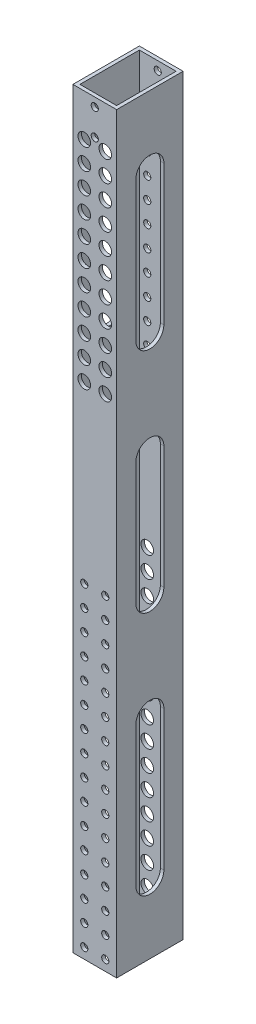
ISO-10303-21;
HEADER;
FILE_DESCRIPTION(('STEP AP214'),'2;1');
FILE_NAME('part.step','',(''),(''),'','','');
FILE_SCHEMA(('AUTOMOTIVE_DESIGN { 1 0 10303 214 1 1 1 1 }'));
ENDSEC;
DATA;
#1=APPLICATION_CONTEXT('core data for automotive mechanical design processes');
#2=APPLICATION_PROTOCOL_DEFINITION('international standard','automotive_design',2000,#1);
#3=PRODUCT_CONTEXT('',#1,'mechanical');
#4=PRODUCT('Part','Part','',(#3));
#5=PRODUCT_RELATED_PRODUCT_CATEGORY('part','',(#4));
#6=PRODUCT_DEFINITION_FORMATION('','',#4);
#7=PRODUCT_DEFINITION_CONTEXT('part definition',#1,'design');
#8=PRODUCT_DEFINITION('design','',#6,#7);
#9=PRODUCT_DEFINITION_SHAPE('','',#8);
#10=(LENGTH_UNIT() NAMED_UNIT(*) SI_UNIT(.MILLI.,.METRE.));
#11=(NAMED_UNIT(*) PLANE_ANGLE_UNIT() SI_UNIT($,.RADIAN.));
#12=(NAMED_UNIT(*) SI_UNIT($,.STERADIAN.) SOLID_ANGLE_UNIT());
#13=UNCERTAINTY_MEASURE_WITH_UNIT(LENGTH_MEASURE(1.E-05),#10,'distance_accuracy_value','');
#14=(GEOMETRIC_REPRESENTATION_CONTEXT(3) GLOBAL_UNCERTAINTY_ASSIGNED_CONTEXT((#13)) GLOBAL_UNIT_ASSIGNED_CONTEXT((#10,
#11,#12)) REPRESENTATION_CONTEXT('',''));
#15=CARTESIAN_POINT('',(0.,0.,0.));
#16=DIRECTION('',(0.,0.,1.));
#17=DIRECTION('',(1.,0.,0.));
#18=AXIS2_PLACEMENT_3D('',#15,#16,#17);
#19=CARTESIAN_POINT('',(12.5,-35.,0.));
#20=DIRECTION('',(-1.,0.,0.));
#21=DIRECTION('',(0.,0.,1.));
#22=AXIS2_PLACEMENT_3D('',#19,#20,#21);
#23=CYLINDRICAL_SURFACE('',#22,8.);
#24=DIRECTION('',(1.,0.,0.));
#25=VECTOR('',#24,1.);
#26=CARTESIAN_POINT('',(-25.5,-35.,-7.99999999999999));
#27=LINE('',#26,#25);
#28=CARTESIAN_POINT('',(-12.5,-35.,-7.99999999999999));
#29=VERTEX_POINT('',#28);
#30=CARTESIAN_POINT('',(-10.5,-35.,-7.99999999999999));
#31=VERTEX_POINT('',#30);
#32=EDGE_CURVE('E579',#29,#31,#27,.T.);
#33=ORIENTED_EDGE('',*,*,#32,.F.);
#34=CARTESIAN_POINT('',(-12.5,-35.,0.));
#35=DIRECTION('',(-1.,0.,0.));
#36=DIRECTION('',(0.,0.,-1.));
#37=AXIS2_PLACEMENT_3D('',#34,#35,#36);
#38=CIRCLE('',#37,8.);
#39=CARTESIAN_POINT('',(-12.5,-35.,8.));
#40=VERTEX_POINT('',#39);
#41=EDGE_CURVE('E600',#29,#40,#38,.T.);
#42=ORIENTED_EDGE('',*,*,#41,.T.);
#43=DIRECTION('',(1.,0.,0.));
#44=VECTOR('',#43,1.);
#45=CARTESIAN_POINT('',(-25.5,-35.,8.));
#46=LINE('',#45,#44);
#47=CARTESIAN_POINT('',(-10.5,-35.,8.00000000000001));
#48=VERTEX_POINT('',#47);
#49=EDGE_CURVE('E581',#40,#48,#46,.T.);
#50=ORIENTED_EDGE('',*,*,#49,.T.);
#51=CARTESIAN_POINT('',(-10.5,-35.,0.));
#52=DIRECTION('',(1.,0.,0.));
#53=DIRECTION('',(0.,0.,-1.));
#54=AXIS2_PLACEMENT_3D('',#51,#52,#53);
#55=CIRCLE('',#54,8.);
#56=EDGE_CURVE('E604',#48,#31,#55,.T.);
#57=ORIENTED_EDGE('',*,*,#56,.T.);
#58=EDGE_LOOP('',(#33,#42,#50,#57));
#59=FACE_BOUND('',#58,.T.);
#60=ADVANCED_FACE('F34',(#59),#23,.F.);
#61=DIRECTION('',(-1.,0.,0.));
#62=VECTOR('',#61,1.);
#63=CARTESIAN_POINT('',(12.5,-35.,-8.));
#64=LINE('',#63,#62);
#65=CARTESIAN_POINT('',(10.5,-35.,-7.99999999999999));
#66=VERTEX_POINT('',#65);
#67=CARTESIAN_POINT('',(12.5,-35.,-7.99999999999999));
#68=VERTEX_POINT('',#67);
#69=EDGE_CURVE('E712',#66,#68,#64,.F.);
#70=ORIENTED_EDGE('',*,*,#69,.F.);
#71=CARTESIAN_POINT('',(10.5,-35.,0.));
#72=DIRECTION('',(-1.,0.,0.));
#73=DIRECTION('',(0.,0.,1.));
#74=AXIS2_PLACEMENT_3D('',#71,#72,#73);
#75=CIRCLE('',#74,8.);
#76=CARTESIAN_POINT('',(10.5,-35.,7.99999999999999));
#77=VERTEX_POINT('',#76);
#78=EDGE_CURVE('E607',#66,#77,#75,.T.);
#79=ORIENTED_EDGE('',*,*,#78,.T.);
#80=DIRECTION('',(-1.,0.,0.));
#81=VECTOR('',#80,1.);
#82=CARTESIAN_POINT('',(12.5,-35.,8.));
#83=LINE('',#82,#81);
#84=CARTESIAN_POINT('',(12.5,-35.,8.00000000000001));
#85=VERTEX_POINT('',#84);
#86=EDGE_CURVE('E701',#77,#85,#83,.F.);
#87=ORIENTED_EDGE('',*,*,#86,.T.);
#88=CARTESIAN_POINT('',(12.5,-35.,0.));
#89=DIRECTION('',(-1.,0.,0.));
#90=DIRECTION('',(0.,0.,-1.));
#91=AXIS2_PLACEMENT_3D('',#88,#89,#90);
#92=CIRCLE('',#91,8.);
#93=EDGE_CURVE('E601',#68,#85,#92,.T.);
#94=ORIENTED_EDGE('',*,*,#93,.F.);
#95=EDGE_LOOP('',(#70,#79,#87,#94));
#96=FACE_BOUND('',#95,.T.);
#97=ADVANCED_FACE('F1128',(#96),#23,.F.);
#98=CARTESIAN_POINT('',(0.,215.,0.));
#99=DIRECTION('',(0.,1.,0.));
#100=DIRECTION('',(0.,0.,1.));
#101=AXIS2_PLACEMENT_3D('',#98,#99,#100);
#102=PLANE('',#101);
#103=DIRECTION('',(0.,0.,-1.));
#104=VECTOR('',#103,1.);
#105=CARTESIAN_POINT('',(12.5,215.,-19.));
#106=LINE('',#105,#104);
#107=CARTESIAN_POINT('',(12.5,215.,19.));
#108=VERTEX_POINT('',#107);
#109=CARTESIAN_POINT('',(12.5,215.,-19.));
#110=VERTEX_POINT('',#109);
#111=EDGE_CURVE('E672',#108,#110,#106,.T.);
#112=ORIENTED_EDGE('',*,*,#111,.T.);
#113=DIRECTION('',(-1.,0.,0.));
#114=VECTOR('',#113,1.);
#115=CARTESIAN_POINT('',(-12.5,215.,-19.));
#116=LINE('',#115,#114);
#117=CARTESIAN_POINT('',(-12.5,215.,-19.));
#118=VERTEX_POINT('',#117);
#119=EDGE_CURVE('E675',#110,#118,#116,.T.);
#120=ORIENTED_EDGE('',*,*,#119,.T.);
#121=DIRECTION('',(0.,0.,1.));
#122=VECTOR('',#121,1.);
#123=CARTESIAN_POINT('',(-12.5,215.,-19.));
#124=LINE('',#123,#122);
#125=CARTESIAN_POINT('',(-12.5,215.,19.));
#126=VERTEX_POINT('',#125);
#127=EDGE_CURVE('E678',#118,#126,#124,.T.);
#128=ORIENTED_EDGE('',*,*,#127,.T.);
#129=DIRECTION('',(1.,0.,0.));
#130=VECTOR('',#129,1.);
#131=CARTESIAN_POINT('',(-12.5,215.,19.));
#132=LINE('',#131,#130);
#133=EDGE_CURVE('E680',#126,#108,#132,.T.);
#134=ORIENTED_EDGE('',*,*,#133,.T.);
#135=EDGE_LOOP('',(#112,#120,#128,#134));
#136=FACE_BOUND('',#135,.T.);
#137=DIRECTION('',(-1.,0.,0.));
#138=VECTOR('',#137,1.);
#139=CARTESIAN_POINT('',(-10.5,215.,-17.));
#140=LINE('',#139,#138);
#141=CARTESIAN_POINT('',(10.5,215.,-17.));
#142=VERTEX_POINT('',#141);
#143=CARTESIAN_POINT('',(-10.5,215.,-17.));
#144=VERTEX_POINT('',#143);
#145=EDGE_CURVE('E643',#142,#144,#140,.T.);
#146=ORIENTED_EDGE('',*,*,#145,.F.);
#147=DIRECTION('',(0.,0.,-1.));
#148=VECTOR('',#147,1.);
#149=CARTESIAN_POINT('',(10.5,215.,-17.));
#150=LINE('',#149,#148);
#151=CARTESIAN_POINT('',(10.5,215.,17.));
#152=VERTEX_POINT('',#151);
#153=EDGE_CURVE('E641',#152,#142,#150,.T.);
#154=ORIENTED_EDGE('',*,*,#153,.F.);
#155=DIRECTION('',(1.,0.,0.));
#156=VECTOR('',#155,1.);
#157=CARTESIAN_POINT('',(-10.5,215.,17.));
#158=LINE('',#157,#156);
#159=CARTESIAN_POINT('',(-10.5,215.,17.));
#160=VERTEX_POINT('',#159);
#161=EDGE_CURVE('E649',#160,#152,#158,.T.);
#162=ORIENTED_EDGE('',*,*,#161,.F.);
#163=DIRECTION('',(0.,0.,1.));
#164=VECTOR('',#163,1.);
#165=CARTESIAN_POINT('',(-10.5,215.,-17.));
#166=LINE('',#165,#164);
#167=EDGE_CURVE('E646',#144,#160,#166,.T.);
#168=ORIENTED_EDGE('',*,*,#167,.F.);
#169=EDGE_LOOP('',(#146,#154,#162,#168));
#170=FACE_BOUND('',#169,.T.);
#171=ADVANCED_FACE('F1134',(#136,#170),#102,.T.);
#172=CARTESIAN_POINT('',(0.,-215.,0.));
#173=DIRECTION('',(0.,1.,0.));
#174=DIRECTION('',(0.,0.,1.));
#175=AXIS2_PLACEMENT_3D('',#172,#173,#174);
#176=PLANE('',#175);
#177=DIRECTION('',(0.,0.,-1.));
#178=VECTOR('',#177,1.);
#179=CARTESIAN_POINT('',(12.5,-215.,-19.));
#180=LINE('',#179,#178);
#181=CARTESIAN_POINT('',(12.5,-215.,19.));
#182=VERTEX_POINT('',#181);
#183=CARTESIAN_POINT('',(12.5,-215.,-19.));
#184=VERTEX_POINT('',#183);
#185=EDGE_CURVE('E671',#182,#184,#180,.T.);
#186=ORIENTED_EDGE('',*,*,#185,.F.);
#187=DIRECTION('',(1.,0.,0.));
#188=VECTOR('',#187,1.);
#189=CARTESIAN_POINT('',(-12.5,-215.,19.));
#190=LINE('',#189,#188);
#191=CARTESIAN_POINT('',(-12.5,-215.,19.));
#192=VERTEX_POINT('',#191);
#193=EDGE_CURVE('E676',#192,#182,#190,.T.);
#194=ORIENTED_EDGE('',*,*,#193,.F.);
#195=DIRECTION('',(0.,0.,1.));
#196=VECTOR('',#195,1.);
#197=CARTESIAN_POINT('',(-12.5,-215.,-19.));
#198=LINE('',#197,#196);
#199=CARTESIAN_POINT('',(-12.5,-215.,-19.));
#200=VERTEX_POINT('',#199);
#201=EDGE_CURVE('E687',#200,#192,#198,.T.);
#202=ORIENTED_EDGE('',*,*,#201,.F.);
#203=DIRECTION('',(-1.,0.,0.));
#204=VECTOR('',#203,1.);
#205=CARTESIAN_POINT('',(-12.5,-215.,-19.));
#206=LINE('',#205,#204);
#207=EDGE_CURVE('E685',#184,#200,#206,.T.);
#208=ORIENTED_EDGE('',*,*,#207,.F.);
#209=EDGE_LOOP('',(#186,#194,#202,#208));
#210=FACE_BOUND('',#209,.T.);
#211=DIRECTION('',(0.,0.,-1.));
#212=VECTOR('',#211,1.);
#213=CARTESIAN_POINT('',(10.5,-215.,-17.));
#214=LINE('',#213,#212);
#215=CARTESIAN_POINT('',(10.5,-215.,17.));
#216=VERTEX_POINT('',#215);
#217=CARTESIAN_POINT('',(10.5,-215.,-17.));
#218=VERTEX_POINT('',#217);
#219=EDGE_CURVE('E640',#216,#218,#214,.T.);
#220=ORIENTED_EDGE('',*,*,#219,.T.);
#221=DIRECTION('',(-1.,0.,0.));
#222=VECTOR('',#221,1.);
#223=CARTESIAN_POINT('',(-10.5,-215.,-17.));
#224=LINE('',#223,#222);
#225=CARTESIAN_POINT('',(-10.5,-215.,-17.));
#226=VERTEX_POINT('',#225);
#227=EDGE_CURVE('E654',#218,#226,#224,.T.);
#228=ORIENTED_EDGE('',*,*,#227,.T.);
#229=DIRECTION('',(0.,0.,1.));
#230=VECTOR('',#229,1.);
#231=CARTESIAN_POINT('',(-10.5,-215.,-17.));
#232=LINE('',#231,#230);
#233=CARTESIAN_POINT('',(-10.5,-215.,17.));
#234=VERTEX_POINT('',#233);
#235=EDGE_CURVE('E657',#226,#234,#232,.T.);
#236=ORIENTED_EDGE('',*,*,#235,.T.);
#237=DIRECTION('',(1.,0.,0.));
#238=VECTOR('',#237,1.);
#239=CARTESIAN_POINT('',(-10.5,-215.,17.));
#240=LINE('',#239,#238);
#241=EDGE_CURVE('E644',#234,#216,#240,.T.);
#242=ORIENTED_EDGE('',*,*,#241,.T.);
#243=EDGE_LOOP('',(#220,#228,#236,#242));
#244=FACE_BOUND('',#243,.T.);
#245=ADVANCED_FACE('F1173',(#210,#244),#176,.F.);
#246=CARTESIAN_POINT('',(12.5,215.,-19.));
#247=DIRECTION('',(-1.,0.,0.));
#248=DIRECTION('',(0.,0.,1.));
#249=AXIS2_PLACEMENT_3D('',#246,#247,#248);
#250=PLANE('',#249);
#251=DIRECTION('',(0.,1.,0.));
#252=VECTOR('',#251,1.);
#253=CARTESIAN_POINT('',(12.5,-175.,-8.00000000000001));
#254=LINE('',#253,#252);
#255=CARTESIAN_POINT('',(12.5,-175.,-8.00000000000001));
#256=VERTEX_POINT('',#255);
#257=CARTESIAN_POINT('',(12.5,-95.,-8.));
#258=VERTEX_POINT('',#257);
#259=EDGE_CURVE('E1088',#256,#258,#254,.T.);
#260=ORIENTED_EDGE('',*,*,#259,.F.);
#261=CARTESIAN_POINT('',(12.5,-175.,0.));
#262=DIRECTION('',(-1.,0.,0.));
#263=DIRECTION('',(0.,0.,1.));
#264=AXIS2_PLACEMENT_3D('',#261,#262,#263);
#265=CIRCLE('',#264,8.00000000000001);
#266=CARTESIAN_POINT('',(12.5,-175.,8.));
#267=VERTEX_POINT('',#266);
#268=EDGE_CURVE('E285',#267,#256,#265,.F.);
#269=ORIENTED_EDGE('',*,*,#268,.F.);
#270=DIRECTION('',(0.,-1.,0.));
#271=VECTOR('',#270,1.);
#272=CARTESIAN_POINT('',(12.5,-175.,8.));
#273=LINE('',#272,#271);
#274=CARTESIAN_POINT('',(12.5,-94.9999999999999,8.00000000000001));
#275=VERTEX_POINT('',#274);
#276=EDGE_CURVE('E282',#275,#267,#273,.T.);
#277=ORIENTED_EDGE('',*,*,#276,.F.);
#278=CARTESIAN_POINT('',(12.5,-95.,0.));
#279=DIRECTION('',(-1.,0.,0.));
#280=DIRECTION('',(0.,0.,1.));
#281=AXIS2_PLACEMENT_3D('',#278,#279,#280);
#282=CIRCLE('',#281,8.00000000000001);
#283=EDGE_CURVE('E275',#258,#275,#282,.F.);
#284=ORIENTED_EDGE('',*,*,#283,.F.);
#285=EDGE_LOOP('',(#260,#269,#277,#284));
#286=FACE_BOUND('',#285,.T.);
#287=DIRECTION('',(0.,-1.,0.));
#288=VECTOR('',#287,1.);
#289=CARTESIAN_POINT('',(12.5,175.,8.));
#290=LINE('',#289,#288);
#291=CARTESIAN_POINT('',(12.5,175.,8.));
#292=VERTEX_POINT('',#291);
#293=CARTESIAN_POINT('',(12.5,95.,8.00000000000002));
#294=VERTEX_POINT('',#293);
#295=EDGE_CURVE('E298',#292,#294,#290,.T.);
#296=ORIENTED_EDGE('',*,*,#295,.F.);
#297=CARTESIAN_POINT('',(12.5,175.,0.));
#298=DIRECTION('',(-1.,0.,0.));
#299=DIRECTION('',(0.,0.,1.));
#300=AXIS2_PLACEMENT_3D('',#297,#298,#299);
#301=CIRCLE('',#300,8.00000000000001);
#302=CARTESIAN_POINT('',(12.5,175.,-8.00000000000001));
#303=VERTEX_POINT('',#302);
#304=EDGE_CURVE('E301',#303,#292,#301,.F.);
#305=ORIENTED_EDGE('',*,*,#304,.F.);
#306=DIRECTION('',(0.,1.,0.));
#307=VECTOR('',#306,1.);
#308=CARTESIAN_POINT('',(12.5,175.,-8.00000000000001));
#309=LINE('',#308,#307);
#310=CARTESIAN_POINT('',(12.5,95.,-8.00000000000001));
#311=VERTEX_POINT('',#310);
#312=EDGE_CURVE('E303',#311,#303,#309,.T.);
#313=ORIENTED_EDGE('',*,*,#312,.F.);
#314=CARTESIAN_POINT('',(12.5,95.,0.));
#315=DIRECTION('',(-1.,0.,0.));
#316=DIRECTION('',(0.,0.,1.));
#317=AXIS2_PLACEMENT_3D('',#314,#315,#316);
#318=CIRCLE('',#317,8.00000000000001);
#319=EDGE_CURVE('E295',#294,#311,#318,.F.);
#320=ORIENTED_EDGE('',*,*,#319,.F.);
#321=EDGE_LOOP('',(#296,#305,#313,#320));
#322=FACE_BOUND('',#321,.T.);
#323=CARTESIAN_POINT('',(12.5,35.,0.));
#324=DIRECTION('',(-1.,0.,0.));
#325=DIRECTION('',(0.,0.,1.));
#326=AXIS2_PLACEMENT_3D('',#323,#324,#325);
#327=CIRCLE('',#326,8.);
#328=CARTESIAN_POINT('',(12.5,35.,8.00000000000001));
#329=VERTEX_POINT('',#328);
#330=CARTESIAN_POINT('',(12.5,35.,-7.99999999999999));
#331=VERTEX_POINT('',#330);
#332=EDGE_CURVE('E611',#329,#331,#327,.T.);
#333=ORIENTED_EDGE('',*,*,#332,.T.);
#334=DIRECTION('',(0.,1.,0.));
#335=VECTOR('',#334,1.);
#336=CARTESIAN_POINT('',(12.5,35.,-7.99999999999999));
#337=LINE('',#336,#335);
#338=EDGE_CURVE('E572',#68,#331,#337,.T.);
#339=ORIENTED_EDGE('',*,*,#338,.F.);
#340=ORIENTED_EDGE('',*,*,#93,.T.);
#341=DIRECTION('',(0.,-1.,0.));
#342=VECTOR('',#341,1.);
#343=CARTESIAN_POINT('',(12.5,35.,8.00000000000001));
#344=LINE('',#343,#342);
#345=EDGE_CURVE('E570',#329,#85,#344,.T.);
#346=ORIENTED_EDGE('',*,*,#345,.F.);
#347=EDGE_LOOP('',(#333,#339,#340,#346));
#348=FACE_BOUND('',#347,.T.);
#349=ORIENTED_EDGE('',*,*,#185,.T.);
#350=DIRECTION('',(0.,-1.,0.));
#351=VECTOR('',#350,1.);
#352=CARTESIAN_POINT('',(12.5,215.,-19.));
#353=LINE('',#352,#351);
#354=EDGE_CURVE('E698',#110,#184,#353,.T.);
#355=ORIENTED_EDGE('',*,*,#354,.F.);
#356=ORIENTED_EDGE('',*,*,#111,.F.);
#357=DIRECTION('',(0.,-1.,0.));
#358=VECTOR('',#357,1.);
#359=CARTESIAN_POINT('',(12.5,215.,19.));
#360=LINE('',#359,#358);
#361=EDGE_CURVE('E682',#108,#182,#360,.T.);
#362=ORIENTED_EDGE('',*,*,#361,.T.);
#363=EDGE_LOOP('',(#349,#355,#356,#362));
#364=FACE_BOUND('',#363,.T.);
#365=ADVANCED_FACE('F36',(#286,#322,#348,#364),#250,.F.);
#366=CARTESIAN_POINT('',(-12.5,215.,-19.));
#367=DIRECTION('',(0.,0.,1.));
#368=DIRECTION('',(1.,0.,0.));
#369=AXIS2_PLACEMENT_3D('',#366,#367,#368);
#370=PLANE('',#369);
#371=CARTESIAN_POINT('',(-6.,-209.,-19.));
#372=DIRECTION('',(0.,0.,1.));
#373=DIRECTION('',(1.,0.,0.));
#374=AXIS2_PLACEMENT_3D('',#371,#372,#373);
#375=CIRCLE('',#374,3.6);
#376=CARTESIAN_POINT('',(-2.4,-209.,-19.));
#377=VERTEX_POINT('',#376);
#378=EDGE_CURVE('E823',#377,#377,#375,.T.);
#379=ORIENTED_EDGE('',*,*,#378,.T.);
#380=EDGE_LOOP('',(#379));
#381=FACE_BOUND('',#380,.T.);
#382=CARTESIAN_POINT('',(5.99999999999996,-197.,-19.));
#383=DIRECTION('',(0.,0.,1.));
#384=DIRECTION('',(1.,0.,0.));
#385=AXIS2_PLACEMENT_3D('',#382,#383,#384);
#386=CIRCLE('',#385,3.6);
#387=CARTESIAN_POINT('',(9.59999999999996,-197.,-19.));
#388=VERTEX_POINT('',#387);
#389=EDGE_CURVE('E944',#388,#388,#386,.T.);
#390=ORIENTED_EDGE('',*,*,#389,.T.);
#391=EDGE_LOOP('',(#390));
#392=FACE_BOUND('',#391,.T.);
#393=CARTESIAN_POINT('',(-6.00000000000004,-197.,-19.));
#394=DIRECTION('',(0.,0.,1.));
#395=DIRECTION('',(1.,0.,0.));
#396=AXIS2_PLACEMENT_3D('',#393,#394,#395);
#397=CIRCLE('',#396,3.6);
#398=CARTESIAN_POINT('',(-2.40000000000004,-197.,-19.));
#399=VERTEX_POINT('',#398);
#400=EDGE_CURVE('E940',#399,#399,#397,.T.);
#401=ORIENTED_EDGE('',*,*,#400,.T.);
#402=EDGE_LOOP('',(#401));
#403=FACE_BOUND('',#402,.T.);
#404=CARTESIAN_POINT('',(5.99999999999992,-185.,-19.));
#405=DIRECTION('',(0.,0.,1.));
#406=DIRECTION('',(1.,0.,0.));
#407=AXIS2_PLACEMENT_3D('',#404,#405,#406);
#408=CIRCLE('',#407,3.6);
#409=CARTESIAN_POINT('',(9.59999999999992,-185.,-19.));
#410=VERTEX_POINT('',#409);
#411=EDGE_CURVE('E936',#410,#410,#408,.T.);
#412=ORIENTED_EDGE('',*,*,#411,.T.);
#413=EDGE_LOOP('',(#412));
#414=FACE_BOUND('',#413,.T.);
#415=CARTESIAN_POINT('',(-6.00000000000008,-185.,-19.));
#416=DIRECTION('',(0.,0.,1.));
#417=DIRECTION('',(1.,0.,0.));
#418=AXIS2_PLACEMENT_3D('',#415,#416,#417);
#419=CIRCLE('',#418,3.6);
#420=CARTESIAN_POINT('',(-2.40000000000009,-185.,-19.));
#421=VERTEX_POINT('',#420);
#422=EDGE_CURVE('E932',#421,#421,#419,.T.);
#423=ORIENTED_EDGE('',*,*,#422,.T.);
#424=EDGE_LOOP('',(#423));
#425=FACE_BOUND('',#424,.T.);
#426=CARTESIAN_POINT('',(5.99999999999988,-173.,-19.));
#427=DIRECTION('',(0.,0.,1.));
#428=DIRECTION('',(1.,0.,0.));
#429=AXIS2_PLACEMENT_3D('',#426,#427,#428);
#430=CIRCLE('',#429,3.6);
#431=CARTESIAN_POINT('',(9.59999999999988,-173.,-19.));
#432=VERTEX_POINT('',#431);
#433=EDGE_CURVE('E928',#432,#432,#430,.T.);
#434=ORIENTED_EDGE('',*,*,#433,.T.);
#435=EDGE_LOOP('',(#434));
#436=FACE_BOUND('',#435,.T.);
#437=CARTESIAN_POINT('',(-6.00000000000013,-173.,-19.));
#438=DIRECTION('',(0.,0.,1.));
#439=DIRECTION('',(1.,0.,0.));
#440=AXIS2_PLACEMENT_3D('',#437,#438,#439);
#441=CIRCLE('',#440,3.6);
#442=CARTESIAN_POINT('',(-2.40000000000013,-173.,-19.));
#443=VERTEX_POINT('',#442);
#444=EDGE_CURVE('E924',#443,#443,#441,.T.);
#445=ORIENTED_EDGE('',*,*,#444,.T.);
#446=EDGE_LOOP('',(#445));
#447=FACE_BOUND('',#446,.T.);
#448=CARTESIAN_POINT('',(5.99999999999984,-161.,-19.));
#449=DIRECTION('',(0.,0.,1.));
#450=DIRECTION('',(1.,0.,0.));
#451=AXIS2_PLACEMENT_3D('',#448,#449,#450);
#452=CIRCLE('',#451,3.6);
#453=CARTESIAN_POINT('',(9.59999999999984,-161.,-19.));
#454=VERTEX_POINT('',#453);
#455=EDGE_CURVE('E920',#454,#454,#452,.T.);
#456=ORIENTED_EDGE('',*,*,#455,.T.);
#457=EDGE_LOOP('',(#456));
#458=FACE_BOUND('',#457,.T.);
#459=CARTESIAN_POINT('',(-6.00000000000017,-161.,-19.));
#460=DIRECTION('',(0.,0.,1.));
#461=DIRECTION('',(1.,0.,0.));
#462=AXIS2_PLACEMENT_3D('',#459,#460,#461);
#463=CIRCLE('',#462,3.6);
#464=CARTESIAN_POINT('',(-2.40000000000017,-161.,-19.));
#465=VERTEX_POINT('',#464);
#466=EDGE_CURVE('E916',#465,#465,#463,.T.);
#467=ORIENTED_EDGE('',*,*,#466,.T.);
#468=EDGE_LOOP('',(#467));
#469=FACE_BOUND('',#468,.T.);
#470=CARTESIAN_POINT('',(5.9999999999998,-149.,-19.));
#471=DIRECTION('',(0.,0.,1.));
#472=DIRECTION('',(1.,0.,0.));
#473=AXIS2_PLACEMENT_3D('',#470,#471,#472);
#474=CIRCLE('',#473,3.6);
#475=CARTESIAN_POINT('',(9.59999999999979,-149.,-19.));
#476=VERTEX_POINT('',#475);
#477=EDGE_CURVE('E912',#476,#476,#474,.T.);
#478=ORIENTED_EDGE('',*,*,#477,.T.);
#479=EDGE_LOOP('',(#478));
#480=FACE_BOUND('',#479,.T.);
#481=CARTESIAN_POINT('',(-6.00000000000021,-149.,-19.));
#482=DIRECTION('',(0.,0.,1.));
#483=DIRECTION('',(1.,0.,0.));
#484=AXIS2_PLACEMENT_3D('',#481,#482,#483);
#485=CIRCLE('',#484,3.6);
#486=CARTESIAN_POINT('',(-2.40000000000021,-149.,-19.));
#487=VERTEX_POINT('',#486);
#488=EDGE_CURVE('E908',#487,#487,#485,.T.);
#489=ORIENTED_EDGE('',*,*,#488,.T.);
#490=EDGE_LOOP('',(#489));
#491=FACE_BOUND('',#490,.T.);
#492=CARTESIAN_POINT('',(5.99999999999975,-137.,-19.));
#493=DIRECTION('',(0.,0.,1.));
#494=DIRECTION('',(1.,0.,0.));
#495=AXIS2_PLACEMENT_3D('',#492,#493,#494);
#496=CIRCLE('',#495,3.6);
#497=CARTESIAN_POINT('',(9.59999999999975,-137.,-19.));
#498=VERTEX_POINT('',#497);
#499=EDGE_CURVE('E904',#498,#498,#496,.T.);
#500=ORIENTED_EDGE('',*,*,#499,.T.);
#501=EDGE_LOOP('',(#500));
#502=FACE_BOUND('',#501,.T.);
#503=CARTESIAN_POINT('',(-6.00000000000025,-137.,-19.));
#504=DIRECTION('',(0.,0.,1.));
#505=DIRECTION('',(1.,0.,0.));
#506=AXIS2_PLACEMENT_3D('',#503,#504,#505);
#507=CIRCLE('',#506,3.6);
#508=CARTESIAN_POINT('',(-2.40000000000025,-137.,-19.));
#509=VERTEX_POINT('',#508);
#510=EDGE_CURVE('E900',#509,#509,#507,.T.);
#511=ORIENTED_EDGE('',*,*,#510,.T.);
#512=EDGE_LOOP('',(#511));
#513=FACE_BOUND('',#512,.T.);
#514=CARTESIAN_POINT('',(5.99999999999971,-125.,-19.));
#515=DIRECTION('',(0.,0.,1.));
#516=DIRECTION('',(1.,0.,0.));
#517=AXIS2_PLACEMENT_3D('',#514,#515,#516);
#518=CIRCLE('',#517,3.6);
#519=CARTESIAN_POINT('',(9.59999999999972,-125.,-19.));
#520=VERTEX_POINT('',#519);
#521=EDGE_CURVE('E896',#520,#520,#518,.T.);
#522=ORIENTED_EDGE('',*,*,#521,.T.);
#523=EDGE_LOOP('',(#522));
#524=FACE_BOUND('',#523,.T.);
#525=CARTESIAN_POINT('',(-6.00000000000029,-125.,-19.));
#526=DIRECTION('',(0.,0.,1.));
#527=DIRECTION('',(1.,0.,0.));
#528=AXIS2_PLACEMENT_3D('',#525,#526,#527);
#529=CIRCLE('',#528,3.6);
#530=CARTESIAN_POINT('',(-2.40000000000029,-125.,-19.));
#531=VERTEX_POINT('',#530);
#532=EDGE_CURVE('E892',#531,#531,#529,.T.);
#533=ORIENTED_EDGE('',*,*,#532,.T.);
#534=EDGE_LOOP('',(#533));
#535=FACE_BOUND('',#534,.T.);
#536=CARTESIAN_POINT('',(5.99999999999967,-113.,-19.));
#537=DIRECTION('',(0.,0.,1.));
#538=DIRECTION('',(1.,0.,0.));
#539=AXIS2_PLACEMENT_3D('',#536,#537,#538);
#540=CIRCLE('',#539,3.6);
#541=CARTESIAN_POINT('',(9.59999999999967,-113.,-19.));
#542=VERTEX_POINT('',#541);
#543=EDGE_CURVE('E888',#542,#542,#540,.T.);
#544=ORIENTED_EDGE('',*,*,#543,.T.);
#545=EDGE_LOOP('',(#544));
#546=FACE_BOUND('',#545,.T.);
#547=CARTESIAN_POINT('',(-6.00000000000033,-113.,-19.));
#548=DIRECTION('',(0.,0.,1.));
#549=DIRECTION('',(1.,0.,0.));
#550=AXIS2_PLACEMENT_3D('',#547,#548,#549);
#551=CIRCLE('',#550,3.6);
#552=CARTESIAN_POINT('',(-2.40000000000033,-113.,-19.));
#553=VERTEX_POINT('',#552);
#554=EDGE_CURVE('E884',#553,#553,#551,.T.);
#555=ORIENTED_EDGE('',*,*,#554,.T.);
#556=EDGE_LOOP('',(#555));
#557=FACE_BOUND('',#556,.T.);
#558=CARTESIAN_POINT('',(5.99999999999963,-101.,-19.));
#559=DIRECTION('',(0.,0.,1.));
#560=DIRECTION('',(1.,0.,0.));
#561=AXIS2_PLACEMENT_3D('',#558,#559,#560);
#562=CIRCLE('',#561,3.6);
#563=CARTESIAN_POINT('',(9.59999999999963,-101.,-19.));
#564=VERTEX_POINT('',#563);
#565=EDGE_CURVE('E880',#564,#564,#562,.T.);
#566=ORIENTED_EDGE('',*,*,#565,.T.);
#567=EDGE_LOOP('',(#566));
#568=FACE_BOUND('',#567,.T.);
#569=CARTESIAN_POINT('',(-6.00000000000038,-101.,-19.));
#570=DIRECTION('',(0.,0.,1.));
#571=DIRECTION('',(1.,0.,0.));
#572=AXIS2_PLACEMENT_3D('',#569,#570,#571);
#573=CIRCLE('',#572,3.6);
#574=CARTESIAN_POINT('',(-2.40000000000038,-101.,-19.));
#575=VERTEX_POINT('',#574);
#576=EDGE_CURVE('E876',#575,#575,#573,.T.);
#577=ORIENTED_EDGE('',*,*,#576,.T.);
#578=EDGE_LOOP('',(#577));
#579=FACE_BOUND('',#578,.T.);
#580=CARTESIAN_POINT('',(5.99999999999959,-89.,-19.));
#581=DIRECTION('',(0.,0.,1.));
#582=DIRECTION('',(1.,0.,0.));
#583=AXIS2_PLACEMENT_3D('',#580,#581,#582);
#584=CIRCLE('',#583,3.6);
#585=CARTESIAN_POINT('',(9.59999999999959,-89.,-19.));
#586=VERTEX_POINT('',#585);
#587=EDGE_CURVE('E872',#586,#586,#584,.T.);
#588=ORIENTED_EDGE('',*,*,#587,.T.);
#589=EDGE_LOOP('',(#588));
#590=FACE_BOUND('',#589,.T.);
#591=CARTESIAN_POINT('',(-6.00000000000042,-89.,-19.));
#592=DIRECTION('',(0.,0.,1.));
#593=DIRECTION('',(1.,0.,0.));
#594=AXIS2_PLACEMENT_3D('',#591,#592,#593);
#595=CIRCLE('',#594,3.6);
#596=CARTESIAN_POINT('',(-2.40000000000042,-89.,-19.));
#597=VERTEX_POINT('',#596);
#598=EDGE_CURVE('E868',#597,#597,#595,.T.);
#599=ORIENTED_EDGE('',*,*,#598,.T.);
#600=EDGE_LOOP('',(#599));
#601=FACE_BOUND('',#600,.T.);
#602=CARTESIAN_POINT('',(5.99999999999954,-77.,-19.));
#603=DIRECTION('',(0.,0.,1.));
#604=DIRECTION('',(1.,0.,0.));
#605=AXIS2_PLACEMENT_3D('',#602,#603,#604);
#606=CIRCLE('',#605,3.6);
#607=CARTESIAN_POINT('',(9.59999999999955,-77.,-19.));
#608=VERTEX_POINT('',#607);
#609=EDGE_CURVE('E864',#608,#608,#606,.T.);
#610=ORIENTED_EDGE('',*,*,#609,.T.);
#611=EDGE_LOOP('',(#610));
#612=FACE_BOUND('',#611,.T.);
#613=CARTESIAN_POINT('',(-6.00000000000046,-77.,-19.));
#614=DIRECTION('',(0.,0.,1.));
#615=DIRECTION('',(1.,0.,0.));
#616=AXIS2_PLACEMENT_3D('',#613,#614,#615);
#617=CIRCLE('',#616,3.6);
#618=CARTESIAN_POINT('',(-2.40000000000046,-77.,-19.));
#619=VERTEX_POINT('',#618);
#620=EDGE_CURVE('E860',#619,#619,#617,.T.);
#621=ORIENTED_EDGE('',*,*,#620,.T.);
#622=EDGE_LOOP('',(#621));
#623=FACE_BOUND('',#622,.T.);
#624=CARTESIAN_POINT('',(5.9999999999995,-65.,-19.));
#625=DIRECTION('',(0.,0.,1.));
#626=DIRECTION('',(1.,0.,0.));
#627=AXIS2_PLACEMENT_3D('',#624,#625,#626);
#628=CIRCLE('',#627,3.6);
#629=CARTESIAN_POINT('',(9.5999999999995,-65.,-19.));
#630=VERTEX_POINT('',#629);
#631=EDGE_CURVE('E856',#630,#630,#628,.T.);
#632=ORIENTED_EDGE('',*,*,#631,.T.);
#633=EDGE_LOOP('',(#632));
#634=FACE_BOUND('',#633,.T.);
#635=CARTESIAN_POINT('',(-6.0000000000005,-65.,-19.));
#636=DIRECTION('',(0.,0.,1.));
#637=DIRECTION('',(1.,0.,0.));
#638=AXIS2_PLACEMENT_3D('',#635,#636,#637);
#639=CIRCLE('',#638,3.6);
#640=CARTESIAN_POINT('',(-2.4000000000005,-65.,-19.));
#641=VERTEX_POINT('',#640);
#642=EDGE_CURVE('E852',#641,#641,#639,.T.);
#643=ORIENTED_EDGE('',*,*,#642,.T.);
#644=EDGE_LOOP('',(#643));
#645=FACE_BOUND('',#644,.T.);
#646=CARTESIAN_POINT('',(5.99999999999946,-53.,-19.));
#647=DIRECTION('',(0.,0.,1.));
#648=DIRECTION('',(1.,0.,0.));
#649=AXIS2_PLACEMENT_3D('',#646,#647,#648);
#650=CIRCLE('',#649,3.6);
#651=CARTESIAN_POINT('',(9.59999999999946,-53.,-19.));
#652=VERTEX_POINT('',#651);
#653=EDGE_CURVE('E848',#652,#652,#650,.T.);
#654=ORIENTED_EDGE('',*,*,#653,.T.);
#655=EDGE_LOOP('',(#654));
#656=FACE_BOUND('',#655,.T.);
#657=CARTESIAN_POINT('',(-6.00000000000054,-53.,-19.));
#658=DIRECTION('',(0.,0.,1.));
#659=DIRECTION('',(1.,0.,0.));
#660=AXIS2_PLACEMENT_3D('',#657,#658,#659);
#661=CIRCLE('',#660,3.6);
#662=CARTESIAN_POINT('',(-2.40000000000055,-53.,-19.));
#663=VERTEX_POINT('',#662);
#664=EDGE_CURVE('E844',#663,#663,#661,.T.);
#665=ORIENTED_EDGE('',*,*,#664,.T.);
#666=EDGE_LOOP('',(#665));
#667=FACE_BOUND('',#666,.T.);
#668=CARTESIAN_POINT('',(5.99999999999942,-41.,-19.));
#669=DIRECTION('',(0.,0.,1.));
#670=DIRECTION('',(1.,0.,0.));
#671=AXIS2_PLACEMENT_3D('',#668,#669,#670);
#672=CIRCLE('',#671,3.6);
#673=CARTESIAN_POINT('',(9.59999999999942,-41.,-19.));
#674=VERTEX_POINT('',#673);
#675=EDGE_CURVE('E840',#674,#674,#672,.T.);
#676=ORIENTED_EDGE('',*,*,#675,.T.);
#677=EDGE_LOOP('',(#676));
#678=FACE_BOUND('',#677,.T.);
#679=CARTESIAN_POINT('',(-6.00000000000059,-41.,-19.));
#680=DIRECTION('',(0.,0.,1.));
#681=DIRECTION('',(1.,0.,0.));
#682=AXIS2_PLACEMENT_3D('',#679,#680,#681);
#683=CIRCLE('',#682,3.6);
#684=CARTESIAN_POINT('',(-2.40000000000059,-41.,-19.));
#685=VERTEX_POINT('',#684);
#686=EDGE_CURVE('E836',#685,#685,#683,.T.);
#687=ORIENTED_EDGE('',*,*,#686,.T.);
#688=EDGE_LOOP('',(#687));
#689=FACE_BOUND('',#688,.T.);
#690=CARTESIAN_POINT('',(5.99999999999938,-29.,-19.));
#691=DIRECTION('',(0.,0.,1.));
#692=DIRECTION('',(1.,0.,0.));
#693=AXIS2_PLACEMENT_3D('',#690,#691,#692);
#694=CIRCLE('',#693,3.6);
#695=CARTESIAN_POINT('',(9.59999999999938,-29.,-19.));
#696=VERTEX_POINT('',#695);
#697=EDGE_CURVE('E832',#696,#696,#694,.T.);
#698=ORIENTED_EDGE('',*,*,#697,.T.);
#699=EDGE_LOOP('',(#698));
#700=FACE_BOUND('',#699,.T.);
#701=CARTESIAN_POINT('',(-6.00000000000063,-29.,-19.));
#702=DIRECTION('',(0.,0.,1.));
#703=DIRECTION('',(1.,0.,0.));
#704=AXIS2_PLACEMENT_3D('',#701,#702,#703);
#705=CIRCLE('',#704,3.6);
#706=CARTESIAN_POINT('',(-2.40000000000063,-29.,-19.));
#707=VERTEX_POINT('',#706);
#708=EDGE_CURVE('E827',#707,#707,#705,.T.);
#709=ORIENTED_EDGE('',*,*,#708,.T.);
#710=EDGE_LOOP('',(#709));
#711=FACE_BOUND('',#710,.T.);
#712=CARTESIAN_POINT('',(6.00000000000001,-209.,-19.));
#713=DIRECTION('',(0.,0.,1.));
#714=DIRECTION('',(1.,0.,0.));
#715=AXIS2_PLACEMENT_3D('',#712,#713,#714);
#716=CIRCLE('',#715,3.6);
#717=CARTESIAN_POINT('',(9.6,-209.,-19.));
#718=VERTEX_POINT('',#717);
#719=EDGE_CURVE('E822',#718,#718,#716,.T.);
#720=ORIENTED_EDGE('',*,*,#719,.T.);
#721=EDGE_LOOP('',(#720));
#722=FACE_BOUND('',#721,.T.);
#723=CARTESIAN_POINT('',(5.99999999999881,131.,-19.));
#724=DIRECTION('',(0.,0.,1.));
#725=DIRECTION('',(1.,0.,0.));
#726=AXIS2_PLACEMENT_3D('',#723,#724,#725);
#727=CIRCLE('',#726,2.05);
#728=CARTESIAN_POINT('',(8.04999999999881,131.,-19.));
#729=VERTEX_POINT('',#728);
#730=EDGE_CURVE('E563',#729,#729,#727,.T.);
#731=ORIENTED_EDGE('',*,*,#730,.T.);
#732=EDGE_LOOP('',(#731));
#733=FACE_BOUND('',#732,.T.);
#734=CARTESIAN_POINT('',(-6.00000000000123,143.,-19.));
#735=DIRECTION('',(0.,0.,1.));
#736=DIRECTION('',(1.,0.,0.));
#737=AXIS2_PLACEMENT_3D('',#734,#735,#736);
#738=CIRCLE('',#737,2.05);
#739=CARTESIAN_POINT('',(-3.95000000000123,143.,-19.));
#740=VERTEX_POINT('',#739);
#741=EDGE_CURVE('E557',#740,#740,#738,.T.);
#742=ORIENTED_EDGE('',*,*,#741,.T.);
#743=EDGE_LOOP('',(#742));
#744=FACE_BOUND('',#743,.T.);
#745=CARTESIAN_POINT('',(5.99999999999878,143.,-19.));
#746=DIRECTION('',(0.,0.,1.));
#747=DIRECTION('',(1.,0.,0.));
#748=AXIS2_PLACEMENT_3D('',#745,#746,#747);
#749=CIRCLE('',#748,2.05);
#750=CARTESIAN_POINT('',(8.04999999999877,143.,-19.));
#751=VERTEX_POINT('',#750);
#752=EDGE_CURVE('E551',#751,#751,#749,.T.);
#753=ORIENTED_EDGE('',*,*,#752,.T.);
#754=EDGE_LOOP('',(#753));
#755=FACE_BOUND('',#754,.T.);
#756=CARTESIAN_POINT('',(-6.00000000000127,155.,-19.));
#757=DIRECTION('',(0.,0.,1.));
#758=DIRECTION('',(1.,0.,0.));
#759=AXIS2_PLACEMENT_3D('',#756,#757,#758);
#760=CIRCLE('',#759,2.05);
#761=CARTESIAN_POINT('',(-3.95000000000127,155.,-19.));
#762=VERTEX_POINT('',#761);
#763=EDGE_CURVE('E545',#762,#762,#760,.T.);
#764=ORIENTED_EDGE('',*,*,#763,.T.);
#765=EDGE_LOOP('',(#764));
#766=FACE_BOUND('',#765,.T.);
#767=CARTESIAN_POINT('',(-6.00000000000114,119.,-19.));
#768=DIRECTION('',(0.,0.,1.));
#769=DIRECTION('',(1.,0.,0.));
#770=AXIS2_PLACEMENT_3D('',#767,#768,#769);
#771=CIRCLE('',#770,2.05);
#772=CARTESIAN_POINT('',(-3.95000000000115,119.,-19.));
#773=VERTEX_POINT('',#772);
#774=EDGE_CURVE('E539',#773,#773,#771,.T.);
#775=ORIENTED_EDGE('',*,*,#774,.T.);
#776=EDGE_LOOP('',(#775));
#777=FACE_BOUND('',#776,.T.);
#778=CARTESIAN_POINT('',(5.99999999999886,119.,-19.));
#779=DIRECTION('',(0.,0.,1.));
#780=DIRECTION('',(1.,0.,0.));
#781=AXIS2_PLACEMENT_3D('',#778,#779,#780);
#782=CIRCLE('',#781,2.05);
#783=CARTESIAN_POINT('',(8.04999999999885,119.,-19.));
#784=VERTEX_POINT('',#783);
#785=EDGE_CURVE('E533',#784,#784,#782,.T.);
#786=ORIENTED_EDGE('',*,*,#785,.T.);
#787=EDGE_LOOP('',(#786));
#788=FACE_BOUND('',#787,.T.);
#789=CARTESIAN_POINT('',(-6.00000000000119,131.,-19.));
#790=DIRECTION('',(0.,0.,1.));
#791=DIRECTION('',(1.,0.,0.));
#792=AXIS2_PLACEMENT_3D('',#789,#790,#791);
#793=CIRCLE('',#792,2.05);
#794=CARTESIAN_POINT('',(-3.95000000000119,131.,-19.));
#795=VERTEX_POINT('',#794);
#796=EDGE_CURVE('E527',#795,#795,#793,.T.);
#797=ORIENTED_EDGE('',*,*,#796,.T.);
#798=EDGE_LOOP('',(#797));
#799=FACE_BOUND('',#798,.T.);
#800=CARTESIAN_POINT('',(5.99999999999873,155.,-19.));
#801=DIRECTION('',(0.,0.,1.));
#802=DIRECTION('',(1.,0.,0.));
#803=AXIS2_PLACEMENT_3D('',#800,#801,#802);
#804=CIRCLE('',#803,2.05);
#805=CARTESIAN_POINT('',(8.04999999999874,155.,-19.));
#806=VERTEX_POINT('',#805);
#807=EDGE_CURVE('E521',#806,#806,#804,.T.);
#808=ORIENTED_EDGE('',*,*,#807,.T.);
#809=EDGE_LOOP('',(#808));
#810=FACE_BOUND('',#809,.T.);
#811=CARTESIAN_POINT('',(-6.00000000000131,167.,-19.));
#812=DIRECTION('',(0.,0.,1.));
#813=DIRECTION('',(1.,0.,0.));
#814=AXIS2_PLACEMENT_3D('',#811,#812,#813);
#815=CIRCLE('',#814,2.05);
#816=CARTESIAN_POINT('',(-3.95000000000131,167.,-19.));
#817=VERTEX_POINT('',#816);
#818=EDGE_CURVE('E515',#817,#817,#815,.T.);
#819=ORIENTED_EDGE('',*,*,#818,.T.);
#820=EDGE_LOOP('',(#819));
#821=FACE_BOUND('',#820,.T.);
#822=CARTESIAN_POINT('',(5.99999999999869,167.,-19.));
#823=DIRECTION('',(0.,0.,1.));
#824=DIRECTION('',(1.,0.,0.));
#825=AXIS2_PLACEMENT_3D('',#822,#823,#824);
#826=CIRCLE('',#825,2.05);
#827=CARTESIAN_POINT('',(8.0499999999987,167.,-19.));
#828=VERTEX_POINT('',#827);
#829=EDGE_CURVE('E509',#828,#828,#826,.T.);
#830=ORIENTED_EDGE('',*,*,#829,.T.);
#831=EDGE_LOOP('',(#830));
#832=FACE_BOUND('',#831,.T.);
#833=CARTESIAN_POINT('',(-6.00000000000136,179.,-19.));
#834=DIRECTION('',(0.,0.,1.));
#835=DIRECTION('',(1.,0.,0.));
#836=AXIS2_PLACEMENT_3D('',#833,#834,#835);
#837=CIRCLE('',#836,2.05);
#838=CARTESIAN_POINT('',(-3.95000000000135,179.,-19.));
#839=VERTEX_POINT('',#838);
#840=EDGE_CURVE('E503',#839,#839,#837,.T.);
#841=ORIENTED_EDGE('',*,*,#840,.T.);
#842=EDGE_LOOP('',(#841));
#843=FACE_BOUND('',#842,.T.);
#844=CARTESIAN_POINT('',(5.99999999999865,179.,-19.));
#845=DIRECTION('',(0.,0.,1.));
#846=DIRECTION('',(1.,0.,0.));
#847=AXIS2_PLACEMENT_3D('',#844,#845,#846);
#848=CIRCLE('',#847,2.05);
#849=CARTESIAN_POINT('',(8.04999999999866,179.,-19.));
#850=VERTEX_POINT('',#849);
#851=EDGE_CURVE('E497',#850,#850,#848,.T.);
#852=ORIENTED_EDGE('',*,*,#851,.T.);
#853=EDGE_LOOP('',(#852));
#854=FACE_BOUND('',#853,.T.);
#855=CARTESIAN_POINT('',(-6.0000000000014,191.,-19.));
#856=DIRECTION('',(0.,0.,1.));
#857=DIRECTION('',(1.,0.,0.));
#858=AXIS2_PLACEMENT_3D('',#855,#856,#857);
#859=CIRCLE('',#858,2.05);
#860=CARTESIAN_POINT('',(-3.95000000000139,191.,-19.));
#861=VERTEX_POINT('',#860);
#862=EDGE_CURVE('E491',#861,#861,#859,.T.);
#863=ORIENTED_EDGE('',*,*,#862,.T.);
#864=EDGE_LOOP('',(#863));
#865=FACE_BOUND('',#864,.T.);
#866=CARTESIAN_POINT('',(5.99999999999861,191.,-19.));
#867=DIRECTION('',(0.,0.,1.));
#868=DIRECTION('',(1.,0.,0.));
#869=AXIS2_PLACEMENT_3D('',#866,#867,#868);
#870=CIRCLE('',#869,2.05);
#871=CARTESIAN_POINT('',(8.04999999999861,191.,-19.));
#872=VERTEX_POINT('',#871);
#873=EDGE_CURVE('E485',#872,#872,#870,.T.);
#874=ORIENTED_EDGE('',*,*,#873,.T.);
#875=EDGE_LOOP('',(#874));
#876=FACE_BOUND('',#875,.T.);
#877=CARTESIAN_POINT('',(-6.00000000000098,71.,-19.));
#878=DIRECTION('',(0.,0.,1.));
#879=DIRECTION('',(1.,0.,0.));
#880=AXIS2_PLACEMENT_3D('',#877,#878,#879);
#881=CIRCLE('',#880,2.05);
#882=CARTESIAN_POINT('',(-3.95000000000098,71.,-19.));
#883=VERTEX_POINT('',#882);
#884=EDGE_CURVE('E478',#883,#883,#881,.T.);
#885=ORIENTED_EDGE('',*,*,#884,.T.);
#886=EDGE_LOOP('',(#885));
#887=FACE_BOUND('',#886,.T.);
#888=CARTESIAN_POINT('',(5.99999999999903,71.,-19.));
#889=DIRECTION('',(0.,0.,1.));
#890=DIRECTION('',(1.,0.,0.));
#891=AXIS2_PLACEMENT_3D('',#888,#889,#890);
#892=CIRCLE('',#891,2.05);
#893=CARTESIAN_POINT('',(8.04999999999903,71.,-19.));
#894=VERTEX_POINT('',#893);
#895=EDGE_CURVE('E472',#894,#894,#892,.T.);
#896=ORIENTED_EDGE('',*,*,#895,.T.);
#897=EDGE_LOOP('',(#896));
#898=FACE_BOUND('',#897,.T.);
#899=CARTESIAN_POINT('',(-6.00000000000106,94.9999999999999,-19.));
#900=DIRECTION('',(0.,0.,1.));
#901=DIRECTION('',(1.,0.,0.));
#902=AXIS2_PLACEMENT_3D('',#899,#900,#901);
#903=CIRCLE('',#902,2.05);
#904=CARTESIAN_POINT('',(-3.95000000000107,94.9999999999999,-19.));
#905=VERTEX_POINT('',#904);
#906=EDGE_CURVE('E466',#905,#905,#903,.T.);
#907=ORIENTED_EDGE('',*,*,#906,.T.);
#908=EDGE_LOOP('',(#907));
#909=FACE_BOUND('',#908,.T.);
#910=CARTESIAN_POINT('',(5.99999999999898,82.9999999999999,-19.));
#911=DIRECTION('',(0.,0.,1.));
#912=DIRECTION('',(1.,0.,0.));
#913=AXIS2_PLACEMENT_3D('',#910,#911,#912);
#914=CIRCLE('',#913,2.05);
#915=CARTESIAN_POINT('',(8.04999999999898,82.9999999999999,-19.));
#916=VERTEX_POINT('',#915);
#917=EDGE_CURVE('E460',#916,#916,#914,.T.);
#918=ORIENTED_EDGE('',*,*,#917,.T.);
#919=EDGE_LOOP('',(#918));
#920=FACE_BOUND('',#919,.T.);
#921=CARTESIAN_POINT('',(-6.00000000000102,82.9999999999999,-19.));
#922=DIRECTION('',(0.,0.,1.));
#923=DIRECTION('',(1.,0.,0.));
#924=AXIS2_PLACEMENT_3D('',#921,#922,#923);
#925=CIRCLE('',#924,2.05);
#926=CARTESIAN_POINT('',(-3.95000000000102,82.9999999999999,-19.));
#927=VERTEX_POINT('',#926);
#928=EDGE_CURVE('E454',#927,#927,#925,.T.);
#929=ORIENTED_EDGE('',*,*,#928,.T.);
#930=EDGE_LOOP('',(#929));
#931=FACE_BOUND('',#930,.T.);
#932=CARTESIAN_POINT('',(5.99999999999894,94.9999999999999,-19.));
#933=DIRECTION('',(0.,0.,1.));
#934=DIRECTION('',(1.,0.,0.));
#935=AXIS2_PLACEMENT_3D('',#932,#933,#934);
#936=CIRCLE('',#935,2.05);
#937=CARTESIAN_POINT('',(8.04999999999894,94.9999999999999,-19.));
#938=VERTEX_POINT('',#937);
#939=EDGE_CURVE('E448',#938,#938,#936,.T.);
#940=ORIENTED_EDGE('',*,*,#939,.T.);
#941=EDGE_LOOP('',(#940));
#942=FACE_BOUND('',#941,.T.);
#943=CARTESIAN_POINT('',(-6.0000000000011,107.,-19.));
#944=DIRECTION('',(0.,0.,1.));
#945=DIRECTION('',(1.,0.,0.));
#946=AXIS2_PLACEMENT_3D('',#943,#944,#945);
#947=CIRCLE('',#946,2.05);
#948=CARTESIAN_POINT('',(-3.95000000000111,107.,-19.));
#949=VERTEX_POINT('',#948);
#950=EDGE_CURVE('E442',#949,#949,#947,.T.);
#951=ORIENTED_EDGE('',*,*,#950,.T.);
#952=EDGE_LOOP('',(#951));
#953=FACE_BOUND('',#952,.T.);
#954=CARTESIAN_POINT('',(5.9999999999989,107.,-19.));
#955=DIRECTION('',(0.,0.,1.));
#956=DIRECTION('',(1.,0.,0.));
#957=AXIS2_PLACEMENT_3D('',#954,#955,#956);
#958=CIRCLE('',#957,2.05);
#959=CARTESIAN_POINT('',(8.04999999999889,107.,-19.));
#960=VERTEX_POINT('',#959);
#961=EDGE_CURVE('E435',#960,#960,#958,.T.);
#962=ORIENTED_EDGE('',*,*,#961,.T.);
#963=EDGE_LOOP('',(#962));
#964=FACE_BOUND('',#963,.T.);
#965=CARTESIAN_POINT('',(0.,195.,-19.));
#966=DIRECTION('',(0.,0.,1.));
#967=DIRECTION('',(1.,0.,0.));
#968=AXIS2_PLACEMENT_3D('',#965,#966,#967);
#969=CIRCLE('',#968,2.05);
#970=CARTESIAN_POINT('',(2.05,195.,-19.));
#971=VERTEX_POINT('',#970);
#972=EDGE_CURVE('E627',#971,#971,#969,.T.);
#973=ORIENTED_EDGE('',*,*,#972,.T.);
#974=EDGE_LOOP('',(#973));
#975=FACE_BOUND('',#974,.T.);
#976=CARTESIAN_POINT('',(0.,210.,-19.));
#977=DIRECTION('',(0.,0.,1.));
#978=DIRECTION('',(1.,0.,0.));
#979=AXIS2_PLACEMENT_3D('',#976,#977,#978);
#980=CIRCLE('',#979,2.05);
#981=CARTESIAN_POINT('',(2.05,210.,-19.));
#982=VERTEX_POINT('',#981);
#983=EDGE_CURVE('E637',#982,#982,#980,.T.);
#984=ORIENTED_EDGE('',*,*,#983,.T.);
#985=EDGE_LOOP('',(#984));
#986=FACE_BOUND('',#985,.T.);
#987=ORIENTED_EDGE('',*,*,#207,.T.);
#988=DIRECTION('',(0.,-1.,0.));
#989=VECTOR('',#988,1.);
#990=CARTESIAN_POINT('',(-12.5,215.,-19.));
#991=LINE('',#990,#989);
#992=EDGE_CURVE('E695',#118,#200,#991,.T.);
#993=ORIENTED_EDGE('',*,*,#992,.F.);
#994=ORIENTED_EDGE('',*,*,#119,.F.);
#995=ORIENTED_EDGE('',*,*,#354,.T.);
#996=EDGE_LOOP('',(#987,#993,#994,#995));
#997=FACE_BOUND('',#996,.T.);
#998=ADVANCED_FACE('F1182',(#381,#392,#403,#414,#425,#436,#447,#458,#469,#480,#491,#502,#513,
#524,#535,#546,#557,#568,#579,#590,#601,#612,#623,#634,#645,#656,#667,#678,#689,#700,#711,#722,
#733,#744,#755,#766,#777,#788,#799,#810,#821,#832,#843,#854,#865,#876,#887,#898,#909,#920,#931,
#942,#953,#964,#975,#986,#997),#370,.F.);
#999=CARTESIAN_POINT('',(-12.5,215.,-19.));
#1000=DIRECTION('',(1.,0.,0.));
#1001=DIRECTION('',(0.,0.,-1.));
#1002=AXIS2_PLACEMENT_3D('',#999,#1000,#1001);
#1003=PLANE('',#1002);
#1004=DIRECTION('',(0.,1.,0.));
#1005=VECTOR('',#1004,1.);
#1006=CARTESIAN_POINT('',(-12.5,-175.,8.00000000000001));
#1007=LINE('',#1006,#1005);
#1008=CARTESIAN_POINT('',(-12.5,-175.,8.00000000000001));
#1009=VERTEX_POINT('',#1008);
#1010=CARTESIAN_POINT('',(-12.5,-95.,8.00000000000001));
#1011=VERTEX_POINT('',#1010);
#1012=EDGE_CURVE('E259',#1009,#1011,#1007,.T.);
#1013=ORIENTED_EDGE('',*,*,#1012,.F.);
#1014=CARTESIAN_POINT('',(-12.5,-175.,0.));
#1015=DIRECTION('',(-1.,0.,0.));
#1016=DIRECTION('',(0.,0.,-1.));
#1017=AXIS2_PLACEMENT_3D('',#1014,#1015,#1016);
#1018=CIRCLE('',#1017,8.00000000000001);
#1019=CARTESIAN_POINT('',(-12.5,-175.,-8.));
#1020=VERTEX_POINT('',#1019);
#1021=EDGE_CURVE('E59',#1020,#1009,#1018,.T.);
#1022=ORIENTED_EDGE('',*,*,#1021,.F.);
#1023=DIRECTION('',(0.,-1.,0.));
#1024=VECTOR('',#1023,1.);
#1025=CARTESIAN_POINT('',(-12.5,-175.,-8.));
#1026=LINE('',#1025,#1024);
#1027=CARTESIAN_POINT('',(-12.5,-95.,-8.));
#1028=VERTEX_POINT('',#1027);
#1029=EDGE_CURVE('E267',#1028,#1020,#1026,.T.);
#1030=ORIENTED_EDGE('',*,*,#1029,.F.);
#1031=CARTESIAN_POINT('',(-12.5,-95.,0.));
#1032=DIRECTION('',(-1.,0.,0.));
#1033=DIRECTION('',(0.,0.,-1.));
#1034=AXIS2_PLACEMENT_3D('',#1031,#1032,#1033);
#1035=CIRCLE('',#1034,8.00000000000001);
#1036=EDGE_CURVE('E250',#1011,#1028,#1035,.T.);
#1037=ORIENTED_EDGE('',*,*,#1036,.F.);
#1038=EDGE_LOOP('',(#1013,#1022,#1030,#1037));
#1039=FACE_BOUND('',#1038,.T.);
#1040=DIRECTION('',(0.,-1.,0.));
#1041=VECTOR('',#1040,1.);
#1042=CARTESIAN_POINT('',(-12.5,175.,-8.));
#1043=LINE('',#1042,#1041);
#1044=CARTESIAN_POINT('',(-12.5,175.,-8.00000000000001));
#1045=VERTEX_POINT('',#1044);
#1046=CARTESIAN_POINT('',(-12.5,95.,-8.));
#1047=VERTEX_POINT('',#1046);
#1048=EDGE_CURVE('E305',#1045,#1047,#1043,.T.);
#1049=ORIENTED_EDGE('',*,*,#1048,.F.);
#1050=CARTESIAN_POINT('',(-12.5,175.,0.));
#1051=DIRECTION('',(-1.,0.,0.));
#1052=DIRECTION('',(0.,0.,1.));
#1053=AXIS2_PLACEMENT_3D('',#1050,#1051,#1052);
#1054=CIRCLE('',#1053,8.00000000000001);
#1055=CARTESIAN_POINT('',(-12.5,175.,8.00000000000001));
#1056=VERTEX_POINT('',#1055);
#1057=EDGE_CURVE('E294',#1056,#1045,#1054,.T.);
#1058=ORIENTED_EDGE('',*,*,#1057,.F.);
#1059=DIRECTION('',(0.,1.,0.));
#1060=VECTOR('',#1059,1.);
#1061=CARTESIAN_POINT('',(-12.5,175.,8.00000000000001));
#1062=LINE('',#1061,#1060);
#1063=CARTESIAN_POINT('',(-12.5,95.,8.00000000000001));
#1064=VERTEX_POINT('',#1063);
#1065=EDGE_CURVE('E311',#1064,#1056,#1062,.T.);
#1066=ORIENTED_EDGE('',*,*,#1065,.F.);
#1067=CARTESIAN_POINT('',(-12.5,95.,0.));
#1068=DIRECTION('',(-1.,0.,0.));
#1069=DIRECTION('',(0.,0.,1.));
#1070=AXIS2_PLACEMENT_3D('',#1067,#1068,#1069);
#1071=CIRCLE('',#1070,8.00000000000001);
#1072=EDGE_CURVE('E308',#1047,#1064,#1071,.T.);
#1073=ORIENTED_EDGE('',*,*,#1072,.F.);
#1074=EDGE_LOOP('',(#1049,#1058,#1066,#1073));
#1075=FACE_BOUND('',#1074,.T.);
#1076=ORIENTED_EDGE('',*,*,#41,.F.);
#1077=DIRECTION('',(0.,1.,0.));
#1078=VECTOR('',#1077,1.);
#1079=CARTESIAN_POINT('',(-12.5,215.,-7.99999999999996));
#1080=LINE('',#1079,#1078);
#1081=CARTESIAN_POINT('',(-12.5,35.,-7.99999999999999));
#1082=VERTEX_POINT('',#1081);
#1083=EDGE_CURVE('E597',#29,#1082,#1080,.T.);
#1084=ORIENTED_EDGE('',*,*,#1083,.T.);
#1085=CARTESIAN_POINT('',(-12.5,35.,0.));
#1086=DIRECTION('',(-1.,0.,0.));
#1087=DIRECTION('',(0.,0.,1.));
#1088=AXIS2_PLACEMENT_3D('',#1085,#1086,#1087);
#1089=CIRCLE('',#1088,8.);
#1090=CARTESIAN_POINT('',(-12.5,35.,8.00000000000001));
#1091=VERTEX_POINT('',#1090);
#1092=EDGE_CURVE('E610',#1091,#1082,#1089,.T.);
#1093=ORIENTED_EDGE('',*,*,#1092,.F.);
#1094=DIRECTION('',(0.,-1.,0.));
#1095=VECTOR('',#1094,1.);
#1096=CARTESIAN_POINT('',(-12.5,215.,8.00000000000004));
#1097=LINE('',#1096,#1095);
#1098=EDGE_CURVE('E590',#1091,#40,#1097,.T.);
#1099=ORIENTED_EDGE('',*,*,#1098,.T.);
#1100=EDGE_LOOP('',(#1076,#1084,#1093,#1099));
#1101=FACE_BOUND('',#1100,.T.);
#1102=ORIENTED_EDGE('',*,*,#201,.T.);
#1103=DIRECTION('',(0.,-1.,0.));
#1104=VECTOR('',#1103,1.);
#1105=CARTESIAN_POINT('',(-12.5,215.,19.));
#1106=LINE('',#1105,#1104);
#1107=EDGE_CURVE('E692',#126,#192,#1106,.T.);
#1108=ORIENTED_EDGE('',*,*,#1107,.F.);
#1109=ORIENTED_EDGE('',*,*,#127,.F.);
#1110=ORIENTED_EDGE('',*,*,#992,.T.);
#1111=EDGE_LOOP('',(#1102,#1108,#1109,#1110));
#1112=FACE_BOUND('',#1111,.T.);
#1113=ADVANCED_FACE('F264',(#1039,#1075,#1101,#1112),#1003,.F.);
#1114=CARTESIAN_POINT('',(-12.5,215.,19.));
#1115=DIRECTION('',(0.,0.,-1.));
#1116=DIRECTION('',(-1.,0.,0.));
#1117=AXIS2_PLACEMENT_3D('',#1114,#1115,#1116);
#1118=PLANE('',#1117);
#1119=CARTESIAN_POINT('',(-6.00000000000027,82.9999999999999,19.));
#1120=DIRECTION('',(0.,0.,1.));
#1121=DIRECTION('',(1.,0.,0.));
#1122=AXIS2_PLACEMENT_3D('',#1119,#1120,#1121);
#1123=CIRCLE('',#1122,3.6);
#1124=CARTESIAN_POINT('',(-2.40000000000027,82.9999999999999,19.));
#1125=VERTEX_POINT('',#1124);
#1126=EDGE_CURVE('E2486',#1125,#1125,#1123,.T.);
#1127=ORIENTED_EDGE('',*,*,#1126,.F.);
#1128=EDGE_LOOP('',(#1127));
#1129=FACE_BOUND('',#1128,.T.);
#1130=CARTESIAN_POINT('',(5.99999999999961,94.9999999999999,19.));
#1131=DIRECTION('',(0.,0.,1.));
#1132=DIRECTION('',(1.,0.,0.));
#1133=AXIS2_PLACEMENT_3D('',#1130,#1131,#1132);
#1134=CIRCLE('',#1133,3.6);
#1135=CARTESIAN_POINT('',(9.59999999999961,94.9999999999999,19.));
#1136=VERTEX_POINT('',#1135);
#1137=EDGE_CURVE('E2487',#1136,#1136,#1134,.T.);
#1138=ORIENTED_EDGE('',*,*,#1137,.F.);
#1139=EDGE_LOOP('',(#1138));
#1140=FACE_BOUND('',#1139,.T.);
#1141=CARTESIAN_POINT('',(-6.00000000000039,94.9999999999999,19.));
#1142=DIRECTION('',(0.,0.,1.));
#1143=DIRECTION('',(1.,0.,0.));
#1144=AXIS2_PLACEMENT_3D('',#1141,#1142,#1143);
#1145=CIRCLE('',#1144,3.6);
#1146=CARTESIAN_POINT('',(-2.40000000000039,94.9999999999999,19.));
#1147=VERTEX_POINT('',#1146);
#1148=EDGE_CURVE('E2491',#1147,#1147,#1145,.T.);
#1149=ORIENTED_EDGE('',*,*,#1148,.F.);
#1150=EDGE_LOOP('',(#1149));
#1151=FACE_BOUND('',#1150,.T.);
#1152=CARTESIAN_POINT('',(5.99999999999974,82.9999999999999,19.));
#1153=DIRECTION('',(0.,0.,1.));
#1154=DIRECTION('',(1.,0.,0.));
#1155=AXIS2_PLACEMENT_3D('',#1152,#1153,#1154);
#1156=CIRCLE('',#1155,3.6);
#1157=CARTESIAN_POINT('',(9.59999999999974,82.9999999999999,19.));
#1158=VERTEX_POINT('',#1157);
#1159=EDGE_CURVE('E2488',#1158,#1158,#1156,.T.);
#1160=ORIENTED_EDGE('',*,*,#1159,.F.);
#1161=EDGE_LOOP('',(#1160));
#1162=FACE_BOUND('',#1161,.T.);
#1163=CARTESIAN_POINT('',(-6.00000000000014,70.9999999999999,19.));
#1164=DIRECTION('',(0.,0.,1.));
#1165=DIRECTION('',(1.,0.,0.));
#1166=AXIS2_PLACEMENT_3D('',#1163,#1164,#1165);
#1167=CIRCLE('',#1166,3.6);
#1168=CARTESIAN_POINT('',(-2.40000000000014,70.9999999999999,19.));
#1169=VERTEX_POINT('',#1168);
#1170=EDGE_CURVE('E2494',#1169,#1169,#1167,.T.);
#1171=ORIENTED_EDGE('',*,*,#1170,.F.);
#1172=EDGE_LOOP('',(#1171));
#1173=FACE_BOUND('',#1172,.T.);
#1174=CARTESIAN_POINT('',(5.99999999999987,70.9999999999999,19.));
#1175=DIRECTION('',(0.,0.,1.));
#1176=DIRECTION('',(1.,0.,0.));
#1177=AXIS2_PLACEMENT_3D('',#1174,#1175,#1176);
#1178=CIRCLE('',#1177,3.6);
#1179=CARTESIAN_POINT('',(9.59999999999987,70.9999999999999,19.));
#1180=VERTEX_POINT('',#1179);
#1181=EDGE_CURVE('E2540',#1180,#1180,#1178,.T.);
#1182=ORIENTED_EDGE('',*,*,#1181,.F.);
#1183=EDGE_LOOP('',(#1182));
#1184=FACE_BOUND('',#1183,.T.);
#1185=CARTESIAN_POINT('',(5.99999999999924,131.,19.));
#1186=DIRECTION('',(0.,0.,1.));
#1187=DIRECTION('',(1.,0.,0.));
#1188=AXIS2_PLACEMENT_3D('',#1185,#1186,#1187);
#1189=CIRCLE('',#1188,3.6);
#1190=CARTESIAN_POINT('',(9.59999999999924,131.,19.));
#1191=VERTEX_POINT('',#1190);
#1192=EDGE_CURVE('E2525',#1191,#1191,#1189,.T.);
#1193=ORIENTED_EDGE('',*,*,#1192,.F.);
#1194=EDGE_LOOP('',(#1193));
#1195=FACE_BOUND('',#1194,.T.);
#1196=CARTESIAN_POINT('',(-6.00000000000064,119.,19.));
#1197=DIRECTION('',(0.,0.,1.));
#1198=DIRECTION('',(1.,0.,0.));
#1199=AXIS2_PLACEMENT_3D('',#1196,#1197,#1198);
#1200=CIRCLE('',#1199,3.6);
#1201=CARTESIAN_POINT('',(-2.40000000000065,119.,19.));
#1202=VERTEX_POINT('',#1201);
#1203=EDGE_CURVE('E2529',#1202,#1202,#1200,.T.);
#1204=ORIENTED_EDGE('',*,*,#1203,.F.);
#1205=EDGE_LOOP('',(#1204));
#1206=FACE_BOUND('',#1205,.T.);
#1207=CARTESIAN_POINT('',(5.99999999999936,119.,19.));
#1208=DIRECTION('',(0.,0.,1.));
#1209=DIRECTION('',(1.,0.,0.));
#1210=AXIS2_PLACEMENT_3D('',#1207,#1208,#1209);
#1211=CIRCLE('',#1210,3.6);
#1212=CARTESIAN_POINT('',(9.59999999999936,119.,19.));
#1213=VERTEX_POINT('',#1212);
#1214=EDGE_CURVE('E2534',#1213,#1213,#1211,.T.);
#1215=ORIENTED_EDGE('',*,*,#1214,.F.);
#1216=EDGE_LOOP('',(#1215));
#1217=FACE_BOUND('',#1216,.T.);
#1218=CARTESIAN_POINT('',(-6.00000000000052,107.,19.));
#1219=DIRECTION('',(0.,0.,1.));
#1220=DIRECTION('',(1.,0.,0.));
#1221=AXIS2_PLACEMENT_3D('',#1218,#1219,#1220);
#1222=CIRCLE('',#1221,3.6);
#1223=CARTESIAN_POINT('',(-2.40000000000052,107.,19.));
#1224=VERTEX_POINT('',#1223);
#1225=EDGE_CURVE('E2555',#1224,#1224,#1222,.T.);
#1226=ORIENTED_EDGE('',*,*,#1225,.F.);
#1227=EDGE_LOOP('',(#1226));
#1228=FACE_BOUND('',#1227,.T.);
#1229=CARTESIAN_POINT('',(5.99999999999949,107.,19.));
#1230=DIRECTION('',(0.,0.,1.));
#1231=DIRECTION('',(1.,0.,0.));
#1232=AXIS2_PLACEMENT_3D('',#1229,#1230,#1231);
#1233=CIRCLE('',#1232,3.6);
#1234=CARTESIAN_POINT('',(9.59999999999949,107.,19.));
#1235=VERTEX_POINT('',#1234);
#1236=EDGE_CURVE('E2500',#1235,#1235,#1233,.T.);
#1237=ORIENTED_EDGE('',*,*,#1236,.F.);
#1238=EDGE_LOOP('',(#1237));
#1239=FACE_BOUND('',#1238,.T.);
#1240=CARTESIAN_POINT('',(-6.00000000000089,143.,19.));
#1241=DIRECTION('',(0.,0.,1.));
#1242=DIRECTION('',(1.,0.,0.));
#1243=AXIS2_PLACEMENT_3D('',#1240,#1241,#1242);
#1244=CIRCLE('',#1243,3.6);
#1245=CARTESIAN_POINT('',(-2.4000000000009,143.,19.));
#1246=VERTEX_POINT('',#1245);
#1247=EDGE_CURVE('E1021',#1246,#1246,#1244,.T.);
#1248=ORIENTED_EDGE('',*,*,#1247,.F.);
#1249=EDGE_LOOP('',(#1248));
#1250=FACE_BOUND('',#1249,.T.);
#1251=CARTESIAN_POINT('',(5.99999999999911,143.,19.));
#1252=DIRECTION('',(0.,0.,1.));
#1253=DIRECTION('',(1.,0.,0.));
#1254=AXIS2_PLACEMENT_3D('',#1251,#1252,#1253);
#1255=CIRCLE('',#1254,3.6);
#1256=CARTESIAN_POINT('',(9.59999999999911,143.,19.));
#1257=VERTEX_POINT('',#1256);
#1258=EDGE_CURVE('E2521',#1257,#1257,#1255,.T.);
#1259=ORIENTED_EDGE('',*,*,#1258,.F.);
#1260=EDGE_LOOP('',(#1259));
#1261=FACE_BOUND('',#1260,.T.);
#1262=CARTESIAN_POINT('',(-6.00000000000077,131.,19.));
#1263=DIRECTION('',(0.,0.,1.));
#1264=DIRECTION('',(1.,0.,0.));
#1265=AXIS2_PLACEMENT_3D('',#1262,#1263,#1264);
#1266=CIRCLE('',#1265,3.6);
#1267=CARTESIAN_POINT('',(-2.40000000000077,131.,19.));
#1268=VERTEX_POINT('',#1267);
#1269=EDGE_CURVE('E2523',#1268,#1268,#1266,.T.);
#1270=ORIENTED_EDGE('',*,*,#1269,.F.);
#1271=EDGE_LOOP('',(#1270));
#1272=FACE_BOUND('',#1271,.T.);
#1273=CARTESIAN_POINT('',(5.99999999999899,155.,19.));
#1274=DIRECTION('',(0.,0.,1.));
#1275=DIRECTION('',(1.,0.,0.));
#1276=AXIS2_PLACEMENT_3D('',#1273,#1274,#1275);
#1277=CIRCLE('',#1276,3.6);
#1278=CARTESIAN_POINT('',(9.59999999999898,155.,19.));
#1279=VERTEX_POINT('',#1278);
#1280=EDGE_CURVE('E2518',#1279,#1279,#1277,.T.);
#1281=ORIENTED_EDGE('',*,*,#1280,.F.);
#1282=EDGE_LOOP('',(#1281));
#1283=FACE_BOUND('',#1282,.T.);
#1284=CARTESIAN_POINT('',(-6.00000000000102,155.,19.));
#1285=DIRECTION('',(0.,0.,1.));
#1286=DIRECTION('',(1.,0.,0.));
#1287=AXIS2_PLACEMENT_3D('',#1284,#1285,#1286);
#1288=CIRCLE('',#1287,3.6);
#1289=CARTESIAN_POINT('',(-2.40000000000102,155.,19.));
#1290=VERTEX_POINT('',#1289);
#1291=EDGE_CURVE('E2511',#1290,#1290,#1288,.T.);
#1292=ORIENTED_EDGE('',*,*,#1291,.F.);
#1293=EDGE_LOOP('',(#1292));
#1294=FACE_BOUND('',#1293,.T.);
#1295=CARTESIAN_POINT('',(5.99999999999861,191.,19.));
#1296=DIRECTION('',(0.,0.,1.));
#1297=DIRECTION('',(1.,0.,0.));
#1298=AXIS2_PLACEMENT_3D('',#1295,#1296,#1297);
#1299=CIRCLE('',#1298,3.6);
#1300=CARTESIAN_POINT('',(9.59999999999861,191.,19.));
#1301=VERTEX_POINT('',#1300);
#1302=EDGE_CURVE('E955',#1301,#1301,#1299,.T.);
#1303=ORIENTED_EDGE('',*,*,#1302,.F.);
#1304=EDGE_LOOP('',(#1303));
#1305=FACE_BOUND('',#1304,.T.);
#1306=CARTESIAN_POINT('',(-6.00000000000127,179.,19.));
#1307=DIRECTION('',(0.,0.,1.));
#1308=DIRECTION('',(1.,0.,0.));
#1309=AXIS2_PLACEMENT_3D('',#1306,#1307,#1308);
#1310=CIRCLE('',#1309,3.6);
#1311=CARTESIAN_POINT('',(-2.40000000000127,179.,19.));
#1312=VERTEX_POINT('',#1311);
#1313=EDGE_CURVE('E2504',#1312,#1312,#1310,.T.);
#1314=ORIENTED_EDGE('',*,*,#1313,.F.);
#1315=EDGE_LOOP('',(#1314));
#1316=FACE_BOUND('',#1315,.T.);
#1317=CARTESIAN_POINT('',(5.99999999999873,179.,19.));
#1318=DIRECTION('',(0.,0.,1.));
#1319=DIRECTION('',(1.,0.,0.));
#1320=AXIS2_PLACEMENT_3D('',#1317,#1318,#1319);
#1321=CIRCLE('',#1320,3.6);
#1322=CARTESIAN_POINT('',(9.59999999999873,179.,19.));
#1323=VERTEX_POINT('',#1322);
#1324=EDGE_CURVE('E2501',#1323,#1323,#1321,.T.);
#1325=ORIENTED_EDGE('',*,*,#1324,.F.);
#1326=EDGE_LOOP('',(#1325));
#1327=FACE_BOUND('',#1326,.T.);
#1328=CARTESIAN_POINT('',(-6.00000000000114,167.,19.));
#1329=DIRECTION('',(0.,0.,1.));
#1330=DIRECTION('',(1.,0.,0.));
#1331=AXIS2_PLACEMENT_3D('',#1328,#1329,#1330);
#1332=CIRCLE('',#1331,3.6);
#1333=CARTESIAN_POINT('',(-2.40000000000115,167.,19.));
#1334=VERTEX_POINT('',#1333);
#1335=EDGE_CURVE('E2505',#1334,#1334,#1332,.T.);
#1336=ORIENTED_EDGE('',*,*,#1335,.F.);
#1337=EDGE_LOOP('',(#1336));
#1338=FACE_BOUND('',#1337,.T.);
#1339=CARTESIAN_POINT('',(5.99999999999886,167.,19.));
#1340=DIRECTION('',(0.,0.,1.));
#1341=DIRECTION('',(1.,0.,0.));
#1342=AXIS2_PLACEMENT_3D('',#1339,#1340,#1341);
#1343=CIRCLE('',#1342,3.6);
#1344=CARTESIAN_POINT('',(9.59999999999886,167.,19.));
#1345=VERTEX_POINT('',#1344);
#1346=EDGE_CURVE('E2508',#1345,#1345,#1343,.T.);
#1347=ORIENTED_EDGE('',*,*,#1346,.F.);
#1348=EDGE_LOOP('',(#1347));
#1349=FACE_BOUND('',#1348,.T.);
#1350=CARTESIAN_POINT('',(-6.0000000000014,191.,19.));
#1351=DIRECTION('',(0.,0.,1.));
#1352=DIRECTION('',(1.,0.,0.));
#1353=AXIS2_PLACEMENT_3D('',#1350,#1351,#1352);
#1354=CIRCLE('',#1353,3.6);
#1355=CARTESIAN_POINT('',(-2.4000000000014,191.,19.));
#1356=VERTEX_POINT('',#1355);
#1357=EDGE_CURVE('E950',#1356,#1356,#1354,.T.);
#1358=ORIENTED_EDGE('',*,*,#1357,.F.);
#1359=EDGE_LOOP('',(#1358));
#1360=FACE_BOUND('',#1359,.T.);
#1361=CARTESIAN_POINT('',(5.99999999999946,-53.0000000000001,19.));
#1362=DIRECTION('',(0.,0.,1.));
#1363=DIRECTION('',(-1.,0.,0.));
#1364=AXIS2_PLACEMENT_3D('',#1361,#1362,#1363);
#1365=CIRCLE('',#1364,2.05);
#1366=CARTESIAN_POINT('',(3.94999999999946,-53.0000000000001,19.));
#1367=VERTEX_POINT('',#1366);
#1368=EDGE_CURVE('E342',#1367,#1367,#1365,.T.);
#1369=ORIENTED_EDGE('',*,*,#1368,.F.);
#1370=EDGE_LOOP('',(#1369));
#1371=FACE_BOUND('',#1370,.T.);
#1372=CARTESIAN_POINT('',(-6.00000000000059,-41.0000000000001,19.));
#1373=DIRECTION('',(0.,0.,1.));
#1374=DIRECTION('',(1.,0.,0.));
#1375=AXIS2_PLACEMENT_3D('',#1372,#1373,#1374);
#1376=CIRCLE('',#1375,2.05);
#1377=CARTESIAN_POINT('',(-3.95000000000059,-41.0000000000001,19.));
#1378=VERTEX_POINT('',#1377);
#1379=EDGE_CURVE('E339',#1378,#1378,#1376,.T.);
#1380=ORIENTED_EDGE('',*,*,#1379,.F.);
#1381=EDGE_LOOP('',(#1380));
#1382=FACE_BOUND('',#1381,.T.);
#1383=CARTESIAN_POINT('',(5.99999999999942,-41.0000000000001,19.));
#1384=DIRECTION('',(0.,0.,1.));
#1385=DIRECTION('',(-1.,0.,0.));
#1386=AXIS2_PLACEMENT_3D('',#1383,#1384,#1385);
#1387=CIRCLE('',#1386,2.05);
#1388=CARTESIAN_POINT('',(3.94999999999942,-41.0000000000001,19.));
#1389=VERTEX_POINT('',#1388);
#1390=EDGE_CURVE('E343',#1389,#1389,#1387,.T.);
#1391=ORIENTED_EDGE('',*,*,#1390,.F.);
#1392=EDGE_LOOP('',(#1391));
#1393=FACE_BOUND('',#1392,.T.);
#1394=CARTESIAN_POINT('',(-6.00000000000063,-29.0000000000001,19.));
#1395=DIRECTION('',(0.,0.,1.));
#1396=DIRECTION('',(1.,0.,0.));
#1397=AXIS2_PLACEMENT_3D('',#1394,#1395,#1396);
#1398=CIRCLE('',#1397,2.05);
#1399=CARTESIAN_POINT('',(-3.95000000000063,-29.0000000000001,19.));
#1400=VERTEX_POINT('',#1399);
#1401=EDGE_CURVE('E346',#1400,#1400,#1398,.T.);
#1402=ORIENTED_EDGE('',*,*,#1401,.F.);
#1403=EDGE_LOOP('',(#1402));
#1404=FACE_BOUND('',#1403,.T.);
#1405=CARTESIAN_POINT('',(5.99999999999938,-29.0000000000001,19.));
#1406=DIRECTION('',(0.,0.,1.));
#1407=DIRECTION('',(-1.,0.,0.));
#1408=AXIS2_PLACEMENT_3D('',#1405,#1406,#1407);
#1409=CIRCLE('',#1408,2.05);
#1410=CARTESIAN_POINT('',(3.94999999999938,-29.0000000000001,19.));
#1411=VERTEX_POINT('',#1410);
#1412=EDGE_CURVE('E338',#1411,#1411,#1409,.T.);
#1413=ORIENTED_EDGE('',*,*,#1412,.F.);
#1414=EDGE_LOOP('',(#1413));
#1415=FACE_BOUND('',#1414,.T.);
#1416=CARTESIAN_POINT('',(-6.00000000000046,-77.0000000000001,19.));
#1417=DIRECTION('',(0.,0.,1.));
#1418=DIRECTION('',(1.,0.,0.));
#1419=AXIS2_PLACEMENT_3D('',#1416,#1417,#1418);
#1420=CIRCLE('',#1419,2.05);
#1421=CARTESIAN_POINT('',(-3.95000000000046,-77.0000000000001,19.));
#1422=VERTEX_POINT('',#1421);
#1423=EDGE_CURVE('E422',#1422,#1422,#1420,.T.);
#1424=ORIENTED_EDGE('',*,*,#1423,.F.);
#1425=EDGE_LOOP('',(#1424));
#1426=FACE_BOUND('',#1425,.T.);
#1427=CARTESIAN_POINT('',(5.99999999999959,-89.0000000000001,19.));
#1428=DIRECTION('',(0.,0.,1.));
#1429=DIRECTION('',(-1.,0.,0.));
#1430=AXIS2_PLACEMENT_3D('',#1427,#1428,#1429);
#1431=CIRCLE('',#1430,2.05);
#1432=CARTESIAN_POINT('',(3.94999999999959,-89.0000000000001,19.));
#1433=VERTEX_POINT('',#1432);
#1434=EDGE_CURVE('E425',#1433,#1433,#1431,.T.);
#1435=ORIENTED_EDGE('',*,*,#1434,.F.);
#1436=EDGE_LOOP('',(#1435));
#1437=FACE_BOUND('',#1436,.T.);
#1438=CARTESIAN_POINT('',(-6.00000000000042,-89.0000000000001,19.));
#1439=DIRECTION('',(0.,0.,1.));
#1440=DIRECTION('',(1.,0.,0.));
#1441=AXIS2_PLACEMENT_3D('',#1438,#1439,#1440);
#1442=CIRCLE('',#1441,2.05);
#1443=CARTESIAN_POINT('',(-3.95000000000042,-89.0000000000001,19.));
#1444=VERTEX_POINT('',#1443);
#1445=EDGE_CURVE('E405',#1444,#1444,#1442,.T.);
#1446=ORIENTED_EDGE('',*,*,#1445,.F.);
#1447=EDGE_LOOP('',(#1446));
#1448=FACE_BOUND('',#1447,.T.);
#1449=CARTESIAN_POINT('',(-6.00000000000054,-53.0000000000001,19.));
#1450=DIRECTION('',(0.,0.,1.));
#1451=DIRECTION('',(1.,0.,0.));
#1452=AXIS2_PLACEMENT_3D('',#1449,#1450,#1451);
#1453=CIRCLE('',#1452,2.05);
#1454=CARTESIAN_POINT('',(-3.95000000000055,-53.0000000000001,19.));
#1455=VERTEX_POINT('',#1454);
#1456=EDGE_CURVE('E353',#1455,#1455,#1453,.T.);
#1457=ORIENTED_EDGE('',*,*,#1456,.F.);
#1458=EDGE_LOOP('',(#1457));
#1459=FACE_BOUND('',#1458,.T.);
#1460=CARTESIAN_POINT('',(5.9999999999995,-65.0000000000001,19.));
#1461=DIRECTION('',(0.,0.,1.));
#1462=DIRECTION('',(-1.,0.,0.));
#1463=AXIS2_PLACEMENT_3D('',#1460,#1461,#1462);
#1464=CIRCLE('',#1463,2.05);
#1465=CARTESIAN_POINT('',(3.94999999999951,-65.0000000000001,19.));
#1466=VERTEX_POINT('',#1465);
#1467=EDGE_CURVE('E413',#1466,#1466,#1464,.T.);
#1468=ORIENTED_EDGE('',*,*,#1467,.F.);
#1469=EDGE_LOOP('',(#1468));
#1470=FACE_BOUND('',#1469,.T.);
#1471=CARTESIAN_POINT('',(-6.0000000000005,-65.0000000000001,19.));
#1472=DIRECTION('',(0.,0.,1.));
#1473=DIRECTION('',(1.,0.,0.));
#1474=AXIS2_PLACEMENT_3D('',#1471,#1472,#1473);
#1475=CIRCLE('',#1474,2.05);
#1476=CARTESIAN_POINT('',(-3.95000000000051,-65.0000000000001,19.));
#1477=VERTEX_POINT('',#1476);
#1478=EDGE_CURVE('E416',#1477,#1477,#1475,.T.);
#1479=ORIENTED_EDGE('',*,*,#1478,.F.);
#1480=EDGE_LOOP('',(#1479));
#1481=FACE_BOUND('',#1480,.T.);
#1482=CARTESIAN_POINT('',(5.99999999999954,-77.0000000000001,19.));
#1483=DIRECTION('',(0.,0.,1.));
#1484=DIRECTION('',(-1.,0.,0.));
#1485=AXIS2_PLACEMENT_3D('',#1482,#1483,#1484);
#1486=CIRCLE('',#1485,2.05);
#1487=CARTESIAN_POINT('',(3.94999999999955,-77.0000000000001,19.));
#1488=VERTEX_POINT('',#1487);
#1489=EDGE_CURVE('E419',#1488,#1488,#1486,.T.);
#1490=ORIENTED_EDGE('',*,*,#1489,.F.);
#1491=EDGE_LOOP('',(#1490));
#1492=FACE_BOUND('',#1491,.T.);
#1493=CARTESIAN_POINT('',(-6.00000000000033,-113.,19.));
#1494=DIRECTION('',(0.,0.,1.));
#1495=DIRECTION('',(1.,0.,0.));
#1496=AXIS2_PLACEMENT_3D('',#1493,#1494,#1495);
#1497=CIRCLE('',#1496,2.05);
#1498=CARTESIAN_POINT('',(-3.95000000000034,-113.,19.));
#1499=VERTEX_POINT('',#1498);
#1500=EDGE_CURVE('E398',#1499,#1499,#1497,.T.);
#1501=ORIENTED_EDGE('',*,*,#1500,.F.);
#1502=EDGE_LOOP('',(#1501));
#1503=FACE_BOUND('',#1502,.T.);
#1504=CARTESIAN_POINT('',(5.99999999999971,-125.,19.));
#1505=DIRECTION('',(0.,0.,1.));
#1506=DIRECTION('',(-1.,0.,0.));
#1507=AXIS2_PLACEMENT_3D('',#1504,#1505,#1506);
#1508=CIRCLE('',#1507,2.04999999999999);
#1509=CARTESIAN_POINT('',(3.94999999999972,-125.,19.));
#1510=VERTEX_POINT('',#1509);
#1511=EDGE_CURVE('E406',#1510,#1510,#1508,.T.);
#1512=ORIENTED_EDGE('',*,*,#1511,.F.);
#1513=EDGE_LOOP('',(#1512));
#1514=FACE_BOUND('',#1513,.T.);
#1515=CARTESIAN_POINT('',(-6.00000000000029,-125.,19.));
#1516=DIRECTION('',(0.,0.,1.));
#1517=DIRECTION('',(1.,0.,0.));
#1518=AXIS2_PLACEMENT_3D('',#1515,#1516,#1517);
#1519=CIRCLE('',#1518,2.04999999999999);
#1520=CARTESIAN_POINT('',(-3.9500000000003,-125.,19.));
#1521=VERTEX_POINT('',#1520);
#1522=EDGE_CURVE('E376',#1521,#1521,#1519,.T.);
#1523=ORIENTED_EDGE('',*,*,#1522,.F.);
#1524=EDGE_LOOP('',(#1523));
#1525=FACE_BOUND('',#1524,.T.);
#1526=CARTESIAN_POINT('',(5.99999999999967,-113.,19.));
#1527=DIRECTION('',(0.,0.,1.));
#1528=DIRECTION('',(-1.,0.,0.));
#1529=AXIS2_PLACEMENT_3D('',#1526,#1527,#1528);
#1530=CIRCLE('',#1529,2.05);
#1531=CARTESIAN_POINT('',(3.94999999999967,-113.,19.));
#1532=VERTEX_POINT('',#1531);
#1533=EDGE_CURVE('E395',#1532,#1532,#1530,.T.);
#1534=ORIENTED_EDGE('',*,*,#1533,.F.);
#1535=EDGE_LOOP('',(#1534));
#1536=FACE_BOUND('',#1535,.T.);
#1537=CARTESIAN_POINT('',(-6.00000000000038,-101.,19.));
#1538=DIRECTION('',(0.,0.,1.));
#1539=DIRECTION('',(1.,0.,0.));
#1540=AXIS2_PLACEMENT_3D('',#1537,#1538,#1539);
#1541=CIRCLE('',#1540,2.05);
#1542=CARTESIAN_POINT('',(-3.95000000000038,-101.,19.));
#1543=VERTEX_POINT('',#1542);
#1544=EDGE_CURVE('E399',#1543,#1543,#1541,.T.);
#1545=ORIENTED_EDGE('',*,*,#1544,.F.);
#1546=EDGE_LOOP('',(#1545));
#1547=FACE_BOUND('',#1546,.T.);
#1548=CARTESIAN_POINT('',(5.99999999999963,-101.,19.));
#1549=DIRECTION('',(0.,0.,1.));
#1550=DIRECTION('',(-1.,0.,0.));
#1551=AXIS2_PLACEMENT_3D('',#1548,#1549,#1550);
#1552=CIRCLE('',#1551,2.05);
#1553=CARTESIAN_POINT('',(3.94999999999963,-101.,19.));
#1554=VERTEX_POINT('',#1553);
#1555=EDGE_CURVE('E402',#1554,#1554,#1552,.T.);
#1556=ORIENTED_EDGE('',*,*,#1555,.F.);
#1557=EDGE_LOOP('',(#1556));
#1558=FACE_BOUND('',#1557,.T.);
#1559=CARTESIAN_POINT('',(6.00000000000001,-209.,19.));
#1560=DIRECTION('',(0.,0.,1.));
#1561=DIRECTION('',(-1.,0.,0.));
#1562=AXIS2_PLACEMENT_3D('',#1559,#1560,#1561);
#1563=CIRCLE('',#1562,2.05);
#1564=CARTESIAN_POINT('',(3.95000000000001,-209.,19.));
#1565=VERTEX_POINT('',#1564);
#1566=EDGE_CURVE('E377',#1565,#1565,#1563,.T.);
#1567=ORIENTED_EDGE('',*,*,#1566,.F.);
#1568=EDGE_LOOP('',(#1567));
#1569=FACE_BOUND('',#1568,.T.);
#1570=CARTESIAN_POINT('',(-6.00000000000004,-197.,19.));
#1571=DIRECTION('',(0.,0.,1.));
#1572=DIRECTION('',(1.,0.,0.));
#1573=AXIS2_PLACEMENT_3D('',#1570,#1571,#1572);
#1574=CIRCLE('',#1573,2.05);
#1575=CARTESIAN_POINT('',(-3.95000000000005,-197.,19.));
#1576=VERTEX_POINT('',#1575);
#1577=EDGE_CURVE('E381',#1576,#1576,#1574,.T.);
#1578=ORIENTED_EDGE('',*,*,#1577,.F.);
#1579=EDGE_LOOP('',(#1578));
#1580=FACE_BOUND('',#1579,.T.);
#1581=CARTESIAN_POINT('',(5.99999999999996,-197.,19.));
#1582=DIRECTION('',(0.,0.,1.));
#1583=DIRECTION('',(-1.,0.,0.));
#1584=AXIS2_PLACEMENT_3D('',#1581,#1582,#1583);
#1585=CIRCLE('',#1584,2.05);
#1586=CARTESIAN_POINT('',(3.94999999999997,-197.,19.));
#1587=VERTEX_POINT('',#1586);
#1588=EDGE_CURVE('E384',#1587,#1587,#1585,.T.);
#1589=ORIENTED_EDGE('',*,*,#1588,.F.);
#1590=EDGE_LOOP('',(#1589));
#1591=FACE_BOUND('',#1590,.T.);
#1592=CARTESIAN_POINT('',(-6.00000000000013,-173.,19.));
#1593=DIRECTION('',(0.,0.,1.));
#1594=DIRECTION('',(1.,0.,0.));
#1595=AXIS2_PLACEMENT_3D('',#1592,#1593,#1594);
#1596=CIRCLE('',#1595,2.05);
#1597=CARTESIAN_POINT('',(-3.95000000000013,-173.,19.));
#1598=VERTEX_POINT('',#1597);
#1599=EDGE_CURVE('E357',#1598,#1598,#1596,.T.);
#1600=ORIENTED_EDGE('',*,*,#1599,.F.);
#1601=EDGE_LOOP('',(#1600));
#1602=FACE_BOUND('',#1601,.T.);
#1603=CARTESIAN_POINT('',(5.99999999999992,-185.,19.));
#1604=DIRECTION('',(0.,0.,1.));
#1605=DIRECTION('',(-1.,0.,0.));
#1606=AXIS2_PLACEMENT_3D('',#1603,#1604,#1605);
#1607=CIRCLE('',#1606,2.05);
#1608=CARTESIAN_POINT('',(3.94999999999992,-185.,19.));
#1609=VERTEX_POINT('',#1608);
#1610=EDGE_CURVE('E388',#1609,#1609,#1607,.T.);
#1611=ORIENTED_EDGE('',*,*,#1610,.F.);
#1612=EDGE_LOOP('',(#1611));
#1613=FACE_BOUND('',#1612,.T.);
#1614=CARTESIAN_POINT('',(-6.00000000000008,-185.,19.));
#1615=DIRECTION('',(0.,0.,1.));
#1616=DIRECTION('',(1.,0.,0.));
#1617=AXIS2_PLACEMENT_3D('',#1614,#1615,#1616);
#1618=CIRCLE('',#1617,2.05);
#1619=CARTESIAN_POINT('',(-3.95000000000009,-185.,19.));
#1620=VERTEX_POINT('',#1619);
#1621=EDGE_CURVE('E387',#1620,#1620,#1618,.T.);
#1622=ORIENTED_EDGE('',*,*,#1621,.F.);
#1623=EDGE_LOOP('',(#1622));
#1624=FACE_BOUND('',#1623,.T.);
#1625=CARTESIAN_POINT('',(5.99999999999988,-173.,19.));
#1626=DIRECTION('',(0.,0.,1.));
#1627=DIRECTION('',(-1.,0.,0.));
#1628=AXIS2_PLACEMENT_3D('',#1625,#1626,#1627);
#1629=CIRCLE('',#1628,2.05);
#1630=CARTESIAN_POINT('',(3.94999999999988,-173.,19.));
#1631=VERTEX_POINT('',#1630);
#1632=EDGE_CURVE('E354',#1631,#1631,#1629,.T.);
#1633=ORIENTED_EDGE('',*,*,#1632,.F.);
#1634=EDGE_LOOP('',(#1633));
#1635=FACE_BOUND('',#1634,.T.);
#1636=CARTESIAN_POINT('',(-6.00000000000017,-161.,19.));
#1637=DIRECTION('',(0.,0.,1.));
#1638=DIRECTION('',(1.,0.,0.));
#1639=AXIS2_PLACEMENT_3D('',#1636,#1637,#1638);
#1640=CIRCLE('',#1639,2.04999999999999);
#1641=CARTESIAN_POINT('',(-3.95000000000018,-161.,19.));
#1642=VERTEX_POINT('',#1641);
#1643=EDGE_CURVE('E358',#1642,#1642,#1640,.T.);
#1644=ORIENTED_EDGE('',*,*,#1643,.F.);
#1645=EDGE_LOOP('',(#1644));
#1646=FACE_BOUND('',#1645,.T.);
#1647=CARTESIAN_POINT('',(5.99999999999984,-161.,19.));
#1648=DIRECTION('',(0.,0.,1.));
#1649=DIRECTION('',(-1.,0.,0.));
#1650=AXIS2_PLACEMENT_3D('',#1647,#1648,#1649);
#1651=CIRCLE('',#1650,2.04999999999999);
#1652=CARTESIAN_POINT('',(3.94999999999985,-161.,19.));
#1653=VERTEX_POINT('',#1652);
#1654=EDGE_CURVE('E361',#1653,#1653,#1651,.T.);
#1655=ORIENTED_EDGE('',*,*,#1654,.F.);
#1656=EDGE_LOOP('',(#1655));
#1657=FACE_BOUND('',#1656,.T.);
#1658=CARTESIAN_POINT('',(-6.00000000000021,-149.,19.));
#1659=DIRECTION('',(0.,0.,1.));
#1660=DIRECTION('',(1.,0.,0.));
#1661=AXIS2_PLACEMENT_3D('',#1658,#1659,#1660);
#1662=CIRCLE('',#1661,2.05);
#1663=CARTESIAN_POINT('',(-3.9500000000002,-149.,19.));
#1664=VERTEX_POINT('',#1663);
#1665=EDGE_CURVE('E364',#1664,#1664,#1662,.T.);
#1666=ORIENTED_EDGE('',*,*,#1665,.F.);
#1667=EDGE_LOOP('',(#1666));
#1668=FACE_BOUND('',#1667,.T.);
#1669=CARTESIAN_POINT('',(5.9999999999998,-149.,19.));
#1670=DIRECTION('',(0.,0.,1.));
#1671=DIRECTION('',(-1.,0.,0.));
#1672=AXIS2_PLACEMENT_3D('',#1669,#1670,#1671);
#1673=CIRCLE('',#1672,2.05);
#1674=CARTESIAN_POINT('',(3.94999999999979,-149.,19.));
#1675=VERTEX_POINT('',#1674);
#1676=EDGE_CURVE('E367',#1675,#1675,#1673,.T.);
#1677=ORIENTED_EDGE('',*,*,#1676,.F.);
#1678=EDGE_LOOP('',(#1677));
#1679=FACE_BOUND('',#1678,.T.);
#1680=CARTESIAN_POINT('',(-6.00000000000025,-137.,19.));
#1681=DIRECTION('',(0.,0.,1.));
#1682=DIRECTION('',(1.,0.,0.));
#1683=AXIS2_PLACEMENT_3D('',#1680,#1681,#1682);
#1684=CIRCLE('',#1683,2.05);
#1685=CARTESIAN_POINT('',(-3.95000000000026,-137.,19.));
#1686=VERTEX_POINT('',#1685);
#1687=EDGE_CURVE('E370',#1686,#1686,#1684,.T.);
#1688=ORIENTED_EDGE('',*,*,#1687,.F.);
#1689=EDGE_LOOP('',(#1688));
#1690=FACE_BOUND('',#1689,.T.);
#1691=CARTESIAN_POINT('',(5.99999999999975,-137.,19.));
#1692=DIRECTION('',(0.,0.,1.));
#1693=DIRECTION('',(-1.,0.,0.));
#1694=AXIS2_PLACEMENT_3D('',#1691,#1692,#1693);
#1695=CIRCLE('',#1694,2.05);
#1696=CARTESIAN_POINT('',(3.94999999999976,-137.,19.));
#1697=VERTEX_POINT('',#1696);
#1698=EDGE_CURVE('E373',#1697,#1697,#1695,.T.);
#1699=ORIENTED_EDGE('',*,*,#1698,.F.);
#1700=EDGE_LOOP('',(#1699));
#1701=FACE_BOUND('',#1700,.T.);
#1702=CARTESIAN_POINT('',(-6.,-209.,19.));
#1703=DIRECTION('',(0.,0.,1.));
#1704=DIRECTION('',(1.,0.,0.));
#1705=AXIS2_PLACEMENT_3D('',#1702,#1703,#1704);
#1706=CIRCLE('',#1705,2.05);
#1707=CARTESIAN_POINT('',(-3.95,-209.,19.));
#1708=VERTEX_POINT('',#1707);
#1709=EDGE_CURVE('E566',#1708,#1708,#1706,.T.);
#1710=ORIENTED_EDGE('',*,*,#1709,.F.);
#1711=EDGE_LOOP('',(#1710));
#1712=FACE_BOUND('',#1711,.T.);
#1713=CARTESIAN_POINT('',(0.,195.,19.));
#1714=DIRECTION('',(0.,0.,1.));
#1715=DIRECTION('',(1.,0.,0.));
#1716=AXIS2_PLACEMENT_3D('',#1713,#1714,#1715);
#1717=CIRCLE('',#1716,2.05);
#1718=CARTESIAN_POINT('',(2.05,195.,19.));
#1719=VERTEX_POINT('',#1718);
#1720=EDGE_CURVE('E620',#1719,#1719,#1717,.T.);
#1721=ORIENTED_EDGE('',*,*,#1720,.F.);
#1722=EDGE_LOOP('',(#1721));
#1723=FACE_BOUND('',#1722,.T.);
#1724=CARTESIAN_POINT('',(0.,210.,19.));
#1725=DIRECTION('',(0.,0.,1.));
#1726=DIRECTION('',(1.,0.,0.));
#1727=AXIS2_PLACEMENT_3D('',#1724,#1725,#1726);
#1728=CIRCLE('',#1727,2.05);
#1729=CARTESIAN_POINT('',(2.05,210.,19.));
#1730=VERTEX_POINT('',#1729);
#1731=EDGE_CURVE('E630',#1730,#1730,#1728,.T.);
#1732=ORIENTED_EDGE('',*,*,#1731,.F.);
#1733=EDGE_LOOP('',(#1732));
#1734=FACE_BOUND('',#1733,.T.);
#1735=ORIENTED_EDGE('',*,*,#193,.T.);
#1736=ORIENTED_EDGE('',*,*,#361,.F.);
#1737=ORIENTED_EDGE('',*,*,#133,.F.);
#1738=ORIENTED_EDGE('',*,*,#1107,.T.);
#1739=EDGE_LOOP('',(#1735,#1736,#1737,#1738));
#1740=FACE_BOUND('',#1739,.T.);
#1741=ADVANCED_FACE('F1170',(#1129,#1140,#1151,#1162,#1173,#1184,#1195,#1206,#1217,#1228,#1239,
#1250,#1261,#1272,#1283,#1294,#1305,#1316,#1327,#1338,#1349,#1360,#1371,#1382,#1393,#1404,#1415,
#1426,#1437,#1448,#1459,#1470,#1481,#1492,#1503,#1514,#1525,#1536,#1547,#1558,#1569,#1580,#1591,
#1602,#1613,#1624,#1635,#1646,#1657,#1668,#1679,#1690,#1701,#1712,#1723,#1734,#1740),#1118,.F.);
#1742=CARTESIAN_POINT('',(10.5,215.,-17.));
#1743=DIRECTION('',(-1.,0.,0.));
#1744=DIRECTION('',(0.,0.,1.));
#1745=AXIS2_PLACEMENT_3D('',#1742,#1743,#1744);
#1746=PLANE('',#1745);
#1747=CARTESIAN_POINT('',(10.5,-175.,0.));
#1748=DIRECTION('',(-1.,0.,0.));
#1749=DIRECTION('',(0.,0.,1.));
#1750=AXIS2_PLACEMENT_3D('',#1747,#1748,#1749);
#1751=CIRCLE('',#1750,8.00000000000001);
#1752=CARTESIAN_POINT('',(10.5,-175.,-8.00000000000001));
#1753=VERTEX_POINT('',#1752);
#1754=CARTESIAN_POINT('',(10.5,-175.,8.00000000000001));
#1755=VERTEX_POINT('',#1754);
#1756=EDGE_CURVE('E291',#1753,#1755,#1751,.T.);
#1757=ORIENTED_EDGE('',*,*,#1756,.F.);
#1758=DIRECTION('',(0.,-1.,0.));
#1759=VECTOR('',#1758,1.);
#1760=CARTESIAN_POINT('',(10.5,215.,-8.00000000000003));
#1761=LINE('',#1760,#1759);
#1762=CARTESIAN_POINT('',(10.5,-95.,-8.));
#1763=VERTEX_POINT('',#1762);
#1764=EDGE_CURVE('E289',#1763,#1753,#1761,.T.);
#1765=ORIENTED_EDGE('',*,*,#1764,.F.);
#1766=CARTESIAN_POINT('',(10.5,-95.,0.));
#1767=DIRECTION('',(-1.,0.,0.));
#1768=DIRECTION('',(0.,0.,1.));
#1769=AXIS2_PLACEMENT_3D('',#1766,#1767,#1768);
#1770=CIRCLE('',#1769,8.00000000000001);
#1771=CARTESIAN_POINT('',(10.5,-95.,8.00000000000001));
#1772=VERTEX_POINT('',#1771);
#1773=EDGE_CURVE('E287',#1772,#1763,#1770,.T.);
#1774=ORIENTED_EDGE('',*,*,#1773,.F.);
#1775=DIRECTION('',(0.,1.,0.));
#1776=VECTOR('',#1775,1.);
#1777=CARTESIAN_POINT('',(10.5,215.,8.00000000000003));
#1778=LINE('',#1777,#1776);
#1779=EDGE_CURVE('E284',#1755,#1772,#1778,.T.);
#1780=ORIENTED_EDGE('',*,*,#1779,.F.);
#1781=EDGE_LOOP('',(#1757,#1765,#1774,#1780));
#1782=FACE_BOUND('',#1781,.T.);
#1783=CARTESIAN_POINT('',(10.5,175.,0.));
#1784=DIRECTION('',(-1.,0.,0.));
#1785=DIRECTION('',(0.,0.,1.));
#1786=AXIS2_PLACEMENT_3D('',#1783,#1784,#1785);
#1787=CIRCLE('',#1786,8.00000000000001);
#1788=CARTESIAN_POINT('',(10.5,175.,8.));
#1789=VERTEX_POINT('',#1788);
#1790=CARTESIAN_POINT('',(10.5,175.,-8.00000000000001));
#1791=VERTEX_POINT('',#1790);
#1792=EDGE_CURVE('E335',#1789,#1791,#1787,.T.);
#1793=ORIENTED_EDGE('',*,*,#1792,.F.);
#1794=DIRECTION('',(0.,1.,0.));
#1795=VECTOR('',#1794,1.);
#1796=CARTESIAN_POINT('',(10.5,215.,8.));
#1797=LINE('',#1796,#1795);
#1798=CARTESIAN_POINT('',(10.5,95.,8.00000000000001));
#1799=VERTEX_POINT('',#1798);
#1800=EDGE_CURVE('E333',#1799,#1789,#1797,.T.);
#1801=ORIENTED_EDGE('',*,*,#1800,.F.);
#1802=CARTESIAN_POINT('',(10.5,95.,0.));
#1803=DIRECTION('',(-1.,0.,0.));
#1804=DIRECTION('',(0.,0.,1.));
#1805=AXIS2_PLACEMENT_3D('',#1802,#1803,#1804);
#1806=CIRCLE('',#1805,8.00000000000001);
#1807=CARTESIAN_POINT('',(10.5,95.,-8.));
#1808=VERTEX_POINT('',#1807);
#1809=EDGE_CURVE('E331',#1808,#1799,#1806,.T.);
#1810=ORIENTED_EDGE('',*,*,#1809,.F.);
#1811=DIRECTION('',(0.,-1.,0.));
#1812=VECTOR('',#1811,1.);
#1813=CARTESIAN_POINT('',(10.5,215.,-8.00000000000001));
#1814=LINE('',#1813,#1812);
#1815=EDGE_CURVE('E329',#1791,#1808,#1814,.T.);
#1816=ORIENTED_EDGE('',*,*,#1815,.F.);
#1817=EDGE_LOOP('',(#1793,#1801,#1810,#1816));
#1818=FACE_BOUND('',#1817,.T.);
#1819=DIRECTION('',(0.,-1.,0.));
#1820=VECTOR('',#1819,1.);
#1821=CARTESIAN_POINT('',(10.5,215.,-7.99999999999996));
#1822=LINE('',#1821,#1820);
#1823=CARTESIAN_POINT('',(10.5,35.,-7.99999999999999));
#1824=VERTEX_POINT('',#1823);
#1825=EDGE_CURVE('E595',#1824,#66,#1822,.T.);
#1826=ORIENTED_EDGE('',*,*,#1825,.F.);
#1827=CARTESIAN_POINT('',(10.5,35.,0.));
#1828=DIRECTION('',(-1.,0.,0.));
#1829=DIRECTION('',(0.,0.,1.));
#1830=AXIS2_PLACEMENT_3D('',#1827,#1828,#1829);
#1831=CIRCLE('',#1830,8.);
#1832=CARTESIAN_POINT('',(10.5,35.,8.00000000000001));
#1833=VERTEX_POINT('',#1832);
#1834=EDGE_CURVE('E617',#1833,#1824,#1831,.T.);
#1835=ORIENTED_EDGE('',*,*,#1834,.F.);
#1836=DIRECTION('',(0.,1.,0.));
#1837=VECTOR('',#1836,1.);
#1838=CARTESIAN_POINT('',(10.5,215.,8.00000000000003));
#1839=LINE('',#1838,#1837);
#1840=EDGE_CURVE('E588',#77,#1833,#1839,.T.);
#1841=ORIENTED_EDGE('',*,*,#1840,.F.);
#1842=ORIENTED_EDGE('',*,*,#78,.F.);
#1843=EDGE_LOOP('',(#1826,#1835,#1841,#1842));
#1844=FACE_BOUND('',#1843,.T.);
#1845=ORIENTED_EDGE('',*,*,#219,.F.);
#1846=DIRECTION('',(0.,-1.,0.));
#1847=VECTOR('',#1846,1.);
#1848=CARTESIAN_POINT('',(10.5,215.,17.));
#1849=LINE('',#1848,#1847);
#1850=EDGE_CURVE('E651',#152,#216,#1849,.T.);
#1851=ORIENTED_EDGE('',*,*,#1850,.F.);
#1852=ORIENTED_EDGE('',*,*,#153,.T.);
#1853=DIRECTION('',(0.,-1.,0.));
#1854=VECTOR('',#1853,1.);
#1855=CARTESIAN_POINT('',(10.5,215.,-17.));
#1856=LINE('',#1855,#1854);
#1857=EDGE_CURVE('E668',#142,#218,#1856,.T.);
#1858=ORIENTED_EDGE('',*,*,#1857,.T.);
#1859=EDGE_LOOP('',(#1845,#1851,#1852,#1858));
#1860=FACE_BOUND('',#1859,.T.);
#1861=ADVANCED_FACE('F1109',(#1782,#1818,#1844,#1860),#1746,.T.);
#1862=CARTESIAN_POINT('',(-10.5,215.,-17.));
#1863=DIRECTION('',(0.,0.,1.));
#1864=DIRECTION('',(1.,0.,0.));
#1865=AXIS2_PLACEMENT_3D('',#1862,#1863,#1864);
#1866=PLANE('',#1865);
#1867=CARTESIAN_POINT('',(-6.,-209.,-17.));
#1868=DIRECTION('',(0.,0.,1.));
#1869=DIRECTION('',(1.,0.,0.));
#1870=AXIS2_PLACEMENT_3D('',#1867,#1868,#1869);
#1871=CIRCLE('',#1870,3.6);
#1872=CARTESIAN_POINT('',(-2.4,-209.,-17.));
#1873=VERTEX_POINT('',#1872);
#1874=EDGE_CURVE('E945',#1873,#1873,#1871,.T.);
#1875=ORIENTED_EDGE('',*,*,#1874,.F.);
#1876=EDGE_LOOP('',(#1875));
#1877=FACE_BOUND('',#1876,.T.);
#1878=CARTESIAN_POINT('',(5.99999999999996,-197.,-17.));
#1879=DIRECTION('',(0.,0.,1.));
#1880=DIRECTION('',(1.,0.,0.));
#1881=AXIS2_PLACEMENT_3D('',#1878,#1879,#1880);
#1882=CIRCLE('',#1881,3.6);
#1883=CARTESIAN_POINT('',(9.59999999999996,-197.,-17.));
#1884=VERTEX_POINT('',#1883);
#1885=EDGE_CURVE('E941',#1884,#1884,#1882,.T.);
#1886=ORIENTED_EDGE('',*,*,#1885,.F.);
#1887=EDGE_LOOP('',(#1886));
#1888=FACE_BOUND('',#1887,.T.);
#1889=CARTESIAN_POINT('',(-6.00000000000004,-197.,-17.));
#1890=DIRECTION('',(0.,0.,1.));
#1891=DIRECTION('',(1.,0.,0.));
#1892=AXIS2_PLACEMENT_3D('',#1889,#1890,#1891);
#1893=CIRCLE('',#1892,3.6);
#1894=CARTESIAN_POINT('',(-2.40000000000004,-197.,-17.));
#1895=VERTEX_POINT('',#1894);
#1896=EDGE_CURVE('E937',#1895,#1895,#1893,.T.);
#1897=ORIENTED_EDGE('',*,*,#1896,.F.);
#1898=EDGE_LOOP('',(#1897));
#1899=FACE_BOUND('',#1898,.T.);
#1900=CARTESIAN_POINT('',(5.99999999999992,-185.,-17.));
#1901=DIRECTION('',(0.,0.,1.));
#1902=DIRECTION('',(1.,0.,0.));
#1903=AXIS2_PLACEMENT_3D('',#1900,#1901,#1902);
#1904=CIRCLE('',#1903,3.6);
#1905=CARTESIAN_POINT('',(9.59999999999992,-185.,-17.));
#1906=VERTEX_POINT('',#1905);
#1907=EDGE_CURVE('E933',#1906,#1906,#1904,.T.);
#1908=ORIENTED_EDGE('',*,*,#1907,.F.);
#1909=EDGE_LOOP('',(#1908));
#1910=FACE_BOUND('',#1909,.T.);
#1911=CARTESIAN_POINT('',(-6.00000000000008,-185.,-17.));
#1912=DIRECTION('',(0.,0.,1.));
#1913=DIRECTION('',(1.,0.,0.));
#1914=AXIS2_PLACEMENT_3D('',#1911,#1912,#1913);
#1915=CIRCLE('',#1914,3.6);
#1916=CARTESIAN_POINT('',(-2.40000000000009,-185.,-17.));
#1917=VERTEX_POINT('',#1916);
#1918=EDGE_CURVE('E929',#1917,#1917,#1915,.T.);
#1919=ORIENTED_EDGE('',*,*,#1918,.F.);
#1920=EDGE_LOOP('',(#1919));
#1921=FACE_BOUND('',#1920,.T.);
#1922=CARTESIAN_POINT('',(5.99999999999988,-173.,-17.));
#1923=DIRECTION('',(0.,0.,1.));
#1924=DIRECTION('',(1.,0.,0.));
#1925=AXIS2_PLACEMENT_3D('',#1922,#1923,#1924);
#1926=CIRCLE('',#1925,3.6);
#1927=CARTESIAN_POINT('',(9.59999999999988,-173.,-17.));
#1928=VERTEX_POINT('',#1927);
#1929=EDGE_CURVE('E925',#1928,#1928,#1926,.T.);
#1930=ORIENTED_EDGE('',*,*,#1929,.F.);
#1931=EDGE_LOOP('',(#1930));
#1932=FACE_BOUND('',#1931,.T.);
#1933=CARTESIAN_POINT('',(-6.00000000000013,-173.,-17.));
#1934=DIRECTION('',(0.,0.,1.));
#1935=DIRECTION('',(1.,0.,0.));
#1936=AXIS2_PLACEMENT_3D('',#1933,#1934,#1935);
#1937=CIRCLE('',#1936,3.6);
#1938=CARTESIAN_POINT('',(-2.40000000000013,-173.,-17.));
#1939=VERTEX_POINT('',#1938);
#1940=EDGE_CURVE('E921',#1939,#1939,#1937,.T.);
#1941=ORIENTED_EDGE('',*,*,#1940,.F.);
#1942=EDGE_LOOP('',(#1941));
#1943=FACE_BOUND('',#1942,.T.);
#1944=CARTESIAN_POINT('',(5.99999999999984,-161.,-17.));
#1945=DIRECTION('',(0.,0.,1.));
#1946=DIRECTION('',(1.,0.,0.));
#1947=AXIS2_PLACEMENT_3D('',#1944,#1945,#1946);
#1948=CIRCLE('',#1947,3.6);
#1949=CARTESIAN_POINT('',(9.59999999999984,-161.,-17.));
#1950=VERTEX_POINT('',#1949);
#1951=EDGE_CURVE('E917',#1950,#1950,#1948,.T.);
#1952=ORIENTED_EDGE('',*,*,#1951,.F.);
#1953=EDGE_LOOP('',(#1952));
#1954=FACE_BOUND('',#1953,.T.);
#1955=CARTESIAN_POINT('',(-6.00000000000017,-161.,-17.));
#1956=DIRECTION('',(0.,0.,1.));
#1957=DIRECTION('',(1.,0.,0.));
#1958=AXIS2_PLACEMENT_3D('',#1955,#1956,#1957);
#1959=CIRCLE('',#1958,3.6);
#1960=CARTESIAN_POINT('',(-2.40000000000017,-161.,-17.));
#1961=VERTEX_POINT('',#1960);
#1962=EDGE_CURVE('E913',#1961,#1961,#1959,.T.);
#1963=ORIENTED_EDGE('',*,*,#1962,.F.);
#1964=EDGE_LOOP('',(#1963));
#1965=FACE_BOUND('',#1964,.T.);
#1966=CARTESIAN_POINT('',(5.9999999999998,-149.,-17.));
#1967=DIRECTION('',(0.,0.,1.));
#1968=DIRECTION('',(1.,0.,0.));
#1969=AXIS2_PLACEMENT_3D('',#1966,#1967,#1968);
#1970=CIRCLE('',#1969,3.6);
#1971=CARTESIAN_POINT('',(9.59999999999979,-149.,-17.));
#1972=VERTEX_POINT('',#1971);
#1973=EDGE_CURVE('E909',#1972,#1972,#1970,.T.);
#1974=ORIENTED_EDGE('',*,*,#1973,.F.);
#1975=EDGE_LOOP('',(#1974));
#1976=FACE_BOUND('',#1975,.T.);
#1977=CARTESIAN_POINT('',(-6.00000000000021,-149.,-17.));
#1978=DIRECTION('',(0.,0.,1.));
#1979=DIRECTION('',(1.,0.,0.));
#1980=AXIS2_PLACEMENT_3D('',#1977,#1978,#1979);
#1981=CIRCLE('',#1980,3.6);
#1982=CARTESIAN_POINT('',(-2.40000000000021,-149.,-17.));
#1983=VERTEX_POINT('',#1982);
#1984=EDGE_CURVE('E905',#1983,#1983,#1981,.T.);
#1985=ORIENTED_EDGE('',*,*,#1984,.F.);
#1986=EDGE_LOOP('',(#1985));
#1987=FACE_BOUND('',#1986,.T.);
#1988=CARTESIAN_POINT('',(5.99999999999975,-137.,-17.));
#1989=DIRECTION('',(0.,0.,1.));
#1990=DIRECTION('',(1.,0.,0.));
#1991=AXIS2_PLACEMENT_3D('',#1988,#1989,#1990);
#1992=CIRCLE('',#1991,3.6);
#1993=CARTESIAN_POINT('',(9.59999999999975,-137.,-17.));
#1994=VERTEX_POINT('',#1993);
#1995=EDGE_CURVE('E901',#1994,#1994,#1992,.T.);
#1996=ORIENTED_EDGE('',*,*,#1995,.F.);
#1997=EDGE_LOOP('',(#1996));
#1998=FACE_BOUND('',#1997,.T.);
#1999=CARTESIAN_POINT('',(-6.00000000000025,-137.,-17.));
#2000=DIRECTION('',(0.,0.,1.));
#2001=DIRECTION('',(1.,0.,0.));
#2002=AXIS2_PLACEMENT_3D('',#1999,#2000,#2001);
#2003=CIRCLE('',#2002,3.6);
#2004=CARTESIAN_POINT('',(-2.40000000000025,-137.,-17.));
#2005=VERTEX_POINT('',#2004);
#2006=EDGE_CURVE('E897',#2005,#2005,#2003,.T.);
#2007=ORIENTED_EDGE('',*,*,#2006,.F.);
#2008=EDGE_LOOP('',(#2007));
#2009=FACE_BOUND('',#2008,.T.);
#2010=CARTESIAN_POINT('',(5.99999999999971,-125.,-17.));
#2011=DIRECTION('',(0.,0.,1.));
#2012=DIRECTION('',(1.,0.,0.));
#2013=AXIS2_PLACEMENT_3D('',#2010,#2011,#2012);
#2014=CIRCLE('',#2013,3.6);
#2015=CARTESIAN_POINT('',(9.59999999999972,-125.,-17.));
#2016=VERTEX_POINT('',#2015);
#2017=EDGE_CURVE('E893',#2016,#2016,#2014,.T.);
#2018=ORIENTED_EDGE('',*,*,#2017,.F.);
#2019=EDGE_LOOP('',(#2018));
#2020=FACE_BOUND('',#2019,.T.);
#2021=CARTESIAN_POINT('',(-6.00000000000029,-125.,-17.));
#2022=DIRECTION('',(0.,0.,1.));
#2023=DIRECTION('',(1.,0.,0.));
#2024=AXIS2_PLACEMENT_3D('',#2021,#2022,#2023);
#2025=CIRCLE('',#2024,3.6);
#2026=CARTESIAN_POINT('',(-2.40000000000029,-125.,-17.));
#2027=VERTEX_POINT('',#2026);
#2028=EDGE_CURVE('E889',#2027,#2027,#2025,.T.);
#2029=ORIENTED_EDGE('',*,*,#2028,.F.);
#2030=EDGE_LOOP('',(#2029));
#2031=FACE_BOUND('',#2030,.T.);
#2032=CARTESIAN_POINT('',(5.99999999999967,-113.,-17.));
#2033=DIRECTION('',(0.,0.,1.));
#2034=DIRECTION('',(1.,0.,0.));
#2035=AXIS2_PLACEMENT_3D('',#2032,#2033,#2034);
#2036=CIRCLE('',#2035,3.6);
#2037=CARTESIAN_POINT('',(9.59999999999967,-113.,-17.));
#2038=VERTEX_POINT('',#2037);
#2039=EDGE_CURVE('E885',#2038,#2038,#2036,.T.);
#2040=ORIENTED_EDGE('',*,*,#2039,.F.);
#2041=EDGE_LOOP('',(#2040));
#2042=FACE_BOUND('',#2041,.T.);
#2043=CARTESIAN_POINT('',(-6.00000000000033,-113.,-17.));
#2044=DIRECTION('',(0.,0.,1.));
#2045=DIRECTION('',(1.,0.,0.));
#2046=AXIS2_PLACEMENT_3D('',#2043,#2044,#2045);
#2047=CIRCLE('',#2046,3.6);
#2048=CARTESIAN_POINT('',(-2.40000000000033,-113.,-17.));
#2049=VERTEX_POINT('',#2048);
#2050=EDGE_CURVE('E881',#2049,#2049,#2047,.T.);
#2051=ORIENTED_EDGE('',*,*,#2050,.F.);
#2052=EDGE_LOOP('',(#2051));
#2053=FACE_BOUND('',#2052,.T.);
#2054=CARTESIAN_POINT('',(5.99999999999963,-101.,-17.));
#2055=DIRECTION('',(0.,0.,1.));
#2056=DIRECTION('',(1.,0.,0.));
#2057=AXIS2_PLACEMENT_3D('',#2054,#2055,#2056);
#2058=CIRCLE('',#2057,3.6);
#2059=CARTESIAN_POINT('',(9.59999999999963,-101.,-17.));
#2060=VERTEX_POINT('',#2059);
#2061=EDGE_CURVE('E877',#2060,#2060,#2058,.T.);
#2062=ORIENTED_EDGE('',*,*,#2061,.F.);
#2063=EDGE_LOOP('',(#2062));
#2064=FACE_BOUND('',#2063,.T.);
#2065=CARTESIAN_POINT('',(-6.00000000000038,-101.,-17.));
#2066=DIRECTION('',(0.,0.,1.));
#2067=DIRECTION('',(1.,0.,0.));
#2068=AXIS2_PLACEMENT_3D('',#2065,#2066,#2067);
#2069=CIRCLE('',#2068,3.6);
#2070=CARTESIAN_POINT('',(-2.40000000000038,-101.,-17.));
#2071=VERTEX_POINT('',#2070);
#2072=EDGE_CURVE('E873',#2071,#2071,#2069,.T.);
#2073=ORIENTED_EDGE('',*,*,#2072,.F.);
#2074=EDGE_LOOP('',(#2073));
#2075=FACE_BOUND('',#2074,.T.);
#2076=CARTESIAN_POINT('',(5.99999999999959,-89.,-17.));
#2077=DIRECTION('',(0.,0.,1.));
#2078=DIRECTION('',(1.,0.,0.));
#2079=AXIS2_PLACEMENT_3D('',#2076,#2077,#2078);
#2080=CIRCLE('',#2079,3.6);
#2081=CARTESIAN_POINT('',(9.59999999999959,-89.,-17.));
#2082=VERTEX_POINT('',#2081);
#2083=EDGE_CURVE('E869',#2082,#2082,#2080,.T.);
#2084=ORIENTED_EDGE('',*,*,#2083,.F.);
#2085=EDGE_LOOP('',(#2084));
#2086=FACE_BOUND('',#2085,.T.);
#2087=CARTESIAN_POINT('',(-6.00000000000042,-89.,-17.));
#2088=DIRECTION('',(0.,0.,1.));
#2089=DIRECTION('',(1.,0.,0.));
#2090=AXIS2_PLACEMENT_3D('',#2087,#2088,#2089);
#2091=CIRCLE('',#2090,3.6);
#2092=CARTESIAN_POINT('',(-2.40000000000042,-89.,-17.));
#2093=VERTEX_POINT('',#2092);
#2094=EDGE_CURVE('E865',#2093,#2093,#2091,.T.);
#2095=ORIENTED_EDGE('',*,*,#2094,.F.);
#2096=EDGE_LOOP('',(#2095));
#2097=FACE_BOUND('',#2096,.T.);
#2098=CARTESIAN_POINT('',(5.99999999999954,-77.,-17.));
#2099=DIRECTION('',(0.,0.,1.));
#2100=DIRECTION('',(1.,0.,0.));
#2101=AXIS2_PLACEMENT_3D('',#2098,#2099,#2100);
#2102=CIRCLE('',#2101,3.6);
#2103=CARTESIAN_POINT('',(9.59999999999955,-77.,-17.));
#2104=VERTEX_POINT('',#2103);
#2105=EDGE_CURVE('E861',#2104,#2104,#2102,.T.);
#2106=ORIENTED_EDGE('',*,*,#2105,.F.);
#2107=EDGE_LOOP('',(#2106));
#2108=FACE_BOUND('',#2107,.T.);
#2109=CARTESIAN_POINT('',(-6.00000000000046,-77.,-17.));
#2110=DIRECTION('',(0.,0.,1.));
#2111=DIRECTION('',(1.,0.,0.));
#2112=AXIS2_PLACEMENT_3D('',#2109,#2110,#2111);
#2113=CIRCLE('',#2112,3.6);
#2114=CARTESIAN_POINT('',(-2.40000000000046,-77.,-17.));
#2115=VERTEX_POINT('',#2114);
#2116=EDGE_CURVE('E857',#2115,#2115,#2113,.T.);
#2117=ORIENTED_EDGE('',*,*,#2116,.F.);
#2118=EDGE_LOOP('',(#2117));
#2119=FACE_BOUND('',#2118,.T.);
#2120=CARTESIAN_POINT('',(5.9999999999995,-65.,-17.));
#2121=DIRECTION('',(0.,0.,1.));
#2122=DIRECTION('',(1.,0.,0.));
#2123=AXIS2_PLACEMENT_3D('',#2120,#2121,#2122);
#2124=CIRCLE('',#2123,3.6);
#2125=CARTESIAN_POINT('',(9.5999999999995,-65.,-17.));
#2126=VERTEX_POINT('',#2125);
#2127=EDGE_CURVE('E853',#2126,#2126,#2124,.T.);
#2128=ORIENTED_EDGE('',*,*,#2127,.F.);
#2129=EDGE_LOOP('',(#2128));
#2130=FACE_BOUND('',#2129,.T.);
#2131=CARTESIAN_POINT('',(-6.0000000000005,-65.,-17.));
#2132=DIRECTION('',(0.,0.,1.));
#2133=DIRECTION('',(1.,0.,0.));
#2134=AXIS2_PLACEMENT_3D('',#2131,#2132,#2133);
#2135=CIRCLE('',#2134,3.6);
#2136=CARTESIAN_POINT('',(-2.4000000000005,-65.,-17.));
#2137=VERTEX_POINT('',#2136);
#2138=EDGE_CURVE('E849',#2137,#2137,#2135,.T.);
#2139=ORIENTED_EDGE('',*,*,#2138,.F.);
#2140=EDGE_LOOP('',(#2139));
#2141=FACE_BOUND('',#2140,.T.);
#2142=CARTESIAN_POINT('',(5.99999999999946,-53.,-17.));
#2143=DIRECTION('',(0.,0.,1.));
#2144=DIRECTION('',(1.,0.,0.));
#2145=AXIS2_PLACEMENT_3D('',#2142,#2143,#2144);
#2146=CIRCLE('',#2145,3.6);
#2147=CARTESIAN_POINT('',(9.59999999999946,-53.,-17.));
#2148=VERTEX_POINT('',#2147);
#2149=EDGE_CURVE('E845',#2148,#2148,#2146,.T.);
#2150=ORIENTED_EDGE('',*,*,#2149,.F.);
#2151=EDGE_LOOP('',(#2150));
#2152=FACE_BOUND('',#2151,.T.);
#2153=CARTESIAN_POINT('',(-6.00000000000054,-53.,-17.));
#2154=DIRECTION('',(0.,0.,1.));
#2155=DIRECTION('',(1.,0.,0.));
#2156=AXIS2_PLACEMENT_3D('',#2153,#2154,#2155);
#2157=CIRCLE('',#2156,3.6);
#2158=CARTESIAN_POINT('',(-2.40000000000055,-53.,-17.));
#2159=VERTEX_POINT('',#2158);
#2160=EDGE_CURVE('E841',#2159,#2159,#2157,.T.);
#2161=ORIENTED_EDGE('',*,*,#2160,.F.);
#2162=EDGE_LOOP('',(#2161));
#2163=FACE_BOUND('',#2162,.T.);
#2164=CARTESIAN_POINT('',(5.99999999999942,-41.,-17.));
#2165=DIRECTION('',(0.,0.,1.));
#2166=DIRECTION('',(1.,0.,0.));
#2167=AXIS2_PLACEMENT_3D('',#2164,#2165,#2166);
#2168=CIRCLE('',#2167,3.6);
#2169=CARTESIAN_POINT('',(9.59999999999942,-41.,-17.));
#2170=VERTEX_POINT('',#2169);
#2171=EDGE_CURVE('E837',#2170,#2170,#2168,.T.);
#2172=ORIENTED_EDGE('',*,*,#2171,.F.);
#2173=EDGE_LOOP('',(#2172));
#2174=FACE_BOUND('',#2173,.T.);
#2175=CARTESIAN_POINT('',(-6.00000000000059,-41.,-17.));
#2176=DIRECTION('',(0.,0.,1.));
#2177=DIRECTION('',(1.,0.,0.));
#2178=AXIS2_PLACEMENT_3D('',#2175,#2176,#2177);
#2179=CIRCLE('',#2178,3.6);
#2180=CARTESIAN_POINT('',(-2.40000000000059,-41.,-17.));
#2181=VERTEX_POINT('',#2180);
#2182=EDGE_CURVE('E833',#2181,#2181,#2179,.T.);
#2183=ORIENTED_EDGE('',*,*,#2182,.F.);
#2184=EDGE_LOOP('',(#2183));
#2185=FACE_BOUND('',#2184,.T.);
#2186=CARTESIAN_POINT('',(5.99999999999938,-29.,-17.));
#2187=DIRECTION('',(0.,0.,1.));
#2188=DIRECTION('',(1.,0.,0.));
#2189=AXIS2_PLACEMENT_3D('',#2186,#2187,#2188);
#2190=CIRCLE('',#2189,3.6);
#2191=CARTESIAN_POINT('',(9.59999999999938,-29.,-17.));
#2192=VERTEX_POINT('',#2191);
#2193=EDGE_CURVE('E829',#2192,#2192,#2190,.T.);
#2194=ORIENTED_EDGE('',*,*,#2193,.F.);
#2195=EDGE_LOOP('',(#2194));
#2196=FACE_BOUND('',#2195,.T.);
#2197=CARTESIAN_POINT('',(-6.00000000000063,-29.,-17.));
#2198=DIRECTION('',(0.,0.,1.));
#2199=DIRECTION('',(1.,0.,0.));
#2200=AXIS2_PLACEMENT_3D('',#2197,#2198,#2199);
#2201=CIRCLE('',#2200,3.6);
#2202=CARTESIAN_POINT('',(-2.40000000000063,-29.,-17.));
#2203=VERTEX_POINT('',#2202);
#2204=EDGE_CURVE('E824',#2203,#2203,#2201,.T.);
#2205=ORIENTED_EDGE('',*,*,#2204,.F.);
#2206=EDGE_LOOP('',(#2205));
#2207=FACE_BOUND('',#2206,.T.);
#2208=CARTESIAN_POINT('',(6.00000000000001,-209.,-17.));
#2209=DIRECTION('',(0.,0.,1.));
#2210=DIRECTION('',(1.,0.,0.));
#2211=AXIS2_PLACEMENT_3D('',#2208,#2209,#2210);
#2212=CIRCLE('',#2211,3.6);
#2213=CARTESIAN_POINT('',(9.6,-209.,-17.));
#2214=VERTEX_POINT('',#2213);
#2215=EDGE_CURVE('E819',#2214,#2214,#2212,.T.);
#2216=ORIENTED_EDGE('',*,*,#2215,.F.);
#2217=EDGE_LOOP('',(#2216));
#2218=FACE_BOUND('',#2217,.T.);
#2219=CARTESIAN_POINT('',(5.99999999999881,131.,-17.));
#2220=DIRECTION('',(0.,0.,1.));
#2221=DIRECTION('',(1.,0.,0.));
#2222=AXIS2_PLACEMENT_3D('',#2219,#2220,#2221);
#2223=CIRCLE('',#2222,2.05);
#2224=CARTESIAN_POINT('',(8.04999999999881,131.,-17.));
#2225=VERTEX_POINT('',#2224);
#2226=EDGE_CURVE('E560',#2225,#2225,#2223,.T.);
#2227=ORIENTED_EDGE('',*,*,#2226,.F.);
#2228=EDGE_LOOP('',(#2227));
#2229=FACE_BOUND('',#2228,.T.);
#2230=CARTESIAN_POINT('',(-6.00000000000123,143.,-17.));
#2231=DIRECTION('',(0.,0.,1.));
#2232=DIRECTION('',(1.,0.,0.));
#2233=AXIS2_PLACEMENT_3D('',#2230,#2231,#2232);
#2234=CIRCLE('',#2233,2.05);
#2235=CARTESIAN_POINT('',(-3.95000000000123,143.,-17.));
#2236=VERTEX_POINT('',#2235);
#2237=EDGE_CURVE('E554',#2236,#2236,#2234,.T.);
#2238=ORIENTED_EDGE('',*,*,#2237,.F.);
#2239=EDGE_LOOP('',(#2238));
#2240=FACE_BOUND('',#2239,.T.);
#2241=CARTESIAN_POINT('',(5.99999999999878,143.,-17.));
#2242=DIRECTION('',(0.,0.,1.));
#2243=DIRECTION('',(1.,0.,0.));
#2244=AXIS2_PLACEMENT_3D('',#2241,#2242,#2243);
#2245=CIRCLE('',#2244,2.05);
#2246=CARTESIAN_POINT('',(8.04999999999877,143.,-17.));
#2247=VERTEX_POINT('',#2246);
#2248=EDGE_CURVE('E548',#2247,#2247,#2245,.T.);
#2249=ORIENTED_EDGE('',*,*,#2248,.F.);
#2250=EDGE_LOOP('',(#2249));
#2251=FACE_BOUND('',#2250,.T.);
#2252=CARTESIAN_POINT('',(-6.00000000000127,155.,-17.));
#2253=DIRECTION('',(0.,0.,1.));
#2254=DIRECTION('',(1.,0.,0.));
#2255=AXIS2_PLACEMENT_3D('',#2252,#2253,#2254);
#2256=CIRCLE('',#2255,2.05);
#2257=CARTESIAN_POINT('',(-3.95000000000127,155.,-17.));
#2258=VERTEX_POINT('',#2257);
#2259=EDGE_CURVE('E542',#2258,#2258,#2256,.T.);
#2260=ORIENTED_EDGE('',*,*,#2259,.F.);
#2261=EDGE_LOOP('',(#2260));
#2262=FACE_BOUND('',#2261,.T.);
#2263=CARTESIAN_POINT('',(-6.00000000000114,119.,-17.));
#2264=DIRECTION('',(0.,0.,1.));
#2265=DIRECTION('',(1.,0.,0.));
#2266=AXIS2_PLACEMENT_3D('',#2263,#2264,#2265);
#2267=CIRCLE('',#2266,2.05);
#2268=CARTESIAN_POINT('',(-3.95000000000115,119.,-17.));
#2269=VERTEX_POINT('',#2268);
#2270=EDGE_CURVE('E536',#2269,#2269,#2267,.T.);
#2271=ORIENTED_EDGE('',*,*,#2270,.F.);
#2272=EDGE_LOOP('',(#2271));
#2273=FACE_BOUND('',#2272,.T.);
#2274=CARTESIAN_POINT('',(5.99999999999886,119.,-17.));
#2275=DIRECTION('',(0.,0.,1.));
#2276=DIRECTION('',(1.,0.,0.));
#2277=AXIS2_PLACEMENT_3D('',#2274,#2275,#2276);
#2278=CIRCLE('',#2277,2.05);
#2279=CARTESIAN_POINT('',(8.04999999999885,119.,-17.));
#2280=VERTEX_POINT('',#2279);
#2281=EDGE_CURVE('E530',#2280,#2280,#2278,.T.);
#2282=ORIENTED_EDGE('',*,*,#2281,.F.);
#2283=EDGE_LOOP('',(#2282));
#2284=FACE_BOUND('',#2283,.T.);
#2285=CARTESIAN_POINT('',(-6.00000000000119,131.,-17.));
#2286=DIRECTION('',(0.,0.,1.));
#2287=DIRECTION('',(1.,0.,0.));
#2288=AXIS2_PLACEMENT_3D('',#2285,#2286,#2287);
#2289=CIRCLE('',#2288,2.05);
#2290=CARTESIAN_POINT('',(-3.95000000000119,131.,-17.));
#2291=VERTEX_POINT('',#2290);
#2292=EDGE_CURVE('E524',#2291,#2291,#2289,.T.);
#2293=ORIENTED_EDGE('',*,*,#2292,.F.);
#2294=EDGE_LOOP('',(#2293));
#2295=FACE_BOUND('',#2294,.T.);
#2296=CARTESIAN_POINT('',(5.99999999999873,155.,-17.));
#2297=DIRECTION('',(0.,0.,1.));
#2298=DIRECTION('',(1.,0.,0.));
#2299=AXIS2_PLACEMENT_3D('',#2296,#2297,#2298);
#2300=CIRCLE('',#2299,2.05);
#2301=CARTESIAN_POINT('',(8.04999999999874,155.,-17.));
#2302=VERTEX_POINT('',#2301);
#2303=EDGE_CURVE('E518',#2302,#2302,#2300,.T.);
#2304=ORIENTED_EDGE('',*,*,#2303,.F.);
#2305=EDGE_LOOP('',(#2304));
#2306=FACE_BOUND('',#2305,.T.);
#2307=CARTESIAN_POINT('',(-6.00000000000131,167.,-17.));
#2308=DIRECTION('',(0.,0.,1.));
#2309=DIRECTION('',(1.,0.,0.));
#2310=AXIS2_PLACEMENT_3D('',#2307,#2308,#2309);
#2311=CIRCLE('',#2310,2.05);
#2312=CARTESIAN_POINT('',(-3.95000000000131,167.,-17.));
#2313=VERTEX_POINT('',#2312);
#2314=EDGE_CURVE('E512',#2313,#2313,#2311,.T.);
#2315=ORIENTED_EDGE('',*,*,#2314,.F.);
#2316=EDGE_LOOP('',(#2315));
#2317=FACE_BOUND('',#2316,.T.);
#2318=CARTESIAN_POINT('',(5.99999999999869,167.,-17.));
#2319=DIRECTION('',(0.,0.,1.));
#2320=DIRECTION('',(1.,0.,0.));
#2321=AXIS2_PLACEMENT_3D('',#2318,#2319,#2320);
#2322=CIRCLE('',#2321,2.05);
#2323=CARTESIAN_POINT('',(8.0499999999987,167.,-17.));
#2324=VERTEX_POINT('',#2323);
#2325=EDGE_CURVE('E506',#2324,#2324,#2322,.T.);
#2326=ORIENTED_EDGE('',*,*,#2325,.F.);
#2327=EDGE_LOOP('',(#2326));
#2328=FACE_BOUND('',#2327,.T.);
#2329=CARTESIAN_POINT('',(-6.00000000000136,179.,-17.));
#2330=DIRECTION('',(0.,0.,1.));
#2331=DIRECTION('',(1.,0.,0.));
#2332=AXIS2_PLACEMENT_3D('',#2329,#2330,#2331);
#2333=CIRCLE('',#2332,2.05);
#2334=CARTESIAN_POINT('',(-3.95000000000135,179.,-17.));
#2335=VERTEX_POINT('',#2334);
#2336=EDGE_CURVE('E500',#2335,#2335,#2333,.T.);
#2337=ORIENTED_EDGE('',*,*,#2336,.F.);
#2338=EDGE_LOOP('',(#2337));
#2339=FACE_BOUND('',#2338,.T.);
#2340=CARTESIAN_POINT('',(5.99999999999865,179.,-17.));
#2341=DIRECTION('',(0.,0.,1.));
#2342=DIRECTION('',(1.,0.,0.));
#2343=AXIS2_PLACEMENT_3D('',#2340,#2341,#2342);
#2344=CIRCLE('',#2343,2.05);
#2345=CARTESIAN_POINT('',(8.04999999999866,179.,-17.));
#2346=VERTEX_POINT('',#2345);
#2347=EDGE_CURVE('E494',#2346,#2346,#2344,.T.);
#2348=ORIENTED_EDGE('',*,*,#2347,.F.);
#2349=EDGE_LOOP('',(#2348));
#2350=FACE_BOUND('',#2349,.T.);
#2351=CARTESIAN_POINT('',(-6.0000000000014,191.,-17.));
#2352=DIRECTION('',(0.,0.,1.));
#2353=DIRECTION('',(1.,0.,0.));
#2354=AXIS2_PLACEMENT_3D('',#2351,#2352,#2353);
#2355=CIRCLE('',#2354,2.05);
#2356=CARTESIAN_POINT('',(-3.95000000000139,191.,-17.));
#2357=VERTEX_POINT('',#2356);
#2358=EDGE_CURVE('E488',#2357,#2357,#2355,.T.);
#2359=ORIENTED_EDGE('',*,*,#2358,.F.);
#2360=EDGE_LOOP('',(#2359));
#2361=FACE_BOUND('',#2360,.T.);
#2362=CARTESIAN_POINT('',(5.99999999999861,191.,-17.));
#2363=DIRECTION('',(0.,0.,1.));
#2364=DIRECTION('',(1.,0.,0.));
#2365=AXIS2_PLACEMENT_3D('',#2362,#2363,#2364);
#2366=CIRCLE('',#2365,2.05);
#2367=CARTESIAN_POINT('',(8.04999999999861,191.,-17.));
#2368=VERTEX_POINT('',#2367);
#2369=EDGE_CURVE('E482',#2368,#2368,#2366,.T.);
#2370=ORIENTED_EDGE('',*,*,#2369,.F.);
#2371=EDGE_LOOP('',(#2370));
#2372=FACE_BOUND('',#2371,.T.);
#2373=CARTESIAN_POINT('',(-6.00000000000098,71.,-17.));
#2374=DIRECTION('',(0.,0.,1.));
#2375=DIRECTION('',(1.,0.,0.));
#2376=AXIS2_PLACEMENT_3D('',#2373,#2374,#2375);
#2377=CIRCLE('',#2376,2.05);
#2378=CARTESIAN_POINT('',(-3.95000000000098,71.,-17.));
#2379=VERTEX_POINT('',#2378);
#2380=EDGE_CURVE('E475',#2379,#2379,#2377,.T.);
#2381=ORIENTED_EDGE('',*,*,#2380,.F.);
#2382=EDGE_LOOP('',(#2381));
#2383=FACE_BOUND('',#2382,.T.);
#2384=CARTESIAN_POINT('',(5.99999999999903,71.,-17.));
#2385=DIRECTION('',(0.,0.,1.));
#2386=DIRECTION('',(1.,0.,0.));
#2387=AXIS2_PLACEMENT_3D('',#2384,#2385,#2386);
#2388=CIRCLE('',#2387,2.05);
#2389=CARTESIAN_POINT('',(8.04999999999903,71.,-17.));
#2390=VERTEX_POINT('',#2389);
#2391=EDGE_CURVE('E469',#2390,#2390,#2388,.T.);
#2392=ORIENTED_EDGE('',*,*,#2391,.F.);
#2393=EDGE_LOOP('',(#2392));
#2394=FACE_BOUND('',#2393,.T.);
#2395=CARTESIAN_POINT('',(-6.00000000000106,94.9999999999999,-17.));
#2396=DIRECTION('',(0.,0.,1.));
#2397=DIRECTION('',(1.,0.,0.));
#2398=AXIS2_PLACEMENT_3D('',#2395,#2396,#2397);
#2399=CIRCLE('',#2398,2.05);
#2400=CARTESIAN_POINT('',(-3.95000000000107,94.9999999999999,-17.));
#2401=VERTEX_POINT('',#2400);
#2402=EDGE_CURVE('E463',#2401,#2401,#2399,.T.);
#2403=ORIENTED_EDGE('',*,*,#2402,.F.);
#2404=EDGE_LOOP('',(#2403));
#2405=FACE_BOUND('',#2404,.T.);
#2406=CARTESIAN_POINT('',(5.99999999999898,82.9999999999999,-17.));
#2407=DIRECTION('',(0.,0.,1.));
#2408=DIRECTION('',(1.,0.,0.));
#2409=AXIS2_PLACEMENT_3D('',#2406,#2407,#2408);
#2410=CIRCLE('',#2409,2.05);
#2411=CARTESIAN_POINT('',(8.04999999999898,82.9999999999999,-17.));
#2412=VERTEX_POINT('',#2411);
#2413=EDGE_CURVE('E457',#2412,#2412,#2410,.T.);
#2414=ORIENTED_EDGE('',*,*,#2413,.F.);
#2415=EDGE_LOOP('',(#2414));
#2416=FACE_BOUND('',#2415,.T.);
#2417=CARTESIAN_POINT('',(-6.00000000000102,82.9999999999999,-17.));
#2418=DIRECTION('',(0.,0.,1.));
#2419=DIRECTION('',(1.,0.,0.));
#2420=AXIS2_PLACEMENT_3D('',#2417,#2418,#2419);
#2421=CIRCLE('',#2420,2.05);
#2422=CARTESIAN_POINT('',(-3.95000000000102,82.9999999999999,-17.));
#2423=VERTEX_POINT('',#2422);
#2424=EDGE_CURVE('E451',#2423,#2423,#2421,.T.);
#2425=ORIENTED_EDGE('',*,*,#2424,.F.);
#2426=EDGE_LOOP('',(#2425));
#2427=FACE_BOUND('',#2426,.T.);
#2428=CARTESIAN_POINT('',(5.99999999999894,94.9999999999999,-17.));
#2429=DIRECTION('',(0.,0.,1.));
#2430=DIRECTION('',(1.,0.,0.));
#2431=AXIS2_PLACEMENT_3D('',#2428,#2429,#2430);
#2432=CIRCLE('',#2431,2.05);
#2433=CARTESIAN_POINT('',(8.04999999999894,94.9999999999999,-17.));
#2434=VERTEX_POINT('',#2433);
#2435=EDGE_CURVE('E445',#2434,#2434,#2432,.T.);
#2436=ORIENTED_EDGE('',*,*,#2435,.F.);
#2437=EDGE_LOOP('',(#2436));
#2438=FACE_BOUND('',#2437,.T.);
#2439=CARTESIAN_POINT('',(-6.0000000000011,107.,-17.));
#2440=DIRECTION('',(0.,0.,1.));
#2441=DIRECTION('',(1.,0.,0.));
#2442=AXIS2_PLACEMENT_3D('',#2439,#2440,#2441);
#2443=CIRCLE('',#2442,2.05);
#2444=CARTESIAN_POINT('',(-3.95000000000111,107.,-17.));
#2445=VERTEX_POINT('',#2444);
#2446=EDGE_CURVE('E439',#2445,#2445,#2443,.T.);
#2447=ORIENTED_EDGE('',*,*,#2446,.F.);
#2448=EDGE_LOOP('',(#2447));
#2449=FACE_BOUND('',#2448,.T.);
#2450=CARTESIAN_POINT('',(5.9999999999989,107.,-17.));
#2451=DIRECTION('',(0.,0.,1.));
#2452=DIRECTION('',(1.,0.,0.));
#2453=AXIS2_PLACEMENT_3D('',#2450,#2451,#2452);
#2454=CIRCLE('',#2453,2.05);
#2455=CARTESIAN_POINT('',(8.04999999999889,107.,-17.));
#2456=VERTEX_POINT('',#2455);
#2457=EDGE_CURVE('E432',#2456,#2456,#2454,.T.);
#2458=ORIENTED_EDGE('',*,*,#2457,.F.);
#2459=EDGE_LOOP('',(#2458));
#2460=FACE_BOUND('',#2459,.T.);
#2461=CARTESIAN_POINT('',(0.,195.,-17.));
#2462=DIRECTION('',(0.,0.,1.));
#2463=DIRECTION('',(1.,0.,0.));
#2464=AXIS2_PLACEMENT_3D('',#2461,#2462,#2463);
#2465=CIRCLE('',#2464,2.05);
#2466=CARTESIAN_POINT('',(2.05,195.,-17.));
#2467=VERTEX_POINT('',#2466);
#2468=EDGE_CURVE('E624',#2467,#2467,#2465,.T.);
#2469=ORIENTED_EDGE('',*,*,#2468,.F.);
#2470=EDGE_LOOP('',(#2469));
#2471=FACE_BOUND('',#2470,.T.);
#2472=CARTESIAN_POINT('',(0.,210.,-17.));
#2473=DIRECTION('',(0.,0.,1.));
#2474=DIRECTION('',(1.,0.,0.));
#2475=AXIS2_PLACEMENT_3D('',#2472,#2473,#2474);
#2476=CIRCLE('',#2475,2.05);
#2477=CARTESIAN_POINT('',(2.05,210.,-17.));
#2478=VERTEX_POINT('',#2477);
#2479=EDGE_CURVE('E634',#2478,#2478,#2476,.T.);
#2480=ORIENTED_EDGE('',*,*,#2479,.F.);
#2481=EDGE_LOOP('',(#2480));
#2482=FACE_BOUND('',#2481,.T.);
#2483=ORIENTED_EDGE('',*,*,#227,.F.);
#2484=ORIENTED_EDGE('',*,*,#1857,.F.);
#2485=ORIENTED_EDGE('',*,*,#145,.T.);
#2486=DIRECTION('',(0.,-1.,0.));
#2487=VECTOR('',#2486,1.);
#2488=CARTESIAN_POINT('',(-10.5,215.,-17.));
#2489=LINE('',#2488,#2487);
#2490=EDGE_CURVE('E666',#144,#226,#2489,.T.);
#2491=ORIENTED_EDGE('',*,*,#2490,.T.);
#2492=EDGE_LOOP('',(#2483,#2484,#2485,#2491));
#2493=FACE_BOUND('',#2492,.T.);
#2494=ADVANCED_FACE('F1163',(#1877,#1888,#1899,#1910,#1921,#1932,#1943,#1954,#1965,#1976,#1987,
#1998,#2009,#2020,#2031,#2042,#2053,#2064,#2075,#2086,#2097,#2108,#2119,#2130,#2141,#2152,#2163,
#2174,#2185,#2196,#2207,#2218,#2229,#2240,#2251,#2262,#2273,#2284,#2295,#2306,#2317,#2328,#2339,
#2350,#2361,#2372,#2383,#2394,#2405,#2416,#2427,#2438,#2449,#2460,#2471,#2482,#2493),#1866,.T.);
#2495=CARTESIAN_POINT('',(-10.5,215.,-17.));
#2496=DIRECTION('',(1.,0.,0.));
#2497=DIRECTION('',(0.,0.,-1.));
#2498=AXIS2_PLACEMENT_3D('',#2495,#2496,#2497);
#2499=PLANE('',#2498);
#2500=CARTESIAN_POINT('',(-10.5,-175.,0.));
#2501=DIRECTION('',(1.,0.,0.));
#2502=DIRECTION('',(0.,0.,-1.));
#2503=AXIS2_PLACEMENT_3D('',#2500,#2501,#2502);
#2504=CIRCLE('',#2503,8.00000000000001);
#2505=CARTESIAN_POINT('',(-10.5,-175.,8.00000000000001));
#2506=VERTEX_POINT('',#2505);
#2507=CARTESIAN_POINT('',(-10.5,-175.,-8.));
#2508=VERTEX_POINT('',#2507);
#2509=EDGE_CURVE('E11',#2506,#2508,#2504,.T.);
#2510=ORIENTED_EDGE('',*,*,#2509,.F.);
#2511=DIRECTION('',(0.,-1.,0.));
#2512=VECTOR('',#2511,1.);
#2513=CARTESIAN_POINT('',(-10.5,215.,8.00000000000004));
#2514=LINE('',#2513,#2512);
#2515=CARTESIAN_POINT('',(-10.5,-94.9999999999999,8.00000000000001));
#2516=VERTEX_POINT('',#2515);
#2517=EDGE_CURVE('E815',#2516,#2506,#2514,.T.);
#2518=ORIENTED_EDGE('',*,*,#2517,.F.);
#2519=CARTESIAN_POINT('',(-10.5,-95.,0.));
#2520=DIRECTION('',(1.,0.,0.));
#2521=DIRECTION('',(0.,0.,-1.));
#2522=AXIS2_PLACEMENT_3D('',#2519,#2520,#2521);
#2523=CIRCLE('',#2522,8.00000000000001);
#2524=CARTESIAN_POINT('',(-10.5,-95.,-8.));
#2525=VERTEX_POINT('',#2524);
#2526=EDGE_CURVE('E253',#2525,#2516,#2523,.T.);
#2527=ORIENTED_EDGE('',*,*,#2526,.F.);
#2528=DIRECTION('',(0.,1.,0.));
#2529=VECTOR('',#2528,1.);
#2530=CARTESIAN_POINT('',(-10.5,215.,-8.00000000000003));
#2531=LINE('',#2530,#2529);
#2532=EDGE_CURVE('E43',#2508,#2525,#2531,.T.);
#2533=ORIENTED_EDGE('',*,*,#2532,.F.);
#2534=EDGE_LOOP('',(#2510,#2518,#2527,#2533));
#2535=FACE_BOUND('',#2534,.T.);
#2536=CARTESIAN_POINT('',(-10.5,175.,0.));
#2537=DIRECTION('',(1.,0.,0.));
#2538=DIRECTION('',(0.,0.,-1.));
#2539=AXIS2_PLACEMENT_3D('',#2536,#2537,#2538);
#2540=CIRCLE('',#2539,8.00000000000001);
#2541=CARTESIAN_POINT('',(-10.5,175.,-8.));
#2542=VERTEX_POINT('',#2541);
#2543=CARTESIAN_POINT('',(-10.5,175.,8.00000000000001));
#2544=VERTEX_POINT('',#2543);
#2545=EDGE_CURVE('E813',#2542,#2544,#2540,.T.);
#2546=ORIENTED_EDGE('',*,*,#2545,.F.);
#2547=DIRECTION('',(0.,1.,0.));
#2548=VECTOR('',#2547,1.);
#2549=CARTESIAN_POINT('',(-10.5,215.,-8.));
#2550=LINE('',#2549,#2548);
#2551=CARTESIAN_POINT('',(-10.5,95.,-8.00000000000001));
#2552=VERTEX_POINT('',#2551);
#2553=EDGE_CURVE('E714',#2552,#2542,#2550,.T.);
#2554=ORIENTED_EDGE('',*,*,#2553,.F.);
#2555=CARTESIAN_POINT('',(-10.5,95.,0.));
#2556=DIRECTION('',(1.,0.,0.));
#2557=DIRECTION('',(0.,0.,-1.));
#2558=AXIS2_PLACEMENT_3D('',#2555,#2556,#2557);
#2559=CIRCLE('',#2558,8.00000000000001);
#2560=CARTESIAN_POINT('',(-10.5,95.,8.00000000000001));
#2561=VERTEX_POINT('',#2560);
#2562=EDGE_CURVE('E808',#2561,#2552,#2559,.T.);
#2563=ORIENTED_EDGE('',*,*,#2562,.F.);
#2564=DIRECTION('',(0.,-1.,0.));
#2565=VECTOR('',#2564,1.);
#2566=CARTESIAN_POINT('',(-10.5,215.,8.00000000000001));
#2567=LINE('',#2566,#2565);
#2568=EDGE_CURVE('E811',#2544,#2561,#2567,.T.);
#2569=ORIENTED_EDGE('',*,*,#2568,.F.);
#2570=EDGE_LOOP('',(#2546,#2554,#2563,#2569));
#2571=FACE_BOUND('',#2570,.T.);
#2572=DIRECTION('',(0.,1.,0.));
#2573=VECTOR('',#2572,1.);
#2574=CARTESIAN_POINT('',(-10.5,215.,-7.99999999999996));
#2575=LINE('',#2574,#2573);
#2576=CARTESIAN_POINT('',(-10.5,35.,-7.99999999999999));
#2577=VERTEX_POINT('',#2576);
#2578=EDGE_CURVE('E593',#31,#2577,#2575,.T.);
#2579=ORIENTED_EDGE('',*,*,#2578,.F.);
#2580=ORIENTED_EDGE('',*,*,#56,.F.);
#2581=DIRECTION('',(0.,-1.,0.));
#2582=VECTOR('',#2581,1.);
#2583=CARTESIAN_POINT('',(-10.5,215.,8.00000000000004));
#2584=LINE('',#2583,#2582);
#2585=CARTESIAN_POINT('',(-10.5,35.,8.00000000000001));
#2586=VERTEX_POINT('',#2585);
#2587=EDGE_CURVE('E586',#2586,#48,#2584,.T.);
#2588=ORIENTED_EDGE('',*,*,#2587,.F.);
#2589=CARTESIAN_POINT('',(-10.5,35.,0.));
#2590=DIRECTION('',(1.,0.,0.));
#2591=DIRECTION('',(0.,0.,-1.));
#2592=AXIS2_PLACEMENT_3D('',#2589,#2590,#2591);
#2593=CIRCLE('',#2592,8.);
#2594=EDGE_CURVE('E614',#2577,#2586,#2593,.T.);
#2595=ORIENTED_EDGE('',*,*,#2594,.F.);
#2596=EDGE_LOOP('',(#2579,#2580,#2588,#2595));
#2597=FACE_BOUND('',#2596,.T.);
#2598=ORIENTED_EDGE('',*,*,#235,.F.);
#2599=ORIENTED_EDGE('',*,*,#2490,.F.);
#2600=ORIENTED_EDGE('',*,*,#167,.T.);
#2601=DIRECTION('',(0.,-1.,0.));
#2602=VECTOR('',#2601,1.);
#2603=CARTESIAN_POINT('',(-10.5,215.,17.));
#2604=LINE('',#2603,#2602);
#2605=EDGE_CURVE('E664',#160,#234,#2604,.T.);
#2606=ORIENTED_EDGE('',*,*,#2605,.T.);
#2607=EDGE_LOOP('',(#2598,#2599,#2600,#2606));
#2608=FACE_BOUND('',#2607,.T.);
#2609=ADVANCED_FACE('F1159',(#2535,#2571,#2597,#2608),#2499,.T.);
#2610=CARTESIAN_POINT('',(-10.5,215.,17.));
#2611=DIRECTION('',(0.,0.,-1.));
#2612=DIRECTION('',(-1.,0.,0.));
#2613=AXIS2_PLACEMENT_3D('',#2610,#2611,#2612);
#2614=PLANE('',#2613);
#2615=CARTESIAN_POINT('',(-6.00000000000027,82.9999999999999,17.));
#2616=DIRECTION('',(0.,0.,-1.));
#2617=DIRECTION('',(-1.,0.,0.));
#2618=AXIS2_PLACEMENT_3D('',#2615,#2616,#2617);
#2619=CIRCLE('',#2618,3.6);
#2620=CARTESIAN_POINT('',(-9.60000000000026,82.9999999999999,17.));
#2621=VERTEX_POINT('',#2620);
#2622=EDGE_CURVE('E38',#2621,#2621,#2619,.T.);
#2623=ORIENTED_EDGE('',*,*,#2622,.F.);
#2624=EDGE_LOOP('',(#2623));
#2625=FACE_BOUND('',#2624,.T.);
#2626=CARTESIAN_POINT('',(5.99999999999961,94.9999999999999,17.));
#2627=DIRECTION('',(0.,0.,-1.));
#2628=DIRECTION('',(-1.,0.,0.));
#2629=AXIS2_PLACEMENT_3D('',#2626,#2627,#2628);
#2630=CIRCLE('',#2629,3.6);
#2631=CARTESIAN_POINT('',(2.39999999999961,94.9999999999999,17.));
#2632=VERTEX_POINT('',#2631);
#2633=EDGE_CURVE('E1008',#2632,#2632,#2630,.T.);
#2634=ORIENTED_EDGE('',*,*,#2633,.F.);
#2635=EDGE_LOOP('',(#2634));
#2636=FACE_BOUND('',#2635,.T.);
#2637=CARTESIAN_POINT('',(-6.00000000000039,94.9999999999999,17.));
#2638=DIRECTION('',(0.,0.,-1.));
#2639=DIRECTION('',(-1.,0.,0.));
#2640=AXIS2_PLACEMENT_3D('',#2637,#2638,#2639);
#2641=CIRCLE('',#2640,3.6);
#2642=CARTESIAN_POINT('',(-9.60000000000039,94.9999999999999,17.));
#2643=VERTEX_POINT('',#2642);
#2644=EDGE_CURVE('E1006',#2643,#2643,#2641,.T.);
#2645=ORIENTED_EDGE('',*,*,#2644,.F.);
#2646=EDGE_LOOP('',(#2645));
#2647=FACE_BOUND('',#2646,.T.);
#2648=CARTESIAN_POINT('',(5.99999999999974,82.9999999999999,17.));
#2649=DIRECTION('',(0.,0.,-1.));
#2650=DIRECTION('',(-1.,0.,0.));
#2651=AXIS2_PLACEMENT_3D('',#2648,#2649,#2650);
#2652=CIRCLE('',#2651,3.6);
#2653=CARTESIAN_POINT('',(2.39999999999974,82.9999999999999,17.));
#2654=VERTEX_POINT('',#2653);
#2655=EDGE_CURVE('E1003',#2654,#2654,#2652,.T.);
#2656=ORIENTED_EDGE('',*,*,#2655,.F.);
#2657=EDGE_LOOP('',(#2656));
#2658=FACE_BOUND('',#2657,.T.);
#2659=CARTESIAN_POINT('',(-6.00000000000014,70.9999999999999,17.));
#2660=DIRECTION('',(0.,0.,-1.));
#2661=DIRECTION('',(-1.,0.,0.));
#2662=AXIS2_PLACEMENT_3D('',#2659,#2660,#2661);
#2663=CIRCLE('',#2662,3.6);
#2664=CARTESIAN_POINT('',(-9.60000000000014,70.9999999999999,17.));
#2665=VERTEX_POINT('',#2664);
#2666=EDGE_CURVE('E1000',#2665,#2665,#2663,.T.);
#2667=ORIENTED_EDGE('',*,*,#2666,.F.);
#2668=EDGE_LOOP('',(#2667));
#2669=FACE_BOUND('',#2668,.T.);
#2670=CARTESIAN_POINT('',(5.99999999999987,70.9999999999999,17.));
#2671=DIRECTION('',(0.,0.,-1.));
#2672=DIRECTION('',(-1.,0.,0.));
#2673=AXIS2_PLACEMENT_3D('',#2670,#2671,#2672);
#2674=CIRCLE('',#2673,3.6);
#2675=CARTESIAN_POINT('',(2.39999999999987,70.9999999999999,17.));
#2676=VERTEX_POINT('',#2675);
#2677=EDGE_CURVE('E997',#2676,#2676,#2674,.T.);
#2678=ORIENTED_EDGE('',*,*,#2677,.F.);
#2679=EDGE_LOOP('',(#2678));
#2680=FACE_BOUND('',#2679,.T.);
#2681=CARTESIAN_POINT('',(5.99999999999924,131.,17.));
#2682=DIRECTION('',(0.,0.,-1.));
#2683=DIRECTION('',(-1.,0.,0.));
#2684=AXIS2_PLACEMENT_3D('',#2681,#2682,#2683);
#2685=CIRCLE('',#2684,3.6);
#2686=CARTESIAN_POINT('',(2.39999999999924,131.,17.));
#2687=VERTEX_POINT('',#2686);
#2688=EDGE_CURVE('E994',#2687,#2687,#2685,.T.);
#2689=ORIENTED_EDGE('',*,*,#2688,.F.);
#2690=EDGE_LOOP('',(#2689));
#2691=FACE_BOUND('',#2690,.T.);
#2692=CARTESIAN_POINT('',(-6.00000000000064,119.,17.));
#2693=DIRECTION('',(0.,0.,-1.));
#2694=DIRECTION('',(-1.,0.,0.));
#2695=AXIS2_PLACEMENT_3D('',#2692,#2693,#2694);
#2696=CIRCLE('',#2695,3.6);
#2697=CARTESIAN_POINT('',(-9.60000000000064,119.,17.));
#2698=VERTEX_POINT('',#2697);
#2699=EDGE_CURVE('E991',#2698,#2698,#2696,.T.);
#2700=ORIENTED_EDGE('',*,*,#2699,.F.);
#2701=EDGE_LOOP('',(#2700));
#2702=FACE_BOUND('',#2701,.T.);
#2703=CARTESIAN_POINT('',(5.99999999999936,119.,17.));
#2704=DIRECTION('',(0.,0.,-1.));
#2705=DIRECTION('',(-1.,0.,0.));
#2706=AXIS2_PLACEMENT_3D('',#2703,#2704,#2705);
#2707=CIRCLE('',#2706,3.6);
#2708=CARTESIAN_POINT('',(2.39999999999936,119.,17.));
#2709=VERTEX_POINT('',#2708);
#2710=EDGE_CURVE('E988',#2709,#2709,#2707,.T.);
#2711=ORIENTED_EDGE('',*,*,#2710,.F.);
#2712=EDGE_LOOP('',(#2711));
#2713=FACE_BOUND('',#2712,.T.);
#2714=CARTESIAN_POINT('',(-6.00000000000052,107.,17.));
#2715=DIRECTION('',(0.,0.,-1.));
#2716=DIRECTION('',(-1.,0.,0.));
#2717=AXIS2_PLACEMENT_3D('',#2714,#2715,#2716);
#2718=CIRCLE('',#2717,3.6);
#2719=CARTESIAN_POINT('',(-9.60000000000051,107.,17.));
#2720=VERTEX_POINT('',#2719);
#2721=EDGE_CURVE('E985',#2720,#2720,#2718,.T.);
#2722=ORIENTED_EDGE('',*,*,#2721,.F.);
#2723=EDGE_LOOP('',(#2722));
#2724=FACE_BOUND('',#2723,.T.);
#2725=CARTESIAN_POINT('',(5.99999999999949,107.,17.));
#2726=DIRECTION('',(0.,0.,-1.));
#2727=DIRECTION('',(-1.,0.,0.));
#2728=AXIS2_PLACEMENT_3D('',#2725,#2726,#2727);
#2729=CIRCLE('',#2728,3.6);
#2730=CARTESIAN_POINT('',(2.39999999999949,107.,17.));
#2731=VERTEX_POINT('',#2730);
#2732=EDGE_CURVE('E982',#2731,#2731,#2729,.T.);
#2733=ORIENTED_EDGE('',*,*,#2732,.F.);
#2734=EDGE_LOOP('',(#2733));
#2735=FACE_BOUND('',#2734,.T.);
#2736=CARTESIAN_POINT('',(-6.00000000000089,143.,17.));
#2737=DIRECTION('',(0.,0.,-1.));
#2738=DIRECTION('',(-1.,0.,0.));
#2739=AXIS2_PLACEMENT_3D('',#2736,#2737,#2738);
#2740=CIRCLE('',#2739,3.6);
#2741=CARTESIAN_POINT('',(-9.60000000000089,143.,17.));
#2742=VERTEX_POINT('',#2741);
#2743=EDGE_CURVE('E979',#2742,#2742,#2740,.T.);
#2744=ORIENTED_EDGE('',*,*,#2743,.F.);
#2745=EDGE_LOOP('',(#2744));
#2746=FACE_BOUND('',#2745,.T.);
#2747=CARTESIAN_POINT('',(5.99999999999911,143.,17.));
#2748=DIRECTION('',(0.,0.,-1.));
#2749=DIRECTION('',(-1.,0.,0.));
#2750=AXIS2_PLACEMENT_3D('',#2747,#2748,#2749);
#2751=CIRCLE('',#2750,3.6);
#2752=CARTESIAN_POINT('',(2.39999999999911,143.,17.));
#2753=VERTEX_POINT('',#2752);
#2754=EDGE_CURVE('E976',#2753,#2753,#2751,.T.);
#2755=ORIENTED_EDGE('',*,*,#2754,.F.);
#2756=EDGE_LOOP('',(#2755));
#2757=FACE_BOUND('',#2756,.T.);
#2758=CARTESIAN_POINT('',(-6.00000000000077,131.,17.));
#2759=DIRECTION('',(0.,0.,-1.));
#2760=DIRECTION('',(-1.,0.,0.));
#2761=AXIS2_PLACEMENT_3D('',#2758,#2759,#2760);
#2762=CIRCLE('',#2761,3.6);
#2763=CARTESIAN_POINT('',(-9.60000000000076,131.,17.));
#2764=VERTEX_POINT('',#2763);
#2765=EDGE_CURVE('E973',#2764,#2764,#2762,.T.);
#2766=ORIENTED_EDGE('',*,*,#2765,.F.);
#2767=EDGE_LOOP('',(#2766));
#2768=FACE_BOUND('',#2767,.T.);
#2769=CARTESIAN_POINT('',(5.99999999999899,155.,17.));
#2770=DIRECTION('',(0.,0.,-1.));
#2771=DIRECTION('',(-1.,0.,0.));
#2772=AXIS2_PLACEMENT_3D('',#2769,#2770,#2771);
#2773=CIRCLE('',#2772,3.6);
#2774=CARTESIAN_POINT('',(2.39999999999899,155.,17.));
#2775=VERTEX_POINT('',#2774);
#2776=EDGE_CURVE('E970',#2775,#2775,#2773,.T.);
#2777=ORIENTED_EDGE('',*,*,#2776,.F.);
#2778=EDGE_LOOP('',(#2777));
#2779=FACE_BOUND('',#2778,.T.);
#2780=CARTESIAN_POINT('',(-6.00000000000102,155.,17.));
#2781=DIRECTION('',(0.,0.,-1.));
#2782=DIRECTION('',(-1.,0.,0.));
#2783=AXIS2_PLACEMENT_3D('',#2780,#2781,#2782);
#2784=CIRCLE('',#2783,3.6);
#2785=CARTESIAN_POINT('',(-9.60000000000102,155.,17.));
#2786=VERTEX_POINT('',#2785);
#2787=EDGE_CURVE('E967',#2786,#2786,#2784,.T.);
#2788=ORIENTED_EDGE('',*,*,#2787,.F.);
#2789=EDGE_LOOP('',(#2788));
#2790=FACE_BOUND('',#2789,.T.);
#2791=CARTESIAN_POINT('',(5.99999999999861,191.,17.));
#2792=DIRECTION('',(0.,0.,-1.));
#2793=DIRECTION('',(-1.,0.,0.));
#2794=AXIS2_PLACEMENT_3D('',#2791,#2792,#2793);
#2795=CIRCLE('',#2794,3.6);
#2796=CARTESIAN_POINT('',(2.39999999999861,191.,17.));
#2797=VERTEX_POINT('',#2796);
#2798=EDGE_CURVE('E964',#2797,#2797,#2795,.T.);
#2799=ORIENTED_EDGE('',*,*,#2798,.F.);
#2800=EDGE_LOOP('',(#2799));
#2801=FACE_BOUND('',#2800,.T.);
#2802=CARTESIAN_POINT('',(-6.00000000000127,179.,17.));
#2803=DIRECTION('',(0.,0.,-1.));
#2804=DIRECTION('',(-1.,0.,0.));
#2805=AXIS2_PLACEMENT_3D('',#2802,#2803,#2804);
#2806=CIRCLE('',#2805,3.6);
#2807=CARTESIAN_POINT('',(-9.60000000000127,179.,17.));
#2808=VERTEX_POINT('',#2807);
#2809=EDGE_CURVE('E961',#2808,#2808,#2806,.T.);
#2810=ORIENTED_EDGE('',*,*,#2809,.F.);
#2811=EDGE_LOOP('',(#2810));
#2812=FACE_BOUND('',#2811,.T.);
#2813=CARTESIAN_POINT('',(5.99999999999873,179.,17.));
#2814=DIRECTION('',(0.,0.,-1.));
#2815=DIRECTION('',(-1.,0.,0.));
#2816=AXIS2_PLACEMENT_3D('',#2813,#2814,#2815);
#2817=CIRCLE('',#2816,3.6);
#2818=CARTESIAN_POINT('',(2.39999999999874,179.,17.));
#2819=VERTEX_POINT('',#2818);
#2820=EDGE_CURVE('E958',#2819,#2819,#2817,.T.);
#2821=ORIENTED_EDGE('',*,*,#2820,.F.);
#2822=EDGE_LOOP('',(#2821));
#2823=FACE_BOUND('',#2822,.T.);
#2824=CARTESIAN_POINT('',(-6.00000000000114,167.,17.));
#2825=DIRECTION('',(0.,0.,-1.));
#2826=DIRECTION('',(-1.,0.,0.));
#2827=AXIS2_PLACEMENT_3D('',#2824,#2825,#2826);
#2828=CIRCLE('',#2827,3.6);
#2829=CARTESIAN_POINT('',(-9.60000000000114,167.,17.));
#2830=VERTEX_POINT('',#2829);
#2831=EDGE_CURVE('E954',#2830,#2830,#2828,.T.);
#2832=ORIENTED_EDGE('',*,*,#2831,.F.);
#2833=EDGE_LOOP('',(#2832));
#2834=FACE_BOUND('',#2833,.T.);
#2835=CARTESIAN_POINT('',(5.99999999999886,167.,17.));
#2836=DIRECTION('',(0.,0.,-1.));
#2837=DIRECTION('',(-1.,0.,0.));
#2838=AXIS2_PLACEMENT_3D('',#2835,#2836,#2837);
#2839=CIRCLE('',#2838,3.6);
#2840=CARTESIAN_POINT('',(2.39999999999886,167.,17.));
#2841=VERTEX_POINT('',#2840);
#2842=EDGE_CURVE('E951',#2841,#2841,#2839,.T.);
#2843=ORIENTED_EDGE('',*,*,#2842,.F.);
#2844=EDGE_LOOP('',(#2843));
#2845=FACE_BOUND('',#2844,.T.);
#2846=CARTESIAN_POINT('',(-6.0000000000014,191.,17.));
#2847=DIRECTION('',(0.,0.,-1.));
#2848=DIRECTION('',(-1.,0.,0.));
#2849=AXIS2_PLACEMENT_3D('',#2846,#2847,#2848);
#2850=CIRCLE('',#2849,3.6);
#2851=CARTESIAN_POINT('',(-9.60000000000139,191.,17.));
#2852=VERTEX_POINT('',#2851);
#2853=EDGE_CURVE('E828',#2852,#2852,#2850,.T.);
#2854=ORIENTED_EDGE('',*,*,#2853,.F.);
#2855=EDGE_LOOP('',(#2854));
#2856=FACE_BOUND('',#2855,.T.);
#2857=CARTESIAN_POINT('',(5.99999999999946,-53.0000000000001,17.));
#2858=DIRECTION('',(0.,0.,-1.));
#2859=DIRECTION('',(-1.,0.,0.));
#2860=AXIS2_PLACEMENT_3D('',#2857,#2858,#2859);
#2861=CIRCLE('',#2860,2.05);
#2862=CARTESIAN_POINT('',(3.94999999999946,-53.0000000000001,17.));
#2863=VERTEX_POINT('',#2862);
#2864=EDGE_CURVE('E481',#2863,#2863,#2861,.T.);
#2865=ORIENTED_EDGE('',*,*,#2864,.F.);
#2866=EDGE_LOOP('',(#2865));
#2867=FACE_BOUND('',#2866,.T.);
#2868=CARTESIAN_POINT('',(-6.00000000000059,-41.0000000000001,17.));
#2869=DIRECTION('',(0.,0.,-1.));
#2870=DIRECTION('',(-1.,0.,0.));
#2871=AXIS2_PLACEMENT_3D('',#2868,#2869,#2870);
#2872=CIRCLE('',#2871,2.05);
#2873=CARTESIAN_POINT('',(-8.05000000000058,-41.0000000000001,17.));
#2874=VERTEX_POINT('',#2873);
#2875=EDGE_CURVE('E436',#2874,#2874,#2872,.T.);
#2876=ORIENTED_EDGE('',*,*,#2875,.F.);
#2877=EDGE_LOOP('',(#2876));
#2878=FACE_BOUND('',#2877,.T.);
#2879=CARTESIAN_POINT('',(5.99999999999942,-41.0000000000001,17.));
#2880=DIRECTION('',(0.,0.,-1.));
#2881=DIRECTION('',(-1.,0.,0.));
#2882=AXIS2_PLACEMENT_3D('',#2879,#2880,#2881);
#2883=CIRCLE('',#2882,2.05);
#2884=CARTESIAN_POINT('',(3.94999999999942,-41.0000000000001,17.));
#2885=VERTEX_POINT('',#2884);
#2886=EDGE_CURVE('E800',#2885,#2885,#2883,.T.);
#2887=ORIENTED_EDGE('',*,*,#2886,.F.);
#2888=EDGE_LOOP('',(#2887));
#2889=FACE_BOUND('',#2888,.T.);
#2890=CARTESIAN_POINT('',(-6.00000000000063,-29.0000000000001,17.));
#2891=DIRECTION('',(0.,0.,-1.));
#2892=DIRECTION('',(-1.,0.,0.));
#2893=AXIS2_PLACEMENT_3D('',#2890,#2891,#2892);
#2894=CIRCLE('',#2893,2.05);
#2895=CARTESIAN_POINT('',(-8.05000000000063,-29.0000000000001,17.));
#2896=VERTEX_POINT('',#2895);
#2897=EDGE_CURVE('E797',#2896,#2896,#2894,.T.);
#2898=ORIENTED_EDGE('',*,*,#2897,.F.);
#2899=EDGE_LOOP('',(#2898));
#2900=FACE_BOUND('',#2899,.T.);
#2901=CARTESIAN_POINT('',(5.99999999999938,-29.0000000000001,17.));
#2902=DIRECTION('',(0.,0.,-1.));
#2903=DIRECTION('',(-1.,0.,0.));
#2904=AXIS2_PLACEMENT_3D('',#2901,#2902,#2903);
#2905=CIRCLE('',#2904,2.05);
#2906=CARTESIAN_POINT('',(3.94999999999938,-29.0000000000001,17.));
#2907=VERTEX_POINT('',#2906);
#2908=EDGE_CURVE('E794',#2907,#2907,#2905,.T.);
#2909=ORIENTED_EDGE('',*,*,#2908,.F.);
#2910=EDGE_LOOP('',(#2909));
#2911=FACE_BOUND('',#2910,.T.);
#2912=CARTESIAN_POINT('',(-6.00000000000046,-77.0000000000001,17.));
#2913=DIRECTION('',(0.,0.,-1.));
#2914=DIRECTION('',(-1.,0.,0.));
#2915=AXIS2_PLACEMENT_3D('',#2912,#2913,#2914);
#2916=CIRCLE('',#2915,2.05);
#2917=CARTESIAN_POINT('',(-8.05000000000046,-77.0000000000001,17.));
#2918=VERTEX_POINT('',#2917);
#2919=EDGE_CURVE('E791',#2918,#2918,#2916,.T.);
#2920=ORIENTED_EDGE('',*,*,#2919,.F.);
#2921=EDGE_LOOP('',(#2920));
#2922=FACE_BOUND('',#2921,.T.);
#2923=CARTESIAN_POINT('',(5.99999999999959,-89.0000000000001,17.));
#2924=DIRECTION('',(0.,0.,-1.));
#2925=DIRECTION('',(-1.,0.,0.));
#2926=AXIS2_PLACEMENT_3D('',#2923,#2924,#2925);
#2927=CIRCLE('',#2926,2.05);
#2928=CARTESIAN_POINT('',(3.94999999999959,-89.0000000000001,17.));
#2929=VERTEX_POINT('',#2928);
#2930=EDGE_CURVE('E788',#2929,#2929,#2927,.T.);
#2931=ORIENTED_EDGE('',*,*,#2930,.F.);
#2932=EDGE_LOOP('',(#2931));
#2933=FACE_BOUND('',#2932,.T.);
#2934=CARTESIAN_POINT('',(-6.00000000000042,-89.0000000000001,17.));
#2935=DIRECTION('',(0.,0.,-1.));
#2936=DIRECTION('',(-1.,0.,0.));
#2937=AXIS2_PLACEMENT_3D('',#2934,#2935,#2936);
#2938=CIRCLE('',#2937,2.05);
#2939=CARTESIAN_POINT('',(-8.05000000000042,-89.0000000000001,17.));
#2940=VERTEX_POINT('',#2939);
#2941=EDGE_CURVE('E785',#2940,#2940,#2938,.T.);
#2942=ORIENTED_EDGE('',*,*,#2941,.F.);
#2943=EDGE_LOOP('',(#2942));
#2944=FACE_BOUND('',#2943,.T.);
#2945=CARTESIAN_POINT('',(-6.00000000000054,-53.0000000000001,17.));
#2946=DIRECTION('',(0.,0.,-1.));
#2947=DIRECTION('',(-1.,0.,0.));
#2948=AXIS2_PLACEMENT_3D('',#2945,#2946,#2947);
#2949=CIRCLE('',#2948,2.05);
#2950=CARTESIAN_POINT('',(-8.05000000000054,-53.0000000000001,17.));
#2951=VERTEX_POINT('',#2950);
#2952=EDGE_CURVE('E782',#2951,#2951,#2949,.T.);
#2953=ORIENTED_EDGE('',*,*,#2952,.F.);
#2954=EDGE_LOOP('',(#2953));
#2955=FACE_BOUND('',#2954,.T.);
#2956=CARTESIAN_POINT('',(5.9999999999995,-65.0000000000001,17.));
#2957=DIRECTION('',(0.,0.,-1.));
#2958=DIRECTION('',(-1.,0.,0.));
#2959=AXIS2_PLACEMENT_3D('',#2956,#2957,#2958);
#2960=CIRCLE('',#2959,2.05);
#2961=CARTESIAN_POINT('',(3.94999999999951,-65.0000000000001,17.));
#2962=VERTEX_POINT('',#2961);
#2963=EDGE_CURVE('E779',#2962,#2962,#2960,.T.);
#2964=ORIENTED_EDGE('',*,*,#2963,.F.);
#2965=EDGE_LOOP('',(#2964));
#2966=FACE_BOUND('',#2965,.T.);
#2967=CARTESIAN_POINT('',(-6.0000000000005,-65.0000000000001,17.));
#2968=DIRECTION('',(0.,0.,-1.));
#2969=DIRECTION('',(-1.,0.,0.));
#2970=AXIS2_PLACEMENT_3D('',#2967,#2968,#2969);
#2971=CIRCLE('',#2970,2.05);
#2972=CARTESIAN_POINT('',(-8.0500000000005,-65.0000000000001,17.));
#2973=VERTEX_POINT('',#2972);
#2974=EDGE_CURVE('E776',#2973,#2973,#2971,.T.);
#2975=ORIENTED_EDGE('',*,*,#2974,.F.);
#2976=EDGE_LOOP('',(#2975));
#2977=FACE_BOUND('',#2976,.T.);
#2978=CARTESIAN_POINT('',(5.99999999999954,-77.0000000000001,17.));
#2979=DIRECTION('',(0.,0.,-1.));
#2980=DIRECTION('',(-1.,0.,0.));
#2981=AXIS2_PLACEMENT_3D('',#2978,#2979,#2980);
#2982=CIRCLE('',#2981,2.05);
#2983=CARTESIAN_POINT('',(3.94999999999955,-77.0000000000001,17.));
#2984=VERTEX_POINT('',#2983);
#2985=EDGE_CURVE('E773',#2984,#2984,#2982,.T.);
#2986=ORIENTED_EDGE('',*,*,#2985,.F.);
#2987=EDGE_LOOP('',(#2986));
#2988=FACE_BOUND('',#2987,.T.);
#2989=CARTESIAN_POINT('',(-6.00000000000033,-113.,17.));
#2990=DIRECTION('',(0.,0.,-1.));
#2991=DIRECTION('',(-1.,0.,0.));
#2992=AXIS2_PLACEMENT_3D('',#2989,#2990,#2991);
#2993=CIRCLE('',#2992,2.05);
#2994=CARTESIAN_POINT('',(-8.05000000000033,-113.,17.));
#2995=VERTEX_POINT('',#2994);
#2996=EDGE_CURVE('E770',#2995,#2995,#2993,.T.);
#2997=ORIENTED_EDGE('',*,*,#2996,.F.);
#2998=EDGE_LOOP('',(#2997));
#2999=FACE_BOUND('',#2998,.T.);
#3000=CARTESIAN_POINT('',(5.99999999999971,-125.,17.));
#3001=DIRECTION('',(0.,0.,-1.));
#3002=DIRECTION('',(-1.,0.,0.));
#3003=AXIS2_PLACEMENT_3D('',#3000,#3001,#3002);
#3004=CIRCLE('',#3003,2.04999999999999);
#3005=CARTESIAN_POINT('',(3.94999999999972,-125.,17.));
#3006=VERTEX_POINT('',#3005);
#3007=EDGE_CURVE('E767',#3006,#3006,#3004,.T.);
#3008=ORIENTED_EDGE('',*,*,#3007,.F.);
#3009=EDGE_LOOP('',(#3008));
#3010=FACE_BOUND('',#3009,.T.);
#3011=CARTESIAN_POINT('',(-6.00000000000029,-125.,17.));
#3012=DIRECTION('',(0.,0.,-1.));
#3013=DIRECTION('',(-1.,0.,0.));
#3014=AXIS2_PLACEMENT_3D('',#3011,#3012,#3013);
#3015=CIRCLE('',#3014,2.04999999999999);
#3016=CARTESIAN_POINT('',(-8.05000000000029,-125.,17.));
#3017=VERTEX_POINT('',#3016);
#3018=EDGE_CURVE('E764',#3017,#3017,#3015,.T.);
#3019=ORIENTED_EDGE('',*,*,#3018,.F.);
#3020=EDGE_LOOP('',(#3019));
#3021=FACE_BOUND('',#3020,.T.);
#3022=CARTESIAN_POINT('',(5.99999999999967,-113.,17.));
#3023=DIRECTION('',(0.,0.,-1.));
#3024=DIRECTION('',(-1.,0.,0.));
#3025=AXIS2_PLACEMENT_3D('',#3022,#3023,#3024);
#3026=CIRCLE('',#3025,2.05);
#3027=CARTESIAN_POINT('',(3.94999999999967,-113.,17.));
#3028=VERTEX_POINT('',#3027);
#3029=EDGE_CURVE('E761',#3028,#3028,#3026,.T.);
#3030=ORIENTED_EDGE('',*,*,#3029,.F.);
#3031=EDGE_LOOP('',(#3030));
#3032=FACE_BOUND('',#3031,.T.);
#3033=CARTESIAN_POINT('',(-6.00000000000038,-101.,17.));
#3034=DIRECTION('',(0.,0.,-1.));
#3035=DIRECTION('',(-1.,0.,0.));
#3036=AXIS2_PLACEMENT_3D('',#3033,#3034,#3035);
#3037=CIRCLE('',#3036,2.05);
#3038=CARTESIAN_POINT('',(-8.05000000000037,-101.,17.));
#3039=VERTEX_POINT('',#3038);
#3040=EDGE_CURVE('E758',#3039,#3039,#3037,.T.);
#3041=ORIENTED_EDGE('',*,*,#3040,.F.);
#3042=EDGE_LOOP('',(#3041));
#3043=FACE_BOUND('',#3042,.T.);
#3044=CARTESIAN_POINT('',(5.99999999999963,-101.,17.));
#3045=DIRECTION('',(0.,0.,-1.));
#3046=DIRECTION('',(-1.,0.,0.));
#3047=AXIS2_PLACEMENT_3D('',#3044,#3045,#3046);
#3048=CIRCLE('',#3047,2.05);
#3049=CARTESIAN_POINT('',(3.94999999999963,-101.,17.));
#3050=VERTEX_POINT('',#3049);
#3051=EDGE_CURVE('E755',#3050,#3050,#3048,.T.);
#3052=ORIENTED_EDGE('',*,*,#3051,.F.);
#3053=EDGE_LOOP('',(#3052));
#3054=FACE_BOUND('',#3053,.T.);
#3055=CARTESIAN_POINT('',(6.00000000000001,-209.,17.));
#3056=DIRECTION('',(0.,0.,-1.));
#3057=DIRECTION('',(-1.,0.,0.));
#3058=AXIS2_PLACEMENT_3D('',#3055,#3056,#3057);
#3059=CIRCLE('',#3058,2.05);
#3060=CARTESIAN_POINT('',(3.95000000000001,-209.,17.));
#3061=VERTEX_POINT('',#3060);
#3062=EDGE_CURVE('E752',#3061,#3061,#3059,.T.);
#3063=ORIENTED_EDGE('',*,*,#3062,.F.);
#3064=EDGE_LOOP('',(#3063));
#3065=FACE_BOUND('',#3064,.T.);
#3066=CARTESIAN_POINT('',(-6.00000000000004,-197.,17.));
#3067=DIRECTION('',(0.,0.,-1.));
#3068=DIRECTION('',(-1.,0.,0.));
#3069=AXIS2_PLACEMENT_3D('',#3066,#3067,#3068);
#3070=CIRCLE('',#3069,2.05);
#3071=CARTESIAN_POINT('',(-8.05000000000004,-197.,17.));
#3072=VERTEX_POINT('',#3071);
#3073=EDGE_CURVE('E749',#3072,#3072,#3070,.T.);
#3074=ORIENTED_EDGE('',*,*,#3073,.F.);
#3075=EDGE_LOOP('',(#3074));
#3076=FACE_BOUND('',#3075,.T.);
#3077=CARTESIAN_POINT('',(5.99999999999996,-197.,17.));
#3078=DIRECTION('',(0.,0.,-1.));
#3079=DIRECTION('',(-1.,0.,0.));
#3080=AXIS2_PLACEMENT_3D('',#3077,#3078,#3079);
#3081=CIRCLE('',#3080,2.05);
#3082=CARTESIAN_POINT('',(3.94999999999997,-197.,17.));
#3083=VERTEX_POINT('',#3082);
#3084=EDGE_CURVE('E746',#3083,#3083,#3081,.T.);
#3085=ORIENTED_EDGE('',*,*,#3084,.F.);
#3086=EDGE_LOOP('',(#3085));
#3087=FACE_BOUND('',#3086,.T.);
#3088=CARTESIAN_POINT('',(-6.00000000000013,-173.,17.));
#3089=DIRECTION('',(0.,0.,-1.));
#3090=DIRECTION('',(-1.,0.,0.));
#3091=AXIS2_PLACEMENT_3D('',#3088,#3089,#3090);
#3092=CIRCLE('',#3091,2.05);
#3093=CARTESIAN_POINT('',(-8.05000000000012,-173.,17.));
#3094=VERTEX_POINT('',#3093);
#3095=EDGE_CURVE('E743',#3094,#3094,#3092,.T.);
#3096=ORIENTED_EDGE('',*,*,#3095,.F.);
#3097=EDGE_LOOP('',(#3096));
#3098=FACE_BOUND('',#3097,.T.);
#3099=CARTESIAN_POINT('',(5.99999999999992,-185.,17.));
#3100=DIRECTION('',(0.,0.,-1.));
#3101=DIRECTION('',(-1.,0.,0.));
#3102=AXIS2_PLACEMENT_3D('',#3099,#3100,#3101);
#3103=CIRCLE('',#3102,2.05);
#3104=CARTESIAN_POINT('',(3.94999999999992,-185.,17.));
#3105=VERTEX_POINT('',#3104);
#3106=EDGE_CURVE('E740',#3105,#3105,#3103,.T.);
#3107=ORIENTED_EDGE('',*,*,#3106,.F.);
#3108=EDGE_LOOP('',(#3107));
#3109=FACE_BOUND('',#3108,.T.);
#3110=CARTESIAN_POINT('',(-6.00000000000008,-185.,17.));
#3111=DIRECTION('',(0.,0.,-1.));
#3112=DIRECTION('',(-1.,0.,0.));
#3113=AXIS2_PLACEMENT_3D('',#3110,#3111,#3112);
#3114=CIRCLE('',#3113,2.05);
#3115=CARTESIAN_POINT('',(-8.05000000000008,-185.,17.));
#3116=VERTEX_POINT('',#3115);
#3117=EDGE_CURVE('E737',#3116,#3116,#3114,.T.);
#3118=ORIENTED_EDGE('',*,*,#3117,.F.);
#3119=EDGE_LOOP('',(#3118));
#3120=FACE_BOUND('',#3119,.T.);
#3121=CARTESIAN_POINT('',(5.99999999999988,-173.,17.));
#3122=DIRECTION('',(0.,0.,-1.));
#3123=DIRECTION('',(-1.,0.,0.));
#3124=AXIS2_PLACEMENT_3D('',#3121,#3122,#3123);
#3125=CIRCLE('',#3124,2.05);
#3126=CARTESIAN_POINT('',(3.94999999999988,-173.,17.));
#3127=VERTEX_POINT('',#3126);
#3128=EDGE_CURVE('E734',#3127,#3127,#3125,.T.);
#3129=ORIENTED_EDGE('',*,*,#3128,.F.);
#3130=EDGE_LOOP('',(#3129));
#3131=FACE_BOUND('',#3130,.T.);
#3132=CARTESIAN_POINT('',(-6.00000000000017,-161.,17.));
#3133=DIRECTION('',(0.,0.,-1.));
#3134=DIRECTION('',(-1.,0.,0.));
#3135=AXIS2_PLACEMENT_3D('',#3132,#3133,#3134);
#3136=CIRCLE('',#3135,2.04999999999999);
#3137=CARTESIAN_POINT('',(-8.05000000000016,-161.,17.));
#3138=VERTEX_POINT('',#3137);
#3139=EDGE_CURVE('E731',#3138,#3138,#3136,.T.);
#3140=ORIENTED_EDGE('',*,*,#3139,.F.);
#3141=EDGE_LOOP('',(#3140));
#3142=FACE_BOUND('',#3141,.T.);
#3143=CARTESIAN_POINT('',(5.99999999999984,-161.,17.));
#3144=DIRECTION('',(0.,0.,-1.));
#3145=DIRECTION('',(-1.,0.,0.));
#3146=AXIS2_PLACEMENT_3D('',#3143,#3144,#3145);
#3147=CIRCLE('',#3146,2.04999999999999);
#3148=CARTESIAN_POINT('',(3.94999999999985,-161.,17.));
#3149=VERTEX_POINT('',#3148);
#3150=EDGE_CURVE('E728',#3149,#3149,#3147,.T.);
#3151=ORIENTED_EDGE('',*,*,#3150,.F.);
#3152=EDGE_LOOP('',(#3151));
#3153=FACE_BOUND('',#3152,.T.);
#3154=CARTESIAN_POINT('',(-6.00000000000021,-149.,17.));
#3155=DIRECTION('',(0.,0.,-1.));
#3156=DIRECTION('',(-1.,0.,0.));
#3157=AXIS2_PLACEMENT_3D('',#3154,#3155,#3156);
#3158=CIRCLE('',#3157,2.05);
#3159=CARTESIAN_POINT('',(-8.05000000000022,-149.,17.));
#3160=VERTEX_POINT('',#3159);
#3161=EDGE_CURVE('E725',#3160,#3160,#3158,.T.);
#3162=ORIENTED_EDGE('',*,*,#3161,.F.);
#3163=EDGE_LOOP('',(#3162));
#3164=FACE_BOUND('',#3163,.T.);
#3165=CARTESIAN_POINT('',(5.9999999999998,-149.,17.));
#3166=DIRECTION('',(0.,0.,-1.));
#3167=DIRECTION('',(-1.,0.,0.));
#3168=AXIS2_PLACEMENT_3D('',#3165,#3166,#3167);
#3169=CIRCLE('',#3168,2.05);
#3170=CARTESIAN_POINT('',(3.94999999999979,-149.,17.));
#3171=VERTEX_POINT('',#3170);
#3172=EDGE_CURVE('E722',#3171,#3171,#3169,.T.);
#3173=ORIENTED_EDGE('',*,*,#3172,.F.);
#3174=EDGE_LOOP('',(#3173));
#3175=FACE_BOUND('',#3174,.T.);
#3176=CARTESIAN_POINT('',(-6.00000000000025,-137.,17.));
#3177=DIRECTION('',(0.,0.,-1.));
#3178=DIRECTION('',(-1.,0.,0.));
#3179=AXIS2_PLACEMENT_3D('',#3176,#3177,#3178);
#3180=CIRCLE('',#3179,2.05);
#3181=CARTESIAN_POINT('',(-8.05000000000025,-137.,17.));
#3182=VERTEX_POINT('',#3181);
#3183=EDGE_CURVE('E719',#3182,#3182,#3180,.T.);
#3184=ORIENTED_EDGE('',*,*,#3183,.F.);
#3185=EDGE_LOOP('',(#3184));
#3186=FACE_BOUND('',#3185,.T.);
#3187=CARTESIAN_POINT('',(5.99999999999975,-137.,17.));
#3188=DIRECTION('',(0.,0.,-1.));
#3189=DIRECTION('',(-1.,0.,0.));
#3190=AXIS2_PLACEMENT_3D('',#3187,#3188,#3189);
#3191=CIRCLE('',#3190,2.05);
#3192=CARTESIAN_POINT('',(3.94999999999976,-137.,17.));
#3193=VERTEX_POINT('',#3192);
#3194=EDGE_CURVE('E380',#3193,#3193,#3191,.T.);
#3195=ORIENTED_EDGE('',*,*,#3194,.F.);
#3196=EDGE_LOOP('',(#3195));
#3197=FACE_BOUND('',#3196,.T.);
#3198=CARTESIAN_POINT('',(-6.,-209.,17.));
#3199=DIRECTION('',(0.,0.,-1.));
#3200=DIRECTION('',(-1.,0.,0.));
#3201=AXIS2_PLACEMENT_3D('',#3198,#3199,#3200);
#3202=CIRCLE('',#3201,2.05);
#3203=CARTESIAN_POINT('',(-8.05,-209.,17.));
#3204=VERTEX_POINT('',#3203);
#3205=EDGE_CURVE('E569',#3204,#3204,#3202,.T.);
#3206=ORIENTED_EDGE('',*,*,#3205,.F.);
#3207=EDGE_LOOP('',(#3206));
#3208=FACE_BOUND('',#3207,.T.);
#3209=CARTESIAN_POINT('',(0.,195.,17.));
#3210=DIRECTION('',(0.,0.,-1.));
#3211=DIRECTION('',(-1.,0.,0.));
#3212=AXIS2_PLACEMENT_3D('',#3209,#3210,#3211);
#3213=CIRCLE('',#3212,2.05);
#3214=CARTESIAN_POINT('',(-2.04999999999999,195.,17.));
#3215=VERTEX_POINT('',#3214);
#3216=EDGE_CURVE('E623',#3215,#3215,#3213,.T.);
#3217=ORIENTED_EDGE('',*,*,#3216,.F.);
#3218=EDGE_LOOP('',(#3217));
#3219=FACE_BOUND('',#3218,.T.);
#3220=CARTESIAN_POINT('',(0.,210.,17.));
#3221=DIRECTION('',(0.,0.,-1.));
#3222=DIRECTION('',(-1.,0.,0.));
#3223=AXIS2_PLACEMENT_3D('',#3220,#3221,#3222);
#3224=CIRCLE('',#3223,2.05);
#3225=CARTESIAN_POINT('',(-2.05,210.,17.));
#3226=VERTEX_POINT('',#3225);
#3227=EDGE_CURVE('E633',#3226,#3226,#3224,.T.);
#3228=ORIENTED_EDGE('',*,*,#3227,.F.);
#3229=EDGE_LOOP('',(#3228));
#3230=FACE_BOUND('',#3229,.T.);
#3231=ORIENTED_EDGE('',*,*,#241,.F.);
#3232=ORIENTED_EDGE('',*,*,#2605,.F.);
#3233=ORIENTED_EDGE('',*,*,#161,.T.);
#3234=ORIENTED_EDGE('',*,*,#1850,.T.);
#3235=EDGE_LOOP('',(#3231,#3232,#3233,#3234));
#3236=FACE_BOUND('',#3235,.T.);
#3237=ADVANCED_FACE('F1155',(#2625,#2636,#2647,#2658,#2669,#2680,#2691,#2702,#2713,#2724,#2735,
#2746,#2757,#2768,#2779,#2790,#2801,#2812,#2823,#2834,#2845,#2856,#2867,#2878,#2889,#2900,#2911,
#2922,#2933,#2944,#2955,#2966,#2977,#2988,#2999,#3010,#3021,#3032,#3043,#3054,#3065,#3076,#3087,
#3098,#3109,#3120,#3131,#3142,#3153,#3164,#3175,#3186,#3197,#3208,#3219,#3230,#3236),#2614,.T.);
#3238=CARTESIAN_POINT('',(0.,210.,-281.));
#3239=DIRECTION('',(0.,0.,1.));
#3240=DIRECTION('',(1.,0.,0.));
#3241=AXIS2_PLACEMENT_3D('',#3238,#3239,#3240);
#3242=CYLINDRICAL_SURFACE('',#3241,2.05);
#3243=ORIENTED_EDGE('',*,*,#3227,.T.);
#3244=EDGE_LOOP('',(#3243));
#3245=FACE_BOUND('',#3244,.T.);
#3246=ORIENTED_EDGE('',*,*,#1731,.T.);
#3247=EDGE_LOOP('',(#3246));
#3248=FACE_BOUND('',#3247,.T.);
#3249=ADVANCED_FACE('F1152',(#3245,#3248),#3242,.F.);
#3250=ORIENTED_EDGE('',*,*,#2479,.T.);
#3251=EDGE_LOOP('',(#3250));
#3252=FACE_BOUND('',#3251,.T.);
#3253=ORIENTED_EDGE('',*,*,#983,.F.);
#3254=EDGE_LOOP('',(#3253));
#3255=FACE_BOUND('',#3254,.T.);
#3256=ADVANCED_FACE('F1150',(#3252,#3255),#3242,.F.);
#3257=CARTESIAN_POINT('',(0.,195.,-281.));
#3258=DIRECTION('',(0.,0.,1.));
#3259=DIRECTION('',(1.,0.,0.));
#3260=AXIS2_PLACEMENT_3D('',#3257,#3258,#3259);
#3261=CYLINDRICAL_SURFACE('',#3260,2.05);
#3262=ORIENTED_EDGE('',*,*,#3216,.T.);
#3263=EDGE_LOOP('',(#3262));
#3264=FACE_BOUND('',#3263,.T.);
#3265=ORIENTED_EDGE('',*,*,#1720,.T.);
#3266=EDGE_LOOP('',(#3265));
#3267=FACE_BOUND('',#3266,.T.);
#3268=ADVANCED_FACE('F1147',(#3264,#3267),#3261,.F.);
#3269=ORIENTED_EDGE('',*,*,#2468,.T.);
#3270=EDGE_LOOP('',(#3269));
#3271=FACE_BOUND('',#3270,.T.);
#3272=ORIENTED_EDGE('',*,*,#972,.F.);
#3273=EDGE_LOOP('',(#3272));
#3274=FACE_BOUND('',#3273,.T.);
#3275=ADVANCED_FACE('F1145',(#3271,#3274),#3261,.F.);
#3276=CARTESIAN_POINT('',(12.5,35.,0.));
#3277=DIRECTION('',(-1.,0.,0.));
#3278=DIRECTION('',(0.,0.,1.));
#3279=AXIS2_PLACEMENT_3D('',#3276,#3277,#3278);
#3280=CYLINDRICAL_SURFACE('',#3279,8.);
#3281=ORIENTED_EDGE('',*,*,#1092,.T.);
#3282=DIRECTION('',(1.,0.,0.));
#3283=VECTOR('',#3282,1.);
#3284=CARTESIAN_POINT('',(-25.5,35.,-7.99999999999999));
#3285=LINE('',#3284,#3283);
#3286=EDGE_CURVE('E578',#1082,#2577,#3285,.T.);
#3287=ORIENTED_EDGE('',*,*,#3286,.T.);
#3288=ORIENTED_EDGE('',*,*,#2594,.T.);
#3289=DIRECTION('',(1.,0.,0.));
#3290=VECTOR('',#3289,1.);
#3291=CARTESIAN_POINT('',(-25.5,35.,8.00000000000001));
#3292=LINE('',#3291,#3290);
#3293=EDGE_CURVE('E584',#1091,#2586,#3292,.T.);
#3294=ORIENTED_EDGE('',*,*,#3293,.F.);
#3295=EDGE_LOOP('',(#3281,#3287,#3288,#3294));
#3296=FACE_BOUND('',#3295,.T.);
#3297=ADVANCED_FACE('F1141',(#3296),#3280,.F.);
#3298=ORIENTED_EDGE('',*,*,#1834,.T.);
#3299=EDGE_CURVE('E575',#1824,#331,#3285,.T.);
#3300=ORIENTED_EDGE('',*,*,#3299,.T.);
#3301=ORIENTED_EDGE('',*,*,#332,.F.);
#3302=EDGE_CURVE('E574',#1833,#329,#3292,.T.);
#3303=ORIENTED_EDGE('',*,*,#3302,.F.);
#3304=EDGE_LOOP('',(#3298,#3300,#3301,#3303));
#3305=FACE_BOUND('',#3304,.T.);
#3306=ADVANCED_FACE('F1144',(#3305),#3280,.F.);
#3307=CARTESIAN_POINT('',(-25.5,35.,8.00000000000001));
#3308=DIRECTION('',(0.,0.,1.));
#3309=DIRECTION('',(0.,-1.,0.));
#3310=AXIS2_PLACEMENT_3D('',#3307,#3308,#3309);
#3311=PLANE('',#3310);
#3312=ORIENTED_EDGE('',*,*,#1840,.T.);
#3313=ORIENTED_EDGE('',*,*,#3302,.T.);
#3314=ORIENTED_EDGE('',*,*,#345,.T.);
#3315=ORIENTED_EDGE('',*,*,#86,.F.);
#3316=EDGE_LOOP('',(#3312,#3313,#3314,#3315));
#3317=FACE_BOUND('',#3316,.T.);
#3318=ADVANCED_FACE('F1358',(#3317),#3311,.F.);
#3319=CARTESIAN_POINT('',(-25.5,35.,-7.99999999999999));
#3320=DIRECTION('',(0.,0.,-1.));
#3321=DIRECTION('',(0.,1.,0.));
#3322=AXIS2_PLACEMENT_3D('',#3319,#3320,#3321);
#3323=PLANE('',#3322);
#3324=ORIENTED_EDGE('',*,*,#1825,.T.);
#3325=ORIENTED_EDGE('',*,*,#69,.T.);
#3326=ORIENTED_EDGE('',*,*,#338,.T.);
#3327=ORIENTED_EDGE('',*,*,#3299,.F.);
#3328=EDGE_LOOP('',(#3324,#3325,#3326,#3327));
#3329=FACE_BOUND('',#3328,.T.);
#3330=ADVANCED_FACE('F1365',(#3329),#3323,.F.);
#3331=ORIENTED_EDGE('',*,*,#3293,.T.);
#3332=ORIENTED_EDGE('',*,*,#2587,.T.);
#3333=ORIENTED_EDGE('',*,*,#49,.F.);
#3334=ORIENTED_EDGE('',*,*,#1098,.F.);
#3335=EDGE_LOOP('',(#3331,#3332,#3333,#3334));
#3336=FACE_BOUND('',#3335,.T.);
#3337=ADVANCED_FACE('F1139',(#3336),#3311,.F.);
#3338=ORIENTED_EDGE('',*,*,#32,.T.);
#3339=ORIENTED_EDGE('',*,*,#2578,.T.);
#3340=ORIENTED_EDGE('',*,*,#3286,.F.);
#3341=ORIENTED_EDGE('',*,*,#1083,.F.);
#3342=EDGE_LOOP('',(#3338,#3339,#3340,#3341));
#3343=FACE_BOUND('',#3342,.T.);
#3344=ADVANCED_FACE('F1373',(#3343),#3323,.F.);
#3345=CARTESIAN_POINT('',(-6.,-209.,-48.));
#3346=DIRECTION('',(0.,0.,1.));
#3347=DIRECTION('',(1.,0.,0.));
#3348=AXIS2_PLACEMENT_3D('',#3345,#3346,#3347);
#3349=CYLINDRICAL_SURFACE('',#3348,2.05);
#3350=ORIENTED_EDGE('',*,*,#3205,.T.);
#3351=EDGE_LOOP('',(#3350));
#3352=FACE_BOUND('',#3351,.T.);
#3353=ORIENTED_EDGE('',*,*,#1709,.T.);
#3354=EDGE_LOOP('',(#3353));
#3355=FACE_BOUND('',#3354,.T.);
#3356=ADVANCED_FACE('F1385',(#3352,#3355),#3349,.F.);
#3357=CARTESIAN_POINT('',(5.99999999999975,-137.,-48.));
#3358=DIRECTION('',(0.,0.,1.));
#3359=DIRECTION('',(1.,0.,0.));
#3360=AXIS2_PLACEMENT_3D('',#3357,#3358,#3359);
#3361=CYLINDRICAL_SURFACE('',#3360,2.05);
#3362=ORIENTED_EDGE('',*,*,#3194,.T.);
#3363=EDGE_LOOP('',(#3362));
#3364=FACE_BOUND('',#3363,.T.);
#3365=ORIENTED_EDGE('',*,*,#1698,.T.);
#3366=EDGE_LOOP('',(#3365));
#3367=FACE_BOUND('',#3366,.T.);
#3368=ADVANCED_FACE('F1392',(#3364,#3367),#3361,.F.);
#3369=CARTESIAN_POINT('',(-6.00000000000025,-137.,-48.));
#3370=DIRECTION('',(0.,0.,1.));
#3371=DIRECTION('',(1.,0.,0.));
#3372=AXIS2_PLACEMENT_3D('',#3369,#3370,#3371);
#3373=CYLINDRICAL_SURFACE('',#3372,2.05);
#3374=ORIENTED_EDGE('',*,*,#3183,.T.);
#3375=EDGE_LOOP('',(#3374));
#3376=FACE_BOUND('',#3375,.T.);
#3377=ORIENTED_EDGE('',*,*,#1687,.T.);
#3378=EDGE_LOOP('',(#3377));
#3379=FACE_BOUND('',#3378,.T.);
#3380=ADVANCED_FACE('F1400',(#3376,#3379),#3373,.F.);
#3381=CARTESIAN_POINT('',(5.9999999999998,-149.,-48.));
#3382=DIRECTION('',(0.,0.,1.));
#3383=DIRECTION('',(1.,0.,0.));
#3384=AXIS2_PLACEMENT_3D('',#3381,#3382,#3383);
#3385=CYLINDRICAL_SURFACE('',#3384,2.05);
#3386=ORIENTED_EDGE('',*,*,#3172,.T.);
#3387=EDGE_LOOP('',(#3386));
#3388=FACE_BOUND('',#3387,.T.);
#3389=ORIENTED_EDGE('',*,*,#1676,.T.);
#3390=EDGE_LOOP('',(#3389));
#3391=FACE_BOUND('',#3390,.T.);
#3392=ADVANCED_FACE('F1408',(#3388,#3391),#3385,.F.);
#3393=CARTESIAN_POINT('',(-6.00000000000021,-149.,-48.));
#3394=DIRECTION('',(0.,0.,1.));
#3395=DIRECTION('',(1.,0.,0.));
#3396=AXIS2_PLACEMENT_3D('',#3393,#3394,#3395);
#3397=CYLINDRICAL_SURFACE('',#3396,2.05);
#3398=ORIENTED_EDGE('',*,*,#3161,.T.);
#3399=EDGE_LOOP('',(#3398));
#3400=FACE_BOUND('',#3399,.T.);
#3401=ORIENTED_EDGE('',*,*,#1665,.T.);
#3402=EDGE_LOOP('',(#3401));
#3403=FACE_BOUND('',#3402,.T.);
#3404=ADVANCED_FACE('F1416',(#3400,#3403),#3397,.F.);
#3405=CARTESIAN_POINT('',(5.99999999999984,-161.,-48.));
#3406=DIRECTION('',(0.,0.,1.));
#3407=DIRECTION('',(1.,0.,0.));
#3408=AXIS2_PLACEMENT_3D('',#3405,#3406,#3407);
#3409=CYLINDRICAL_SURFACE('',#3408,2.04999999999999);
#3410=ORIENTED_EDGE('',*,*,#3150,.T.);
#3411=EDGE_LOOP('',(#3410));
#3412=FACE_BOUND('',#3411,.T.);
#3413=ORIENTED_EDGE('',*,*,#1654,.T.);
#3414=EDGE_LOOP('',(#3413));
#3415=FACE_BOUND('',#3414,.T.);
#3416=ADVANCED_FACE('F1424',(#3412,#3415),#3409,.F.);
#3417=CARTESIAN_POINT('',(-6.00000000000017,-161.,-48.));
#3418=DIRECTION('',(0.,0.,1.));
#3419=DIRECTION('',(1.,0.,0.));
#3420=AXIS2_PLACEMENT_3D('',#3417,#3418,#3419);
#3421=CYLINDRICAL_SURFACE('',#3420,2.04999999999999);
#3422=ORIENTED_EDGE('',*,*,#3139,.T.);
#3423=EDGE_LOOP('',(#3422));
#3424=FACE_BOUND('',#3423,.T.);
#3425=ORIENTED_EDGE('',*,*,#1643,.T.);
#3426=EDGE_LOOP('',(#3425));
#3427=FACE_BOUND('',#3426,.T.);
#3428=ADVANCED_FACE('F1432',(#3424,#3427),#3421,.F.);
#3429=CARTESIAN_POINT('',(5.99999999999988,-173.,-48.));
#3430=DIRECTION('',(0.,0.,1.));
#3431=DIRECTION('',(1.,0.,0.));
#3432=AXIS2_PLACEMENT_3D('',#3429,#3430,#3431);
#3433=CYLINDRICAL_SURFACE('',#3432,2.05);
#3434=ORIENTED_EDGE('',*,*,#3128,.T.);
#3435=EDGE_LOOP('',(#3434));
#3436=FACE_BOUND('',#3435,.T.);
#3437=ORIENTED_EDGE('',*,*,#1632,.T.);
#3438=EDGE_LOOP('',(#3437));
#3439=FACE_BOUND('',#3438,.T.);
#3440=ADVANCED_FACE('F1440',(#3436,#3439),#3433,.F.);
#3441=CARTESIAN_POINT('',(-6.00000000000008,-185.,-48.));
#3442=DIRECTION('',(0.,0.,1.));
#3443=DIRECTION('',(1.,0.,0.));
#3444=AXIS2_PLACEMENT_3D('',#3441,#3442,#3443);
#3445=CYLINDRICAL_SURFACE('',#3444,2.05);
#3446=ORIENTED_EDGE('',*,*,#3117,.T.);
#3447=EDGE_LOOP('',(#3446));
#3448=FACE_BOUND('',#3447,.T.);
#3449=ORIENTED_EDGE('',*,*,#1621,.T.);
#3450=EDGE_LOOP('',(#3449));
#3451=FACE_BOUND('',#3450,.T.);
#3452=ADVANCED_FACE('F1448',(#3448,#3451),#3445,.F.);
#3453=CARTESIAN_POINT('',(5.99999999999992,-185.,-48.));
#3454=DIRECTION('',(0.,0.,1.));
#3455=DIRECTION('',(1.,0.,0.));
#3456=AXIS2_PLACEMENT_3D('',#3453,#3454,#3455);
#3457=CYLINDRICAL_SURFACE('',#3456,2.05);
#3458=ORIENTED_EDGE('',*,*,#3106,.T.);
#3459=EDGE_LOOP('',(#3458));
#3460=FACE_BOUND('',#3459,.T.);
#3461=ORIENTED_EDGE('',*,*,#1610,.T.);
#3462=EDGE_LOOP('',(#3461));
#3463=FACE_BOUND('',#3462,.T.);
#3464=ADVANCED_FACE('F1456',(#3460,#3463),#3457,.F.);
#3465=CARTESIAN_POINT('',(-6.00000000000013,-173.,-48.));
#3466=DIRECTION('',(0.,0.,1.));
#3467=DIRECTION('',(1.,0.,0.));
#3468=AXIS2_PLACEMENT_3D('',#3465,#3466,#3467);
#3469=CYLINDRICAL_SURFACE('',#3468,2.05);
#3470=ORIENTED_EDGE('',*,*,#3095,.T.);
#3471=EDGE_LOOP('',(#3470));
#3472=FACE_BOUND('',#3471,.T.);
#3473=ORIENTED_EDGE('',*,*,#1599,.T.);
#3474=EDGE_LOOP('',(#3473));
#3475=FACE_BOUND('',#3474,.T.);
#3476=ADVANCED_FACE('F1464',(#3472,#3475),#3469,.F.);
#3477=CARTESIAN_POINT('',(5.99999999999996,-197.,-48.));
#3478=DIRECTION('',(0.,0.,1.));
#3479=DIRECTION('',(1.,0.,0.));
#3480=AXIS2_PLACEMENT_3D('',#3477,#3478,#3479);
#3481=CYLINDRICAL_SURFACE('',#3480,2.05);
#3482=ORIENTED_EDGE('',*,*,#3084,.T.);
#3483=EDGE_LOOP('',(#3482));
#3484=FACE_BOUND('',#3483,.T.);
#3485=ORIENTED_EDGE('',*,*,#1588,.T.);
#3486=EDGE_LOOP('',(#3485));
#3487=FACE_BOUND('',#3486,.T.);
#3488=ADVANCED_FACE('F1472',(#3484,#3487),#3481,.F.);
#3489=CARTESIAN_POINT('',(-6.00000000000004,-197.,-48.));
#3490=DIRECTION('',(0.,0.,1.));
#3491=DIRECTION('',(1.,0.,0.));
#3492=AXIS2_PLACEMENT_3D('',#3489,#3490,#3491);
#3493=CYLINDRICAL_SURFACE('',#3492,2.05);
#3494=ORIENTED_EDGE('',*,*,#3073,.T.);
#3495=EDGE_LOOP('',(#3494));
#3496=FACE_BOUND('',#3495,.T.);
#3497=ORIENTED_EDGE('',*,*,#1577,.T.);
#3498=EDGE_LOOP('',(#3497));
#3499=FACE_BOUND('',#3498,.T.);
#3500=ADVANCED_FACE('F1480',(#3496,#3499),#3493,.F.);
#3501=CARTESIAN_POINT('',(6.00000000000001,-209.,-48.));
#3502=DIRECTION('',(0.,0.,1.));
#3503=DIRECTION('',(1.,0.,0.));
#3504=AXIS2_PLACEMENT_3D('',#3501,#3502,#3503);
#3505=CYLINDRICAL_SURFACE('',#3504,2.05);
#3506=ORIENTED_EDGE('',*,*,#3062,.T.);
#3507=EDGE_LOOP('',(#3506));
#3508=FACE_BOUND('',#3507,.T.);
#3509=ORIENTED_EDGE('',*,*,#1566,.T.);
#3510=EDGE_LOOP('',(#3509));
#3511=FACE_BOUND('',#3510,.T.);
#3512=ADVANCED_FACE('F1488',(#3508,#3511),#3505,.F.);
#3513=CARTESIAN_POINT('',(5.99999999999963,-101.,-48.));
#3514=DIRECTION('',(0.,0.,1.));
#3515=DIRECTION('',(1.,0.,0.));
#3516=AXIS2_PLACEMENT_3D('',#3513,#3514,#3515);
#3517=CYLINDRICAL_SURFACE('',#3516,2.05);
#3518=ORIENTED_EDGE('',*,*,#3051,.T.);
#3519=EDGE_LOOP('',(#3518));
#3520=FACE_BOUND('',#3519,.T.);
#3521=ORIENTED_EDGE('',*,*,#1555,.T.);
#3522=EDGE_LOOP('',(#3521));
#3523=FACE_BOUND('',#3522,.T.);
#3524=ADVANCED_FACE('F1496',(#3520,#3523),#3517,.F.);
#3525=CARTESIAN_POINT('',(-6.00000000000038,-101.,-48.));
#3526=DIRECTION('',(0.,0.,1.));
#3527=DIRECTION('',(1.,0.,0.));
#3528=AXIS2_PLACEMENT_3D('',#3525,#3526,#3527);
#3529=CYLINDRICAL_SURFACE('',#3528,2.05);
#3530=ORIENTED_EDGE('',*,*,#3040,.T.);
#3531=EDGE_LOOP('',(#3530));
#3532=FACE_BOUND('',#3531,.T.);
#3533=ORIENTED_EDGE('',*,*,#1544,.T.);
#3534=EDGE_LOOP('',(#3533));
#3535=FACE_BOUND('',#3534,.T.);
#3536=ADVANCED_FACE('F1504',(#3532,#3535),#3529,.F.);
#3537=CARTESIAN_POINT('',(5.99999999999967,-113.,-48.));
#3538=DIRECTION('',(0.,0.,1.));
#3539=DIRECTION('',(1.,0.,0.));
#3540=AXIS2_PLACEMENT_3D('',#3537,#3538,#3539);
#3541=CYLINDRICAL_SURFACE('',#3540,2.05);
#3542=ORIENTED_EDGE('',*,*,#3029,.T.);
#3543=EDGE_LOOP('',(#3542));
#3544=FACE_BOUND('',#3543,.T.);
#3545=ORIENTED_EDGE('',*,*,#1533,.T.);
#3546=EDGE_LOOP('',(#3545));
#3547=FACE_BOUND('',#3546,.T.);
#3548=ADVANCED_FACE('F1512',(#3544,#3547),#3541,.F.);
#3549=CARTESIAN_POINT('',(-6.00000000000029,-125.,-48.));
#3550=DIRECTION('',(0.,0.,1.));
#3551=DIRECTION('',(1.,0.,0.));
#3552=AXIS2_PLACEMENT_3D('',#3549,#3550,#3551);
#3553=CYLINDRICAL_SURFACE('',#3552,2.04999999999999);
#3554=ORIENTED_EDGE('',*,*,#3018,.T.);
#3555=EDGE_LOOP('',(#3554));
#3556=FACE_BOUND('',#3555,.T.);
#3557=ORIENTED_EDGE('',*,*,#1522,.T.);
#3558=EDGE_LOOP('',(#3557));
#3559=FACE_BOUND('',#3558,.T.);
#3560=ADVANCED_FACE('F1520',(#3556,#3559),#3553,.F.);
#3561=CARTESIAN_POINT('',(5.99999999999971,-125.,-48.));
#3562=DIRECTION('',(0.,0.,1.));
#3563=DIRECTION('',(1.,0.,0.));
#3564=AXIS2_PLACEMENT_3D('',#3561,#3562,#3563);
#3565=CYLINDRICAL_SURFACE('',#3564,2.04999999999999);
#3566=ORIENTED_EDGE('',*,*,#3007,.T.);
#3567=EDGE_LOOP('',(#3566));
#3568=FACE_BOUND('',#3567,.T.);
#3569=ORIENTED_EDGE('',*,*,#1511,.T.);
#3570=EDGE_LOOP('',(#3569));
#3571=FACE_BOUND('',#3570,.T.);
#3572=ADVANCED_FACE('F1528',(#3568,#3571),#3565,.F.);
#3573=CARTESIAN_POINT('',(-6.00000000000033,-113.,-48.));
#3574=DIRECTION('',(0.,0.,1.));
#3575=DIRECTION('',(1.,0.,0.));
#3576=AXIS2_PLACEMENT_3D('',#3573,#3574,#3575);
#3577=CYLINDRICAL_SURFACE('',#3576,2.05);
#3578=ORIENTED_EDGE('',*,*,#2996,.T.);
#3579=EDGE_LOOP('',(#3578));
#3580=FACE_BOUND('',#3579,.T.);
#3581=ORIENTED_EDGE('',*,*,#1500,.T.);
#3582=EDGE_LOOP('',(#3581));
#3583=FACE_BOUND('',#3582,.T.);
#3584=ADVANCED_FACE('F1536',(#3580,#3583),#3577,.F.);
#3585=CARTESIAN_POINT('',(5.99999999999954,-77.0000000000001,-48.));
#3586=DIRECTION('',(0.,0.,1.));
#3587=DIRECTION('',(1.,0.,0.));
#3588=AXIS2_PLACEMENT_3D('',#3585,#3586,#3587);
#3589=CYLINDRICAL_SURFACE('',#3588,2.05);
#3590=ORIENTED_EDGE('',*,*,#2985,.T.);
#3591=EDGE_LOOP('',(#3590));
#3592=FACE_BOUND('',#3591,.T.);
#3593=ORIENTED_EDGE('',*,*,#1489,.T.);
#3594=EDGE_LOOP('',(#3593));
#3595=FACE_BOUND('',#3594,.T.);
#3596=ADVANCED_FACE('F1544',(#3592,#3595),#3589,.F.);
#3597=CARTESIAN_POINT('',(-6.0000000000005,-65.0000000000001,-48.));
#3598=DIRECTION('',(0.,0.,1.));
#3599=DIRECTION('',(1.,0.,0.));
#3600=AXIS2_PLACEMENT_3D('',#3597,#3598,#3599);
#3601=CYLINDRICAL_SURFACE('',#3600,2.05);
#3602=ORIENTED_EDGE('',*,*,#2974,.T.);
#3603=EDGE_LOOP('',(#3602));
#3604=FACE_BOUND('',#3603,.T.);
#3605=ORIENTED_EDGE('',*,*,#1478,.T.);
#3606=EDGE_LOOP('',(#3605));
#3607=FACE_BOUND('',#3606,.T.);
#3608=ADVANCED_FACE('F1552',(#3604,#3607),#3601,.F.);
#3609=CARTESIAN_POINT('',(5.9999999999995,-65.0000000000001,-48.));
#3610=DIRECTION('',(0.,0.,1.));
#3611=DIRECTION('',(1.,0.,0.));
#3612=AXIS2_PLACEMENT_3D('',#3609,#3610,#3611);
#3613=CYLINDRICAL_SURFACE('',#3612,2.05);
#3614=ORIENTED_EDGE('',*,*,#2963,.T.);
#3615=EDGE_LOOP('',(#3614));
#3616=FACE_BOUND('',#3615,.T.);
#3617=ORIENTED_EDGE('',*,*,#1467,.T.);
#3618=EDGE_LOOP('',(#3617));
#3619=FACE_BOUND('',#3618,.T.);
#3620=ADVANCED_FACE('F1560',(#3616,#3619),#3613,.F.);
#3621=CARTESIAN_POINT('',(-6.00000000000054,-53.0000000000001,-48.));
#3622=DIRECTION('',(0.,0.,1.));
#3623=DIRECTION('',(1.,0.,0.));
#3624=AXIS2_PLACEMENT_3D('',#3621,#3622,#3623);
#3625=CYLINDRICAL_SURFACE('',#3624,2.05);
#3626=ORIENTED_EDGE('',*,*,#2952,.T.);
#3627=EDGE_LOOP('',(#3626));
#3628=FACE_BOUND('',#3627,.T.);
#3629=ORIENTED_EDGE('',*,*,#1456,.T.);
#3630=EDGE_LOOP('',(#3629));
#3631=FACE_BOUND('',#3630,.T.);
#3632=ADVANCED_FACE('F1568',(#3628,#3631),#3625,.F.);
#3633=CARTESIAN_POINT('',(-6.00000000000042,-89.0000000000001,-48.));
#3634=DIRECTION('',(0.,0.,1.));
#3635=DIRECTION('',(1.,0.,0.));
#3636=AXIS2_PLACEMENT_3D('',#3633,#3634,#3635);
#3637=CYLINDRICAL_SURFACE('',#3636,2.05);
#3638=ORIENTED_EDGE('',*,*,#2941,.T.);
#3639=EDGE_LOOP('',(#3638));
#3640=FACE_BOUND('',#3639,.T.);
#3641=ORIENTED_EDGE('',*,*,#1445,.T.);
#3642=EDGE_LOOP('',(#3641));
#3643=FACE_BOUND('',#3642,.T.);
#3644=ADVANCED_FACE('F1576',(#3640,#3643),#3637,.F.);
#3645=CARTESIAN_POINT('',(5.99999999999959,-89.0000000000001,-48.));
#3646=DIRECTION('',(0.,0.,1.));
#3647=DIRECTION('',(1.,0.,0.));
#3648=AXIS2_PLACEMENT_3D('',#3645,#3646,#3647);
#3649=CYLINDRICAL_SURFACE('',#3648,2.05);
#3650=ORIENTED_EDGE('',*,*,#2930,.T.);
#3651=EDGE_LOOP('',(#3650));
#3652=FACE_BOUND('',#3651,.T.);
#3653=ORIENTED_EDGE('',*,*,#1434,.T.);
#3654=EDGE_LOOP('',(#3653));
#3655=FACE_BOUND('',#3654,.T.);
#3656=ADVANCED_FACE('F1584',(#3652,#3655),#3649,.F.);
#3657=CARTESIAN_POINT('',(-6.00000000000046,-77.0000000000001,-48.));
#3658=DIRECTION('',(0.,0.,1.));
#3659=DIRECTION('',(1.,0.,0.));
#3660=AXIS2_PLACEMENT_3D('',#3657,#3658,#3659);
#3661=CYLINDRICAL_SURFACE('',#3660,2.05);
#3662=ORIENTED_EDGE('',*,*,#2919,.T.);
#3663=EDGE_LOOP('',(#3662));
#3664=FACE_BOUND('',#3663,.T.);
#3665=ORIENTED_EDGE('',*,*,#1423,.T.);
#3666=EDGE_LOOP('',(#3665));
#3667=FACE_BOUND('',#3666,.T.);
#3668=ADVANCED_FACE('F1592',(#3664,#3667),#3661,.F.);
#3669=CARTESIAN_POINT('',(5.99999999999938,-29.0000000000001,-48.));
#3670=DIRECTION('',(0.,0.,1.));
#3671=DIRECTION('',(1.,0.,0.));
#3672=AXIS2_PLACEMENT_3D('',#3669,#3670,#3671);
#3673=CYLINDRICAL_SURFACE('',#3672,2.05);
#3674=ORIENTED_EDGE('',*,*,#2908,.T.);
#3675=EDGE_LOOP('',(#3674));
#3676=FACE_BOUND('',#3675,.T.);
#3677=ORIENTED_EDGE('',*,*,#1412,.T.);
#3678=EDGE_LOOP('',(#3677));
#3679=FACE_BOUND('',#3678,.T.);
#3680=ADVANCED_FACE('F1600',(#3676,#3679),#3673,.F.);
#3681=CARTESIAN_POINT('',(-6.00000000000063,-29.0000000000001,-48.));
#3682=DIRECTION('',(0.,0.,1.));
#3683=DIRECTION('',(1.,0.,0.));
#3684=AXIS2_PLACEMENT_3D('',#3681,#3682,#3683);
#3685=CYLINDRICAL_SURFACE('',#3684,2.05);
#3686=ORIENTED_EDGE('',*,*,#2897,.T.);
#3687=EDGE_LOOP('',(#3686));
#3688=FACE_BOUND('',#3687,.T.);
#3689=ORIENTED_EDGE('',*,*,#1401,.T.);
#3690=EDGE_LOOP('',(#3689));
#3691=FACE_BOUND('',#3690,.T.);
#3692=ADVANCED_FACE('F1608',(#3688,#3691),#3685,.F.);
#3693=CARTESIAN_POINT('',(5.99999999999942,-41.0000000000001,-48.));
#3694=DIRECTION('',(0.,0.,1.));
#3695=DIRECTION('',(1.,0.,0.));
#3696=AXIS2_PLACEMENT_3D('',#3693,#3694,#3695);
#3697=CYLINDRICAL_SURFACE('',#3696,2.05);
#3698=ORIENTED_EDGE('',*,*,#2886,.T.);
#3699=EDGE_LOOP('',(#3698));
#3700=FACE_BOUND('',#3699,.T.);
#3701=ORIENTED_EDGE('',*,*,#1390,.T.);
#3702=EDGE_LOOP('',(#3701));
#3703=FACE_BOUND('',#3702,.T.);
#3704=ADVANCED_FACE('F1616',(#3700,#3703),#3697,.F.);
#3705=CARTESIAN_POINT('',(-6.00000000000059,-41.0000000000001,-48.));
#3706=DIRECTION('',(0.,0.,1.));
#3707=DIRECTION('',(1.,0.,0.));
#3708=AXIS2_PLACEMENT_3D('',#3705,#3706,#3707);
#3709=CYLINDRICAL_SURFACE('',#3708,2.05);
#3710=ORIENTED_EDGE('',*,*,#2875,.T.);
#3711=EDGE_LOOP('',(#3710));
#3712=FACE_BOUND('',#3711,.T.);
#3713=ORIENTED_EDGE('',*,*,#1379,.T.);
#3714=EDGE_LOOP('',(#3713));
#3715=FACE_BOUND('',#3714,.T.);
#3716=ADVANCED_FACE('F1624',(#3712,#3715),#3709,.F.);
#3717=CARTESIAN_POINT('',(5.99999999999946,-53.0000000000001,-48.));
#3718=DIRECTION('',(0.,0.,1.));
#3719=DIRECTION('',(1.,0.,0.));
#3720=AXIS2_PLACEMENT_3D('',#3717,#3718,#3719);
#3721=CYLINDRICAL_SURFACE('',#3720,2.05);
#3722=ORIENTED_EDGE('',*,*,#2864,.T.);
#3723=EDGE_LOOP('',(#3722));
#3724=FACE_BOUND('',#3723,.T.);
#3725=ORIENTED_EDGE('',*,*,#1368,.T.);
#3726=EDGE_LOOP('',(#3725));
#3727=FACE_BOUND('',#3726,.T.);
#3728=ADVANCED_FACE('F1632',(#3724,#3727),#3721,.F.);
#3729=CARTESIAN_POINT('',(5.9999999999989,107.,-48.));
#3730=DIRECTION('',(0.,0.,1.));
#3731=DIRECTION('',(1.,0.,0.));
#3732=AXIS2_PLACEMENT_3D('',#3729,#3730,#3731);
#3733=CYLINDRICAL_SURFACE('',#3732,2.05);
#3734=ORIENTED_EDGE('',*,*,#2457,.T.);
#3735=EDGE_LOOP('',(#3734));
#3736=FACE_BOUND('',#3735,.T.);
#3737=ORIENTED_EDGE('',*,*,#961,.F.);
#3738=EDGE_LOOP('',(#3737));
#3739=FACE_BOUND('',#3738,.T.);
#3740=ADVANCED_FACE('F1640',(#3736,#3739),#3733,.F.);
#3741=CARTESIAN_POINT('',(-6.0000000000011,107.,-48.));
#3742=DIRECTION('',(0.,0.,1.));
#3743=DIRECTION('',(1.,0.,0.));
#3744=AXIS2_PLACEMENT_3D('',#3741,#3742,#3743);
#3745=CYLINDRICAL_SURFACE('',#3744,2.05);
#3746=ORIENTED_EDGE('',*,*,#2446,.T.);
#3747=EDGE_LOOP('',(#3746));
#3748=FACE_BOUND('',#3747,.T.);
#3749=ORIENTED_EDGE('',*,*,#950,.F.);
#3750=EDGE_LOOP('',(#3749));
#3751=FACE_BOUND('',#3750,.T.);
#3752=ADVANCED_FACE('F1648',(#3748,#3751),#3745,.F.);
#3753=CARTESIAN_POINT('',(5.99999999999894,94.9999999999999,-48.));
#3754=DIRECTION('',(0.,0.,1.));
#3755=DIRECTION('',(1.,0.,0.));
#3756=AXIS2_PLACEMENT_3D('',#3753,#3754,#3755);
#3757=CYLINDRICAL_SURFACE('',#3756,2.05);
#3758=ORIENTED_EDGE('',*,*,#2435,.T.);
#3759=EDGE_LOOP('',(#3758));
#3760=FACE_BOUND('',#3759,.T.);
#3761=ORIENTED_EDGE('',*,*,#939,.F.);
#3762=EDGE_LOOP('',(#3761));
#3763=FACE_BOUND('',#3762,.T.);
#3764=ADVANCED_FACE('F1656',(#3760,#3763),#3757,.F.);
#3765=CARTESIAN_POINT('',(-6.00000000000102,82.9999999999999,-48.));
#3766=DIRECTION('',(0.,0.,1.));
#3767=DIRECTION('',(1.,0.,0.));
#3768=AXIS2_PLACEMENT_3D('',#3765,#3766,#3767);
#3769=CYLINDRICAL_SURFACE('',#3768,2.05);
#3770=ORIENTED_EDGE('',*,*,#2424,.T.);
#3771=EDGE_LOOP('',(#3770));
#3772=FACE_BOUND('',#3771,.T.);
#3773=ORIENTED_EDGE('',*,*,#928,.F.);
#3774=EDGE_LOOP('',(#3773));
#3775=FACE_BOUND('',#3774,.T.);
#3776=ADVANCED_FACE('F1664',(#3772,#3775),#3769,.F.);
#3777=CARTESIAN_POINT('',(5.99999999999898,82.9999999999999,-48.));
#3778=DIRECTION('',(0.,0.,1.));
#3779=DIRECTION('',(1.,0.,0.));
#3780=AXIS2_PLACEMENT_3D('',#3777,#3778,#3779);
#3781=CYLINDRICAL_SURFACE('',#3780,2.05);
#3782=ORIENTED_EDGE('',*,*,#2413,.T.);
#3783=EDGE_LOOP('',(#3782));
#3784=FACE_BOUND('',#3783,.T.);
#3785=ORIENTED_EDGE('',*,*,#917,.F.);
#3786=EDGE_LOOP('',(#3785));
#3787=FACE_BOUND('',#3786,.T.);
#3788=ADVANCED_FACE('F1672',(#3784,#3787),#3781,.F.);
#3789=CARTESIAN_POINT('',(-6.00000000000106,94.9999999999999,-48.));
#3790=DIRECTION('',(0.,0.,1.));
#3791=DIRECTION('',(1.,0.,0.));
#3792=AXIS2_PLACEMENT_3D('',#3789,#3790,#3791);
#3793=CYLINDRICAL_SURFACE('',#3792,2.05);
#3794=ORIENTED_EDGE('',*,*,#2402,.T.);
#3795=EDGE_LOOP('',(#3794));
#3796=FACE_BOUND('',#3795,.T.);
#3797=ORIENTED_EDGE('',*,*,#906,.F.);
#3798=EDGE_LOOP('',(#3797));
#3799=FACE_BOUND('',#3798,.T.);
#3800=ADVANCED_FACE('F1680',(#3796,#3799),#3793,.F.);
#3801=CARTESIAN_POINT('',(5.99999999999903,71.,-48.));
#3802=DIRECTION('',(0.,0.,1.));
#3803=DIRECTION('',(1.,0.,0.));
#3804=AXIS2_PLACEMENT_3D('',#3801,#3802,#3803);
#3805=CYLINDRICAL_SURFACE('',#3804,2.05);
#3806=ORIENTED_EDGE('',*,*,#2391,.T.);
#3807=EDGE_LOOP('',(#3806));
#3808=FACE_BOUND('',#3807,.T.);
#3809=ORIENTED_EDGE('',*,*,#895,.F.);
#3810=EDGE_LOOP('',(#3809));
#3811=FACE_BOUND('',#3810,.T.);
#3812=ADVANCED_FACE('F1688',(#3808,#3811),#3805,.F.);
#3813=CARTESIAN_POINT('',(-6.00000000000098,71.,-48.));
#3814=DIRECTION('',(0.,0.,1.));
#3815=DIRECTION('',(1.,0.,0.));
#3816=AXIS2_PLACEMENT_3D('',#3813,#3814,#3815);
#3817=CYLINDRICAL_SURFACE('',#3816,2.05);
#3818=ORIENTED_EDGE('',*,*,#2380,.T.);
#3819=EDGE_LOOP('',(#3818));
#3820=FACE_BOUND('',#3819,.T.);
#3821=ORIENTED_EDGE('',*,*,#884,.F.);
#3822=EDGE_LOOP('',(#3821));
#3823=FACE_BOUND('',#3822,.T.);
#3824=ADVANCED_FACE('F1696',(#3820,#3823),#3817,.F.);
#3825=CARTESIAN_POINT('',(5.99999999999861,191.,-48.));
#3826=DIRECTION('',(0.,0.,1.));
#3827=DIRECTION('',(1.,0.,0.));
#3828=AXIS2_PLACEMENT_3D('',#3825,#3826,#3827);
#3829=CYLINDRICAL_SURFACE('',#3828,2.05);
#3830=ORIENTED_EDGE('',*,*,#2369,.T.);
#3831=EDGE_LOOP('',(#3830));
#3832=FACE_BOUND('',#3831,.T.);
#3833=ORIENTED_EDGE('',*,*,#873,.F.);
#3834=EDGE_LOOP('',(#3833));
#3835=FACE_BOUND('',#3834,.T.);
#3836=ADVANCED_FACE('F1704',(#3832,#3835),#3829,.F.);
#3837=CARTESIAN_POINT('',(-6.0000000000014,191.,-48.));
#3838=DIRECTION('',(0.,0.,1.));
#3839=DIRECTION('',(1.,0.,0.));
#3840=AXIS2_PLACEMENT_3D('',#3837,#3838,#3839);
#3841=CYLINDRICAL_SURFACE('',#3840,2.05);
#3842=ORIENTED_EDGE('',*,*,#2358,.T.);
#3843=EDGE_LOOP('',(#3842));
#3844=FACE_BOUND('',#3843,.T.);
#3845=ORIENTED_EDGE('',*,*,#862,.F.);
#3846=EDGE_LOOP('',(#3845));
#3847=FACE_BOUND('',#3846,.T.);
#3848=ADVANCED_FACE('F1712',(#3844,#3847),#3841,.F.);
#3849=CARTESIAN_POINT('',(5.99999999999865,179.,-48.));
#3850=DIRECTION('',(0.,0.,1.));
#3851=DIRECTION('',(1.,0.,0.));
#3852=AXIS2_PLACEMENT_3D('',#3849,#3850,#3851);
#3853=CYLINDRICAL_SURFACE('',#3852,2.05);
#3854=ORIENTED_EDGE('',*,*,#2347,.T.);
#3855=EDGE_LOOP('',(#3854));
#3856=FACE_BOUND('',#3855,.T.);
#3857=ORIENTED_EDGE('',*,*,#851,.F.);
#3858=EDGE_LOOP('',(#3857));
#3859=FACE_BOUND('',#3858,.T.);
#3860=ADVANCED_FACE('F1720',(#3856,#3859),#3853,.F.);
#3861=CARTESIAN_POINT('',(-6.00000000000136,179.,-48.));
#3862=DIRECTION('',(0.,0.,1.));
#3863=DIRECTION('',(1.,0.,0.));
#3864=AXIS2_PLACEMENT_3D('',#3861,#3862,#3863);
#3865=CYLINDRICAL_SURFACE('',#3864,2.05);
#3866=ORIENTED_EDGE('',*,*,#2336,.T.);
#3867=EDGE_LOOP('',(#3866));
#3868=FACE_BOUND('',#3867,.T.);
#3869=ORIENTED_EDGE('',*,*,#840,.F.);
#3870=EDGE_LOOP('',(#3869));
#3871=FACE_BOUND('',#3870,.T.);
#3872=ADVANCED_FACE('F1728',(#3868,#3871),#3865,.F.);
#3873=CARTESIAN_POINT('',(5.99999999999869,167.,-48.));
#3874=DIRECTION('',(0.,0.,1.));
#3875=DIRECTION('',(1.,0.,0.));
#3876=AXIS2_PLACEMENT_3D('',#3873,#3874,#3875);
#3877=CYLINDRICAL_SURFACE('',#3876,2.05);
#3878=ORIENTED_EDGE('',*,*,#2325,.T.);
#3879=EDGE_LOOP('',(#3878));
#3880=FACE_BOUND('',#3879,.T.);
#3881=ORIENTED_EDGE('',*,*,#829,.F.);
#3882=EDGE_LOOP('',(#3881));
#3883=FACE_BOUND('',#3882,.T.);
#3884=ADVANCED_FACE('F1736',(#3880,#3883),#3877,.F.);
#3885=CARTESIAN_POINT('',(-6.00000000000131,167.,-48.));
#3886=DIRECTION('',(0.,0.,1.));
#3887=DIRECTION('',(1.,0.,0.));
#3888=AXIS2_PLACEMENT_3D('',#3885,#3886,#3887);
#3889=CYLINDRICAL_SURFACE('',#3888,2.05);
#3890=ORIENTED_EDGE('',*,*,#2314,.T.);
#3891=EDGE_LOOP('',(#3890));
#3892=FACE_BOUND('',#3891,.T.);
#3893=ORIENTED_EDGE('',*,*,#818,.F.);
#3894=EDGE_LOOP('',(#3893));
#3895=FACE_BOUND('',#3894,.T.);
#3896=ADVANCED_FACE('F1744',(#3892,#3895),#3889,.F.);
#3897=CARTESIAN_POINT('',(5.99999999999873,155.,-48.));
#3898=DIRECTION('',(0.,0.,1.));
#3899=DIRECTION('',(1.,0.,0.));
#3900=AXIS2_PLACEMENT_3D('',#3897,#3898,#3899);
#3901=CYLINDRICAL_SURFACE('',#3900,2.05);
#3902=ORIENTED_EDGE('',*,*,#2303,.T.);
#3903=EDGE_LOOP('',(#3902));
#3904=FACE_BOUND('',#3903,.T.);
#3905=ORIENTED_EDGE('',*,*,#807,.F.);
#3906=EDGE_LOOP('',(#3905));
#3907=FACE_BOUND('',#3906,.T.);
#3908=ADVANCED_FACE('F1752',(#3904,#3907),#3901,.F.);
#3909=CARTESIAN_POINT('',(-6.00000000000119,131.,-48.));
#3910=DIRECTION('',(0.,0.,1.));
#3911=DIRECTION('',(1.,0.,0.));
#3912=AXIS2_PLACEMENT_3D('',#3909,#3910,#3911);
#3913=CYLINDRICAL_SURFACE('',#3912,2.05);
#3914=ORIENTED_EDGE('',*,*,#2292,.T.);
#3915=EDGE_LOOP('',(#3914));
#3916=FACE_BOUND('',#3915,.T.);
#3917=ORIENTED_EDGE('',*,*,#796,.F.);
#3918=EDGE_LOOP('',(#3917));
#3919=FACE_BOUND('',#3918,.T.);
#3920=ADVANCED_FACE('F1760',(#3916,#3919),#3913,.F.);
#3921=CARTESIAN_POINT('',(5.99999999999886,119.,-48.));
#3922=DIRECTION('',(0.,0.,1.));
#3923=DIRECTION('',(1.,0.,0.));
#3924=AXIS2_PLACEMENT_3D('',#3921,#3922,#3923);
#3925=CYLINDRICAL_SURFACE('',#3924,2.05);
#3926=ORIENTED_EDGE('',*,*,#2281,.T.);
#3927=EDGE_LOOP('',(#3926));
#3928=FACE_BOUND('',#3927,.T.);
#3929=ORIENTED_EDGE('',*,*,#785,.F.);
#3930=EDGE_LOOP('',(#3929));
#3931=FACE_BOUND('',#3930,.T.);
#3932=ADVANCED_FACE('F1768',(#3928,#3931),#3925,.F.);
#3933=CARTESIAN_POINT('',(-6.00000000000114,119.,-48.));
#3934=DIRECTION('',(0.,0.,1.));
#3935=DIRECTION('',(1.,0.,0.));
#3936=AXIS2_PLACEMENT_3D('',#3933,#3934,#3935);
#3937=CYLINDRICAL_SURFACE('',#3936,2.05);
#3938=ORIENTED_EDGE('',*,*,#2270,.T.);
#3939=EDGE_LOOP('',(#3938));
#3940=FACE_BOUND('',#3939,.T.);
#3941=ORIENTED_EDGE('',*,*,#774,.F.);
#3942=EDGE_LOOP('',(#3941));
#3943=FACE_BOUND('',#3942,.T.);
#3944=ADVANCED_FACE('F1776',(#3940,#3943),#3937,.F.);
#3945=CARTESIAN_POINT('',(-6.00000000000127,155.,-48.));
#3946=DIRECTION('',(0.,0.,1.));
#3947=DIRECTION('',(1.,0.,0.));
#3948=AXIS2_PLACEMENT_3D('',#3945,#3946,#3947);
#3949=CYLINDRICAL_SURFACE('',#3948,2.05);
#3950=ORIENTED_EDGE('',*,*,#2259,.T.);
#3951=EDGE_LOOP('',(#3950));
#3952=FACE_BOUND('',#3951,.T.);
#3953=ORIENTED_EDGE('',*,*,#763,.F.);
#3954=EDGE_LOOP('',(#3953));
#3955=FACE_BOUND('',#3954,.T.);
#3956=ADVANCED_FACE('F1784',(#3952,#3955),#3949,.F.);
#3957=CARTESIAN_POINT('',(5.99999999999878,143.,-48.));
#3958=DIRECTION('',(0.,0.,1.));
#3959=DIRECTION('',(1.,0.,0.));
#3960=AXIS2_PLACEMENT_3D('',#3957,#3958,#3959);
#3961=CYLINDRICAL_SURFACE('',#3960,2.05);
#3962=ORIENTED_EDGE('',*,*,#2248,.T.);
#3963=EDGE_LOOP('',(#3962));
#3964=FACE_BOUND('',#3963,.T.);
#3965=ORIENTED_EDGE('',*,*,#752,.F.);
#3966=EDGE_LOOP('',(#3965));
#3967=FACE_BOUND('',#3966,.T.);
#3968=ADVANCED_FACE('F1792',(#3964,#3967),#3961,.F.);
#3969=CARTESIAN_POINT('',(-6.00000000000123,143.,-48.));
#3970=DIRECTION('',(0.,0.,1.));
#3971=DIRECTION('',(1.,0.,0.));
#3972=AXIS2_PLACEMENT_3D('',#3969,#3970,#3971);
#3973=CYLINDRICAL_SURFACE('',#3972,2.05);
#3974=ORIENTED_EDGE('',*,*,#2237,.T.);
#3975=EDGE_LOOP('',(#3974));
#3976=FACE_BOUND('',#3975,.T.);
#3977=ORIENTED_EDGE('',*,*,#741,.F.);
#3978=EDGE_LOOP('',(#3977));
#3979=FACE_BOUND('',#3978,.T.);
#3980=ADVANCED_FACE('F1800',(#3976,#3979),#3973,.F.);
#3981=CARTESIAN_POINT('',(5.99999999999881,131.,-48.));
#3982=DIRECTION('',(0.,0.,1.));
#3983=DIRECTION('',(1.,0.,0.));
#3984=AXIS2_PLACEMENT_3D('',#3981,#3982,#3983);
#3985=CYLINDRICAL_SURFACE('',#3984,2.05);
#3986=ORIENTED_EDGE('',*,*,#2226,.T.);
#3987=EDGE_LOOP('',(#3986));
#3988=FACE_BOUND('',#3987,.T.);
#3989=ORIENTED_EDGE('',*,*,#730,.F.);
#3990=EDGE_LOOP('',(#3989));
#3991=FACE_BOUND('',#3990,.T.);
#3992=ADVANCED_FACE('F1808',(#3988,#3991),#3985,.F.);
#3993=CARTESIAN_POINT('',(109.824200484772,175.,-8.00000000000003));
#3994=DIRECTION('',(0.,0.,-1.));
#3995=DIRECTION('',(-1.,0.,0.));
#3996=AXIS2_PLACEMENT_3D('',#3993,#3994,#3995);
#3997=PLANE('',#3996);
#3998=ORIENTED_EDGE('',*,*,#2553,.T.);
#3999=DIRECTION('',(-1.,0.,0.));
#4000=VECTOR('',#3999,1.);
#4001=CARTESIAN_POINT('',(109.824200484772,175.,-8.00000000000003));
#4002=LINE('',#4001,#4000);
#4003=EDGE_CURVE('E314',#2542,#1045,#4002,.T.);
#4004=ORIENTED_EDGE('',*,*,#4003,.T.);
#4005=ORIENTED_EDGE('',*,*,#1048,.T.);
#4006=DIRECTION('',(-1.,0.,0.));
#4007=VECTOR('',#4006,1.);
#4008=CARTESIAN_POINT('',(109.824200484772,95.,-8.00000000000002));
#4009=LINE('',#4008,#4007);
#4010=EDGE_CURVE('E325',#2552,#1047,#4009,.T.);
#4011=ORIENTED_EDGE('',*,*,#4010,.F.);
#4012=EDGE_LOOP('',(#3998,#4004,#4005,#4011));
#4013=FACE_BOUND('',#4012,.T.);
#4014=ADVANCED_FACE('F1816',(#4013),#3997,.F.);
#4015=CARTESIAN_POINT('',(109.824200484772,95.,0.));
#4016=DIRECTION('',(-1.,0.,0.));
#4017=DIRECTION('',(0.,0.,1.));
#4018=AXIS2_PLACEMENT_3D('',#4015,#4016,#4017);
#4019=CYLINDRICAL_SURFACE('',#4018,8.00000000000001);
#4020=ORIENTED_EDGE('',*,*,#2562,.T.);
#4021=ORIENTED_EDGE('',*,*,#4010,.T.);
#4022=ORIENTED_EDGE('',*,*,#1072,.T.);
#4023=DIRECTION('',(-1.,0.,0.));
#4024=VECTOR('',#4023,1.);
#4025=CARTESIAN_POINT('',(109.824200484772,95.,7.99999999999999));
#4026=LINE('',#4025,#4024);
#4027=EDGE_CURVE('E321',#2561,#1064,#4026,.T.);
#4028=ORIENTED_EDGE('',*,*,#4027,.F.);
#4029=EDGE_LOOP('',(#4020,#4021,#4022,#4028));
#4030=FACE_BOUND('',#4029,.T.);
#4031=ADVANCED_FACE('F1825',(#4030),#4019,.F.);
#4032=CARTESIAN_POINT('',(109.824200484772,175.,7.99999999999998));
#4033=DIRECTION('',(0.,0.,1.));
#4034=DIRECTION('',(1.,0.,0.));
#4035=AXIS2_PLACEMENT_3D('',#4032,#4033,#4034);
#4036=PLANE('',#4035);
#4037=ORIENTED_EDGE('',*,*,#2568,.T.);
#4038=ORIENTED_EDGE('',*,*,#4027,.T.);
#4039=ORIENTED_EDGE('',*,*,#1065,.T.);
#4040=DIRECTION('',(-1.,0.,0.));
#4041=VECTOR('',#4040,1.);
#4042=CARTESIAN_POINT('',(109.824200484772,175.,7.99999999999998));
#4043=LINE('',#4042,#4041);
#4044=EDGE_CURVE('E317',#2544,#1056,#4043,.T.);
#4045=ORIENTED_EDGE('',*,*,#4044,.F.);
#4046=EDGE_LOOP('',(#4037,#4038,#4039,#4045));
#4047=FACE_BOUND('',#4046,.T.);
#4048=ADVANCED_FACE('F1834',(#4047),#4036,.F.);
#4049=CARTESIAN_POINT('',(109.824200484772,175.,0.));
#4050=DIRECTION('',(-1.,0.,0.));
#4051=DIRECTION('',(0.,0.,1.));
#4052=AXIS2_PLACEMENT_3D('',#4049,#4050,#4051);
#4053=CYLINDRICAL_SURFACE('',#4052,8.00000000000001);
#4054=ORIENTED_EDGE('',*,*,#2545,.T.);
#4055=ORIENTED_EDGE('',*,*,#4044,.T.);
#4056=ORIENTED_EDGE('',*,*,#1057,.T.);
#4057=ORIENTED_EDGE('',*,*,#4003,.F.);
#4058=EDGE_LOOP('',(#4054,#4055,#4056,#4057));
#4059=FACE_BOUND('',#4058,.T.);
#4060=ADVANCED_FACE('F1843',(#4059),#4053,.F.);
#4061=ORIENTED_EDGE('',*,*,#1792,.T.);
#4062=EDGE_CURVE('E326',#303,#1791,#4002,.T.);
#4063=ORIENTED_EDGE('',*,*,#4062,.F.);
#4064=ORIENTED_EDGE('',*,*,#304,.T.);
#4065=EDGE_CURVE('E299',#292,#1789,#4043,.T.);
#4066=ORIENTED_EDGE('',*,*,#4065,.T.);
#4067=EDGE_LOOP('',(#4061,#4063,#4064,#4066));
#4068=FACE_BOUND('',#4067,.T.);
#4069=ADVANCED_FACE('F1852',(#4068),#4053,.F.);
#4070=ORIENTED_EDGE('',*,*,#1800,.T.);
#4071=ORIENTED_EDGE('',*,*,#4065,.F.);
#4072=ORIENTED_EDGE('',*,*,#295,.T.);
#4073=EDGE_CURVE('E318',#294,#1799,#4026,.T.);
#4074=ORIENTED_EDGE('',*,*,#4073,.T.);
#4075=EDGE_LOOP('',(#4070,#4071,#4072,#4074));
#4076=FACE_BOUND('',#4075,.T.);
#4077=ADVANCED_FACE('F1846',(#4076),#4036,.F.);
#4078=ORIENTED_EDGE('',*,*,#1809,.T.);
#4079=ORIENTED_EDGE('',*,*,#4073,.F.);
#4080=ORIENTED_EDGE('',*,*,#319,.T.);
#4081=EDGE_CURVE('E322',#311,#1808,#4009,.T.);
#4082=ORIENTED_EDGE('',*,*,#4081,.T.);
#4083=EDGE_LOOP('',(#4078,#4079,#4080,#4082));
#4084=FACE_BOUND('',#4083,.T.);
#4085=ADVANCED_FACE('F1837',(#4084),#4019,.F.);
#4086=ORIENTED_EDGE('',*,*,#1815,.T.);
#4087=ORIENTED_EDGE('',*,*,#4081,.F.);
#4088=ORIENTED_EDGE('',*,*,#312,.T.);
#4089=ORIENTED_EDGE('',*,*,#4062,.T.);
#4090=EDGE_LOOP('',(#4086,#4087,#4088,#4089));
#4091=FACE_BOUND('',#4090,.T.);
#4092=ADVANCED_FACE('F1126',(#4091),#3997,.F.);
#4093=CARTESIAN_POINT('',(109.824200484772,-175.,7.99999999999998));
#4094=DIRECTION('',(0.,0.,1.));
#4095=DIRECTION('',(1.,0.,0.));
#4096=AXIS2_PLACEMENT_3D('',#4093,#4094,#4095);
#4097=PLANE('',#4096);
#4098=ORIENTED_EDGE('',*,*,#2517,.T.);
#4099=DIRECTION('',(-1.,0.,0.));
#4100=VECTOR('',#4099,1.);
#4101=CARTESIAN_POINT('',(109.824200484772,-175.,7.99999999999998));
#4102=LINE('',#4101,#4100);
#4103=EDGE_CURVE('E261',#2506,#1009,#4102,.T.);
#4104=ORIENTED_EDGE('',*,*,#4103,.T.);
#4105=ORIENTED_EDGE('',*,*,#1012,.T.);
#4106=DIRECTION('',(-1.,0.,0.));
#4107=VECTOR('',#4106,1.);
#4108=CARTESIAN_POINT('',(109.824200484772,-95.,7.99999999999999));
#4109=LINE('',#4108,#4107);
#4110=EDGE_CURVE('E245',#2516,#1011,#4109,.T.);
#4111=ORIENTED_EDGE('',*,*,#4110,.F.);
#4112=EDGE_LOOP('',(#4098,#4104,#4105,#4111));
#4113=FACE_BOUND('',#4112,.T.);
#4114=ADVANCED_FACE('F260',(#4113),#4097,.F.);
#4115=CARTESIAN_POINT('',(109.824200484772,-95.,0.));
#4116=DIRECTION('',(-1.,0.,0.));
#4117=DIRECTION('',(0.,0.,1.));
#4118=AXIS2_PLACEMENT_3D('',#4115,#4116,#4117);
#4119=CYLINDRICAL_SURFACE('',#4118,8.00000000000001);
#4120=ORIENTED_EDGE('',*,*,#2526,.T.);
#4121=ORIENTED_EDGE('',*,*,#4110,.T.);
#4122=ORIENTED_EDGE('',*,*,#1036,.T.);
#4123=DIRECTION('',(-1.,0.,0.));
#4124=VECTOR('',#4123,1.);
#4125=CARTESIAN_POINT('',(109.824200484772,-95.,-8.00000000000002));
#4126=LINE('',#4125,#4124);
#4127=EDGE_CURVE('E279',#2525,#1028,#4126,.T.);
#4128=ORIENTED_EDGE('',*,*,#4127,.F.);
#4129=EDGE_LOOP('',(#4120,#4121,#4122,#4128));
#4130=FACE_BOUND('',#4129,.T.);
#4131=ADVANCED_FACE('F247',(#4130),#4119,.F.);
#4132=CARTESIAN_POINT('',(109.824200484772,-175.,-8.00000000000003));
#4133=DIRECTION('',(0.,0.,-1.));
#4134=DIRECTION('',(-1.,0.,0.));
#4135=AXIS2_PLACEMENT_3D('',#4132,#4133,#4134);
#4136=PLANE('',#4135);
#4137=ORIENTED_EDGE('',*,*,#2532,.T.);
#4138=ORIENTED_EDGE('',*,*,#4127,.T.);
#4139=ORIENTED_EDGE('',*,*,#1029,.T.);
#4140=DIRECTION('',(-1.,0.,0.));
#4141=VECTOR('',#4140,1.);
#4142=CARTESIAN_POINT('',(109.824200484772,-175.,-8.00000000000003));
#4143=LINE('',#4142,#4141);
#4144=EDGE_CURVE('E276',#2508,#1020,#4143,.T.);
#4145=ORIENTED_EDGE('',*,*,#4144,.F.);
#4146=EDGE_LOOP('',(#4137,#4138,#4139,#4145));
#4147=FACE_BOUND('',#4146,.T.);
#4148=ADVANCED_FACE('F1888',(#4147),#4136,.F.);
#4149=CARTESIAN_POINT('',(109.824200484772,-175.,0.));
#4150=DIRECTION('',(-1.,0.,0.));
#4151=DIRECTION('',(0.,0.,1.));
#4152=AXIS2_PLACEMENT_3D('',#4149,#4150,#4151);
#4153=CYLINDRICAL_SURFACE('',#4152,8.00000000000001);
#4154=ORIENTED_EDGE('',*,*,#2509,.T.);
#4155=ORIENTED_EDGE('',*,*,#4144,.T.);
#4156=ORIENTED_EDGE('',*,*,#1021,.T.);
#4157=ORIENTED_EDGE('',*,*,#4103,.F.);
#4158=EDGE_LOOP('',(#4154,#4155,#4156,#4157));
#4159=FACE_BOUND('',#4158,.T.);
#4160=ADVANCED_FACE('F1894',(#4159),#4153,.F.);
#4161=ORIENTED_EDGE('',*,*,#1756,.T.);
#4162=EDGE_CURVE('E256',#267,#1755,#4102,.T.);
#4163=ORIENTED_EDGE('',*,*,#4162,.F.);
#4164=ORIENTED_EDGE('',*,*,#268,.T.);
#4165=EDGE_CURVE('E272',#256,#1753,#4143,.T.);
#4166=ORIENTED_EDGE('',*,*,#4165,.T.);
#4167=EDGE_LOOP('',(#4161,#4163,#4164,#4166));
#4168=FACE_BOUND('',#4167,.T.);
#4169=ADVANCED_FACE('F1094',(#4168),#4153,.F.);
#4170=ORIENTED_EDGE('',*,*,#1764,.T.);
#4171=ORIENTED_EDGE('',*,*,#4165,.F.);
#4172=ORIENTED_EDGE('',*,*,#259,.T.);
#4173=EDGE_CURVE('E277',#258,#1763,#4126,.T.);
#4174=ORIENTED_EDGE('',*,*,#4173,.T.);
#4175=EDGE_LOOP('',(#4170,#4171,#4172,#4174));
#4176=FACE_BOUND('',#4175,.T.);
#4177=ADVANCED_FACE('F1100',(#4176),#4136,.F.);
#4178=ORIENTED_EDGE('',*,*,#1773,.T.);
#4179=ORIENTED_EDGE('',*,*,#4173,.F.);
#4180=ORIENTED_EDGE('',*,*,#283,.T.);
#4181=EDGE_CURVE('E51',#275,#1772,#4109,.T.);
#4182=ORIENTED_EDGE('',*,*,#4181,.T.);
#4183=EDGE_LOOP('',(#4178,#4179,#4180,#4182));
#4184=FACE_BOUND('',#4183,.T.);
#4185=ADVANCED_FACE('F1106',(#4184),#4119,.F.);
#4186=ORIENTED_EDGE('',*,*,#1779,.T.);
#4187=ORIENTED_EDGE('',*,*,#4181,.F.);
#4188=ORIENTED_EDGE('',*,*,#276,.T.);
#4189=ORIENTED_EDGE('',*,*,#4162,.T.);
#4190=EDGE_LOOP('',(#4186,#4187,#4188,#4189));
#4191=FACE_BOUND('',#4190,.T.);
#4192=ADVANCED_FACE('F1112',(#4191),#4097,.F.);
#4193=CARTESIAN_POINT('',(6.00000000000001,-209.,-34.));
#4194=DIRECTION('',(0.,0.,1.));
#4195=DIRECTION('',(1.,0.,0.));
#4196=AXIS2_PLACEMENT_3D('',#4193,#4194,#4195);
#4197=CYLINDRICAL_SURFACE('',#4196,3.6);
#4198=ORIENTED_EDGE('',*,*,#2215,.T.);
#4199=EDGE_LOOP('',(#4198));
#4200=FACE_BOUND('',#4199,.T.);
#4201=ORIENTED_EDGE('',*,*,#719,.F.);
#4202=EDGE_LOOP('',(#4201));
#4203=FACE_BOUND('',#4202,.T.);
#4204=ADVANCED_FACE('F1114',(#4200,#4203),#4197,.F.);
#4205=CARTESIAN_POINT('',(-6.00000000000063,-29.,-34.));
#4206=DIRECTION('',(0.,0.,1.));
#4207=DIRECTION('',(1.,0.,0.));
#4208=AXIS2_PLACEMENT_3D('',#4205,#4206,#4207);
#4209=CYLINDRICAL_SURFACE('',#4208,3.6);
#4210=ORIENTED_EDGE('',*,*,#2204,.T.);
#4211=EDGE_LOOP('',(#4210));
#4212=FACE_BOUND('',#4211,.T.);
#4213=ORIENTED_EDGE('',*,*,#708,.F.);
#4214=EDGE_LOOP('',(#4213));
#4215=FACE_BOUND('',#4214,.T.);
#4216=ADVANCED_FACE('F1120',(#4212,#4215),#4209,.F.);
#4217=CARTESIAN_POINT('',(5.99999999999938,-29.,-34.));
#4218=DIRECTION('',(0.,0.,1.));
#4219=DIRECTION('',(1.,0.,0.));
#4220=AXIS2_PLACEMENT_3D('',#4217,#4218,#4219);
#4221=CYLINDRICAL_SURFACE('',#4220,3.6);
#4222=ORIENTED_EDGE('',*,*,#2193,.T.);
#4223=EDGE_LOOP('',(#4222));
#4224=FACE_BOUND('',#4223,.T.);
#4225=ORIENTED_EDGE('',*,*,#697,.F.);
#4226=EDGE_LOOP('',(#4225));
#4227=FACE_BOUND('',#4226,.T.);
#4228=ADVANCED_FACE('F1948',(#4224,#4227),#4221,.F.);
#4229=CARTESIAN_POINT('',(-6.00000000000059,-41.,-34.));
#4230=DIRECTION('',(0.,0.,1.));
#4231=DIRECTION('',(1.,0.,0.));
#4232=AXIS2_PLACEMENT_3D('',#4229,#4230,#4231);
#4233=CYLINDRICAL_SURFACE('',#4232,3.6);
#4234=ORIENTED_EDGE('',*,*,#2182,.T.);
#4235=EDGE_LOOP('',(#4234));
#4236=FACE_BOUND('',#4235,.T.);
#4237=ORIENTED_EDGE('',*,*,#686,.F.);
#4238=EDGE_LOOP('',(#4237));
#4239=FACE_BOUND('',#4238,.T.);
#4240=ADVANCED_FACE('F1958',(#4236,#4239),#4233,.F.);
#4241=CARTESIAN_POINT('',(5.99999999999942,-41.,-34.));
#4242=DIRECTION('',(0.,0.,1.));
#4243=DIRECTION('',(1.,0.,0.));
#4244=AXIS2_PLACEMENT_3D('',#4241,#4242,#4243);
#4245=CYLINDRICAL_SURFACE('',#4244,3.6);
#4246=ORIENTED_EDGE('',*,*,#2171,.T.);
#4247=EDGE_LOOP('',(#4246));
#4248=FACE_BOUND('',#4247,.T.);
#4249=ORIENTED_EDGE('',*,*,#675,.F.);
#4250=EDGE_LOOP('',(#4249));
#4251=FACE_BOUND('',#4250,.T.);
#4252=ADVANCED_FACE('F1968',(#4248,#4251),#4245,.F.);
#4253=CARTESIAN_POINT('',(-6.00000000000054,-53.,-34.));
#4254=DIRECTION('',(0.,0.,1.));
#4255=DIRECTION('',(1.,0.,0.));
#4256=AXIS2_PLACEMENT_3D('',#4253,#4254,#4255);
#4257=CYLINDRICAL_SURFACE('',#4256,3.6);
#4258=ORIENTED_EDGE('',*,*,#2160,.T.);
#4259=EDGE_LOOP('',(#4258));
#4260=FACE_BOUND('',#4259,.T.);
#4261=ORIENTED_EDGE('',*,*,#664,.F.);
#4262=EDGE_LOOP('',(#4261));
#4263=FACE_BOUND('',#4262,.T.);
#4264=ADVANCED_FACE('F1978',(#4260,#4263),#4257,.F.);
#4265=CARTESIAN_POINT('',(5.99999999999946,-53.,-34.));
#4266=DIRECTION('',(0.,0.,1.));
#4267=DIRECTION('',(1.,0.,0.));
#4268=AXIS2_PLACEMENT_3D('',#4265,#4266,#4267);
#4269=CYLINDRICAL_SURFACE('',#4268,3.6);
#4270=ORIENTED_EDGE('',*,*,#2149,.T.);
#4271=EDGE_LOOP('',(#4270));
#4272=FACE_BOUND('',#4271,.T.);
#4273=ORIENTED_EDGE('',*,*,#653,.F.);
#4274=EDGE_LOOP('',(#4273));
#4275=FACE_BOUND('',#4274,.T.);
#4276=ADVANCED_FACE('F1988',(#4272,#4275),#4269,.F.);
#4277=CARTESIAN_POINT('',(-6.0000000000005,-65.,-34.));
#4278=DIRECTION('',(0.,0.,1.));
#4279=DIRECTION('',(1.,0.,0.));
#4280=AXIS2_PLACEMENT_3D('',#4277,#4278,#4279);
#4281=CYLINDRICAL_SURFACE('',#4280,3.6);
#4282=ORIENTED_EDGE('',*,*,#2138,.T.);
#4283=EDGE_LOOP('',(#4282));
#4284=FACE_BOUND('',#4283,.T.);
#4285=ORIENTED_EDGE('',*,*,#642,.F.);
#4286=EDGE_LOOP('',(#4285));
#4287=FACE_BOUND('',#4286,.T.);
#4288=ADVANCED_FACE('F1998',(#4284,#4287),#4281,.F.);
#4289=CARTESIAN_POINT('',(5.9999999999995,-65.,-34.));
#4290=DIRECTION('',(0.,0.,1.));
#4291=DIRECTION('',(1.,0.,0.));
#4292=AXIS2_PLACEMENT_3D('',#4289,#4290,#4291);
#4293=CYLINDRICAL_SURFACE('',#4292,3.6);
#4294=ORIENTED_EDGE('',*,*,#2127,.T.);
#4295=EDGE_LOOP('',(#4294));
#4296=FACE_BOUND('',#4295,.T.);
#4297=ORIENTED_EDGE('',*,*,#631,.F.);
#4298=EDGE_LOOP('',(#4297));
#4299=FACE_BOUND('',#4298,.T.);
#4300=ADVANCED_FACE('F2008',(#4296,#4299),#4293,.F.);
#4301=CARTESIAN_POINT('',(-6.00000000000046,-77.,-34.));
#4302=DIRECTION('',(0.,0.,1.));
#4303=DIRECTION('',(1.,0.,0.));
#4304=AXIS2_PLACEMENT_3D('',#4301,#4302,#4303);
#4305=CYLINDRICAL_SURFACE('',#4304,3.6);
#4306=ORIENTED_EDGE('',*,*,#2116,.T.);
#4307=EDGE_LOOP('',(#4306));
#4308=FACE_BOUND('',#4307,.T.);
#4309=ORIENTED_EDGE('',*,*,#620,.F.);
#4310=EDGE_LOOP('',(#4309));
#4311=FACE_BOUND('',#4310,.T.);
#4312=ADVANCED_FACE('F2018',(#4308,#4311),#4305,.F.);
#4313=CARTESIAN_POINT('',(5.99999999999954,-77.,-34.));
#4314=DIRECTION('',(0.,0.,1.));
#4315=DIRECTION('',(1.,0.,0.));
#4316=AXIS2_PLACEMENT_3D('',#4313,#4314,#4315);
#4317=CYLINDRICAL_SURFACE('',#4316,3.6);
#4318=ORIENTED_EDGE('',*,*,#2105,.T.);
#4319=EDGE_LOOP('',(#4318));
#4320=FACE_BOUND('',#4319,.T.);
#4321=ORIENTED_EDGE('',*,*,#609,.F.);
#4322=EDGE_LOOP('',(#4321));
#4323=FACE_BOUND('',#4322,.T.);
#4324=ADVANCED_FACE('F2028',(#4320,#4323),#4317,.F.);
#4325=CARTESIAN_POINT('',(-6.00000000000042,-89.,-34.));
#4326=DIRECTION('',(0.,0.,1.));
#4327=DIRECTION('',(1.,0.,0.));
#4328=AXIS2_PLACEMENT_3D('',#4325,#4326,#4327);
#4329=CYLINDRICAL_SURFACE('',#4328,3.6);
#4330=ORIENTED_EDGE('',*,*,#2094,.T.);
#4331=EDGE_LOOP('',(#4330));
#4332=FACE_BOUND('',#4331,.T.);
#4333=ORIENTED_EDGE('',*,*,#598,.F.);
#4334=EDGE_LOOP('',(#4333));
#4335=FACE_BOUND('',#4334,.T.);
#4336=ADVANCED_FACE('F2038',(#4332,#4335),#4329,.F.);
#4337=CARTESIAN_POINT('',(5.99999999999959,-89.,-34.));
#4338=DIRECTION('',(0.,0.,1.));
#4339=DIRECTION('',(1.,0.,0.));
#4340=AXIS2_PLACEMENT_3D('',#4337,#4338,#4339);
#4341=CYLINDRICAL_SURFACE('',#4340,3.6);
#4342=ORIENTED_EDGE('',*,*,#2083,.T.);
#4343=EDGE_LOOP('',(#4342));
#4344=FACE_BOUND('',#4343,.T.);
#4345=ORIENTED_EDGE('',*,*,#587,.F.);
#4346=EDGE_LOOP('',(#4345));
#4347=FACE_BOUND('',#4346,.T.);
#4348=ADVANCED_FACE('F2048',(#4344,#4347),#4341,.F.);
#4349=CARTESIAN_POINT('',(-6.00000000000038,-101.,-34.));
#4350=DIRECTION('',(0.,0.,1.));
#4351=DIRECTION('',(1.,0.,0.));
#4352=AXIS2_PLACEMENT_3D('',#4349,#4350,#4351);
#4353=CYLINDRICAL_SURFACE('',#4352,3.6);
#4354=ORIENTED_EDGE('',*,*,#2072,.T.);
#4355=EDGE_LOOP('',(#4354));
#4356=FACE_BOUND('',#4355,.T.);
#4357=ORIENTED_EDGE('',*,*,#576,.F.);
#4358=EDGE_LOOP('',(#4357));
#4359=FACE_BOUND('',#4358,.T.);
#4360=ADVANCED_FACE('F2058',(#4356,#4359),#4353,.F.);
#4361=CARTESIAN_POINT('',(5.99999999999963,-101.,-34.));
#4362=DIRECTION('',(0.,0.,1.));
#4363=DIRECTION('',(1.,0.,0.));
#4364=AXIS2_PLACEMENT_3D('',#4361,#4362,#4363);
#4365=CYLINDRICAL_SURFACE('',#4364,3.6);
#4366=ORIENTED_EDGE('',*,*,#2061,.T.);
#4367=EDGE_LOOP('',(#4366));
#4368=FACE_BOUND('',#4367,.T.);
#4369=ORIENTED_EDGE('',*,*,#565,.F.);
#4370=EDGE_LOOP('',(#4369));
#4371=FACE_BOUND('',#4370,.T.);
#4372=ADVANCED_FACE('F2068',(#4368,#4371),#4365,.F.);
#4373=CARTESIAN_POINT('',(-6.00000000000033,-113.,-34.));
#4374=DIRECTION('',(0.,0.,1.));
#4375=DIRECTION('',(1.,0.,0.));
#4376=AXIS2_PLACEMENT_3D('',#4373,#4374,#4375);
#4377=CYLINDRICAL_SURFACE('',#4376,3.6);
#4378=ORIENTED_EDGE('',*,*,#2050,.T.);
#4379=EDGE_LOOP('',(#4378));
#4380=FACE_BOUND('',#4379,.T.);
#4381=ORIENTED_EDGE('',*,*,#554,.F.);
#4382=EDGE_LOOP('',(#4381));
#4383=FACE_BOUND('',#4382,.T.);
#4384=ADVANCED_FACE('F2078',(#4380,#4383),#4377,.F.);
#4385=CARTESIAN_POINT('',(5.99999999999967,-113.,-34.));
#4386=DIRECTION('',(0.,0.,1.));
#4387=DIRECTION('',(1.,0.,0.));
#4388=AXIS2_PLACEMENT_3D('',#4385,#4386,#4387);
#4389=CYLINDRICAL_SURFACE('',#4388,3.6);
#4390=ORIENTED_EDGE('',*,*,#2039,.T.);
#4391=EDGE_LOOP('',(#4390));
#4392=FACE_BOUND('',#4391,.T.);
#4393=ORIENTED_EDGE('',*,*,#543,.F.);
#4394=EDGE_LOOP('',(#4393));
#4395=FACE_BOUND('',#4394,.T.);
#4396=ADVANCED_FACE('F2088',(#4392,#4395),#4389,.F.);
#4397=CARTESIAN_POINT('',(-6.00000000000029,-125.,-34.));
#4398=DIRECTION('',(0.,0.,1.));
#4399=DIRECTION('',(1.,0.,0.));
#4400=AXIS2_PLACEMENT_3D('',#4397,#4398,#4399);
#4401=CYLINDRICAL_SURFACE('',#4400,3.6);
#4402=ORIENTED_EDGE('',*,*,#2028,.T.);
#4403=EDGE_LOOP('',(#4402));
#4404=FACE_BOUND('',#4403,.T.);
#4405=ORIENTED_EDGE('',*,*,#532,.F.);
#4406=EDGE_LOOP('',(#4405));
#4407=FACE_BOUND('',#4406,.T.);
#4408=ADVANCED_FACE('F2098',(#4404,#4407),#4401,.F.);
#4409=CARTESIAN_POINT('',(5.99999999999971,-125.,-34.));
#4410=DIRECTION('',(0.,0.,1.));
#4411=DIRECTION('',(1.,0.,0.));
#4412=AXIS2_PLACEMENT_3D('',#4409,#4410,#4411);
#4413=CYLINDRICAL_SURFACE('',#4412,3.6);
#4414=ORIENTED_EDGE('',*,*,#2017,.T.);
#4415=EDGE_LOOP('',(#4414));
#4416=FACE_BOUND('',#4415,.T.);
#4417=ORIENTED_EDGE('',*,*,#521,.F.);
#4418=EDGE_LOOP('',(#4417));
#4419=FACE_BOUND('',#4418,.T.);
#4420=ADVANCED_FACE('F2108',(#4416,#4419),#4413,.F.);
#4421=CARTESIAN_POINT('',(-6.00000000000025,-137.,-34.));
#4422=DIRECTION('',(0.,0.,1.));
#4423=DIRECTION('',(1.,0.,0.));
#4424=AXIS2_PLACEMENT_3D('',#4421,#4422,#4423);
#4425=CYLINDRICAL_SURFACE('',#4424,3.6);
#4426=ORIENTED_EDGE('',*,*,#2006,.T.);
#4427=EDGE_LOOP('',(#4426));
#4428=FACE_BOUND('',#4427,.T.);
#4429=ORIENTED_EDGE('',*,*,#510,.F.);
#4430=EDGE_LOOP('',(#4429));
#4431=FACE_BOUND('',#4430,.T.);
#4432=ADVANCED_FACE('F2118',(#4428,#4431),#4425,.F.);
#4433=CARTESIAN_POINT('',(5.99999999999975,-137.,-34.));
#4434=DIRECTION('',(0.,0.,1.));
#4435=DIRECTION('',(1.,0.,0.));
#4436=AXIS2_PLACEMENT_3D('',#4433,#4434,#4435);
#4437=CYLINDRICAL_SURFACE('',#4436,3.6);
#4438=ORIENTED_EDGE('',*,*,#1995,.T.);
#4439=EDGE_LOOP('',(#4438));
#4440=FACE_BOUND('',#4439,.T.);
#4441=ORIENTED_EDGE('',*,*,#499,.F.);
#4442=EDGE_LOOP('',(#4441));
#4443=FACE_BOUND('',#4442,.T.);
#4444=ADVANCED_FACE('F2128',(#4440,#4443),#4437,.F.);
#4445=CARTESIAN_POINT('',(-6.00000000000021,-149.,-34.));
#4446=DIRECTION('',(0.,0.,1.));
#4447=DIRECTION('',(1.,0.,0.));
#4448=AXIS2_PLACEMENT_3D('',#4445,#4446,#4447);
#4449=CYLINDRICAL_SURFACE('',#4448,3.6);
#4450=ORIENTED_EDGE('',*,*,#1984,.T.);
#4451=EDGE_LOOP('',(#4450));
#4452=FACE_BOUND('',#4451,.T.);
#4453=ORIENTED_EDGE('',*,*,#488,.F.);
#4454=EDGE_LOOP('',(#4453));
#4455=FACE_BOUND('',#4454,.T.);
#4456=ADVANCED_FACE('F2138',(#4452,#4455),#4449,.F.);
#4457=CARTESIAN_POINT('',(5.9999999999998,-149.,-34.));
#4458=DIRECTION('',(0.,0.,1.));
#4459=DIRECTION('',(1.,0.,0.));
#4460=AXIS2_PLACEMENT_3D('',#4457,#4458,#4459);
#4461=CYLINDRICAL_SURFACE('',#4460,3.6);
#4462=ORIENTED_EDGE('',*,*,#1973,.T.);
#4463=EDGE_LOOP('',(#4462));
#4464=FACE_BOUND('',#4463,.T.);
#4465=ORIENTED_EDGE('',*,*,#477,.F.);
#4466=EDGE_LOOP('',(#4465));
#4467=FACE_BOUND('',#4466,.T.);
#4468=ADVANCED_FACE('F2148',(#4464,#4467),#4461,.F.);
#4469=CARTESIAN_POINT('',(-6.00000000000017,-161.,-34.));
#4470=DIRECTION('',(0.,0.,1.));
#4471=DIRECTION('',(1.,0.,0.));
#4472=AXIS2_PLACEMENT_3D('',#4469,#4470,#4471);
#4473=CYLINDRICAL_SURFACE('',#4472,3.6);
#4474=ORIENTED_EDGE('',*,*,#1962,.T.);
#4475=EDGE_LOOP('',(#4474));
#4476=FACE_BOUND('',#4475,.T.);
#4477=ORIENTED_EDGE('',*,*,#466,.F.);
#4478=EDGE_LOOP('',(#4477));
#4479=FACE_BOUND('',#4478,.T.);
#4480=ADVANCED_FACE('F2158',(#4476,#4479),#4473,.F.);
#4481=CARTESIAN_POINT('',(5.99999999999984,-161.,-34.));
#4482=DIRECTION('',(0.,0.,1.));
#4483=DIRECTION('',(1.,0.,0.));
#4484=AXIS2_PLACEMENT_3D('',#4481,#4482,#4483);
#4485=CYLINDRICAL_SURFACE('',#4484,3.6);
#4486=ORIENTED_EDGE('',*,*,#1951,.T.);
#4487=EDGE_LOOP('',(#4486));
#4488=FACE_BOUND('',#4487,.T.);
#4489=ORIENTED_EDGE('',*,*,#455,.F.);
#4490=EDGE_LOOP('',(#4489));
#4491=FACE_BOUND('',#4490,.T.);
#4492=ADVANCED_FACE('F2168',(#4488,#4491),#4485,.F.);
#4493=CARTESIAN_POINT('',(-6.00000000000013,-173.,-34.));
#4494=DIRECTION('',(0.,0.,1.));
#4495=DIRECTION('',(1.,0.,0.));
#4496=AXIS2_PLACEMENT_3D('',#4493,#4494,#4495);
#4497=CYLINDRICAL_SURFACE('',#4496,3.6);
#4498=ORIENTED_EDGE('',*,*,#1940,.T.);
#4499=EDGE_LOOP('',(#4498));
#4500=FACE_BOUND('',#4499,.T.);
#4501=ORIENTED_EDGE('',*,*,#444,.F.);
#4502=EDGE_LOOP('',(#4501));
#4503=FACE_BOUND('',#4502,.T.);
#4504=ADVANCED_FACE('F2178',(#4500,#4503),#4497,.F.);
#4505=CARTESIAN_POINT('',(5.99999999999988,-173.,-34.));
#4506=DIRECTION('',(0.,0.,1.));
#4507=DIRECTION('',(1.,0.,0.));
#4508=AXIS2_PLACEMENT_3D('',#4505,#4506,#4507);
#4509=CYLINDRICAL_SURFACE('',#4508,3.6);
#4510=ORIENTED_EDGE('',*,*,#1929,.T.);
#4511=EDGE_LOOP('',(#4510));
#4512=FACE_BOUND('',#4511,.T.);
#4513=ORIENTED_EDGE('',*,*,#433,.F.);
#4514=EDGE_LOOP('',(#4513));
#4515=FACE_BOUND('',#4514,.T.);
#4516=ADVANCED_FACE('F2188',(#4512,#4515),#4509,.F.);
#4517=CARTESIAN_POINT('',(-6.00000000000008,-185.,-34.));
#4518=DIRECTION('',(0.,0.,1.));
#4519=DIRECTION('',(1.,0.,0.));
#4520=AXIS2_PLACEMENT_3D('',#4517,#4518,#4519);
#4521=CYLINDRICAL_SURFACE('',#4520,3.6);
#4522=ORIENTED_EDGE('',*,*,#1918,.T.);
#4523=EDGE_LOOP('',(#4522));
#4524=FACE_BOUND('',#4523,.T.);
#4525=ORIENTED_EDGE('',*,*,#422,.F.);
#4526=EDGE_LOOP('',(#4525));
#4527=FACE_BOUND('',#4526,.T.);
#4528=ADVANCED_FACE('F2198',(#4524,#4527),#4521,.F.);
#4529=CARTESIAN_POINT('',(5.99999999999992,-185.,-34.));
#4530=DIRECTION('',(0.,0.,1.));
#4531=DIRECTION('',(1.,0.,0.));
#4532=AXIS2_PLACEMENT_3D('',#4529,#4530,#4531);
#4533=CYLINDRICAL_SURFACE('',#4532,3.6);
#4534=ORIENTED_EDGE('',*,*,#1907,.T.);
#4535=EDGE_LOOP('',(#4534));
#4536=FACE_BOUND('',#4535,.T.);
#4537=ORIENTED_EDGE('',*,*,#411,.F.);
#4538=EDGE_LOOP('',(#4537));
#4539=FACE_BOUND('',#4538,.T.);
#4540=ADVANCED_FACE('F2208',(#4536,#4539),#4533,.F.);
#4541=CARTESIAN_POINT('',(-6.00000000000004,-197.,-34.));
#4542=DIRECTION('',(0.,0.,1.));
#4543=DIRECTION('',(1.,0.,0.));
#4544=AXIS2_PLACEMENT_3D('',#4541,#4542,#4543);
#4545=CYLINDRICAL_SURFACE('',#4544,3.6);
#4546=ORIENTED_EDGE('',*,*,#1896,.T.);
#4547=EDGE_LOOP('',(#4546));
#4548=FACE_BOUND('',#4547,.T.);
#4549=ORIENTED_EDGE('',*,*,#400,.F.);
#4550=EDGE_LOOP('',(#4549));
#4551=FACE_BOUND('',#4550,.T.);
#4552=ADVANCED_FACE('F2218',(#4548,#4551),#4545,.F.);
#4553=CARTESIAN_POINT('',(5.99999999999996,-197.,-34.));
#4554=DIRECTION('',(0.,0.,1.));
#4555=DIRECTION('',(1.,0.,0.));
#4556=AXIS2_PLACEMENT_3D('',#4553,#4554,#4555);
#4557=CYLINDRICAL_SURFACE('',#4556,3.6);
#4558=ORIENTED_EDGE('',*,*,#1885,.T.);
#4559=EDGE_LOOP('',(#4558));
#4560=FACE_BOUND('',#4559,.T.);
#4561=ORIENTED_EDGE('',*,*,#389,.F.);
#4562=EDGE_LOOP('',(#4561));
#4563=FACE_BOUND('',#4562,.T.);
#4564=ADVANCED_FACE('F2228',(#4560,#4563),#4557,.F.);
#4565=CARTESIAN_POINT('',(-6.,-209.,-34.));
#4566=DIRECTION('',(0.,0.,1.));
#4567=DIRECTION('',(1.,0.,0.));
#4568=AXIS2_PLACEMENT_3D('',#4565,#4566,#4567);
#4569=CYLINDRICAL_SURFACE('',#4568,3.6);
#4570=ORIENTED_EDGE('',*,*,#1874,.T.);
#4571=EDGE_LOOP('',(#4570));
#4572=FACE_BOUND('',#4571,.T.);
#4573=ORIENTED_EDGE('',*,*,#378,.F.);
#4574=EDGE_LOOP('',(#4573));
#4575=FACE_BOUND('',#4574,.T.);
#4576=ADVANCED_FACE('F2238',(#4572,#4575),#4569,.F.);
#4577=CARTESIAN_POINT('',(-6.0000000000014,191.,9.));
#4578=DIRECTION('',(0.,0.,1.));
#4579=DIRECTION('',(1.,0.,0.));
#4580=AXIS2_PLACEMENT_3D('',#4577,#4578,#4579);
#4581=CYLINDRICAL_SURFACE('',#4580,3.6);
#4582=ORIENTED_EDGE('',*,*,#2853,.T.);
#4583=EDGE_LOOP('',(#4582));
#4584=FACE_BOUND('',#4583,.T.);
#4585=ORIENTED_EDGE('',*,*,#1357,.T.);
#4586=EDGE_LOOP('',(#4585));
#4587=FACE_BOUND('',#4586,.T.);
#4588=ADVANCED_FACE('F2248',(#4584,#4587),#4581,.F.);
#4589=CARTESIAN_POINT('',(5.99999999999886,167.,9.));
#4590=DIRECTION('',(0.,0.,1.));
#4591=DIRECTION('',(1.,0.,0.));
#4592=AXIS2_PLACEMENT_3D('',#4589,#4590,#4591);
#4593=CYLINDRICAL_SURFACE('',#4592,3.6);
#4594=ORIENTED_EDGE('',*,*,#2842,.T.);
#4595=EDGE_LOOP('',(#4594));
#4596=FACE_BOUND('',#4595,.T.);
#4597=ORIENTED_EDGE('',*,*,#1346,.T.);
#4598=EDGE_LOOP('',(#4597));
#4599=FACE_BOUND('',#4598,.T.);
#4600=ADVANCED_FACE('F2271',(#4596,#4599),#4593,.F.);
#4601=CARTESIAN_POINT('',(-6.00000000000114,167.,9.));
#4602=DIRECTION('',(0.,0.,1.));
#4603=DIRECTION('',(1.,0.,0.));
#4604=AXIS2_PLACEMENT_3D('',#4601,#4602,#4603);
#4605=CYLINDRICAL_SURFACE('',#4604,3.6);
#4606=ORIENTED_EDGE('',*,*,#2831,.T.);
#4607=EDGE_LOOP('',(#4606));
#4608=FACE_BOUND('',#4607,.T.);
#4609=ORIENTED_EDGE('',*,*,#1335,.T.);
#4610=EDGE_LOOP('',(#4609));
#4611=FACE_BOUND('',#4610,.T.);
#4612=ADVANCED_FACE('F2281',(#4608,#4611),#4605,.F.);
#4613=CARTESIAN_POINT('',(5.99999999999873,179.,9.));
#4614=DIRECTION('',(0.,0.,1.));
#4615=DIRECTION('',(1.,0.,0.));
#4616=AXIS2_PLACEMENT_3D('',#4613,#4614,#4615);
#4617=CYLINDRICAL_SURFACE('',#4616,3.6);
#4618=ORIENTED_EDGE('',*,*,#2820,.T.);
#4619=EDGE_LOOP('',(#4618));
#4620=FACE_BOUND('',#4619,.T.);
#4621=ORIENTED_EDGE('',*,*,#1324,.T.);
#4622=EDGE_LOOP('',(#4621));
#4623=FACE_BOUND('',#4622,.T.);
#4624=ADVANCED_FACE('F2291',(#4620,#4623),#4617,.F.);
#4625=CARTESIAN_POINT('',(-6.00000000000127,179.,9.));
#4626=DIRECTION('',(0.,0.,1.));
#4627=DIRECTION('',(1.,0.,0.));
#4628=AXIS2_PLACEMENT_3D('',#4625,#4626,#4627);
#4629=CYLINDRICAL_SURFACE('',#4628,3.6);
#4630=ORIENTED_EDGE('',*,*,#2809,.T.);
#4631=EDGE_LOOP('',(#4630));
#4632=FACE_BOUND('',#4631,.T.);
#4633=ORIENTED_EDGE('',*,*,#1313,.T.);
#4634=EDGE_LOOP('',(#4633));
#4635=FACE_BOUND('',#4634,.T.);
#4636=ADVANCED_FACE('F2301',(#4632,#4635),#4629,.F.);
#4637=CARTESIAN_POINT('',(5.99999999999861,191.,9.));
#4638=DIRECTION('',(0.,0.,1.));
#4639=DIRECTION('',(1.,0.,0.));
#4640=AXIS2_PLACEMENT_3D('',#4637,#4638,#4639);
#4641=CYLINDRICAL_SURFACE('',#4640,3.6);
#4642=ORIENTED_EDGE('',*,*,#2798,.T.);
#4643=EDGE_LOOP('',(#4642));
#4644=FACE_BOUND('',#4643,.T.);
#4645=ORIENTED_EDGE('',*,*,#1302,.T.);
#4646=EDGE_LOOP('',(#4645));
#4647=FACE_BOUND('',#4646,.T.);
#4648=ADVANCED_FACE('F2311',(#4644,#4647),#4641,.F.);
#4649=CARTESIAN_POINT('',(-6.00000000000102,155.,9.));
#4650=DIRECTION('',(0.,0.,1.));
#4651=DIRECTION('',(1.,0.,0.));
#4652=AXIS2_PLACEMENT_3D('',#4649,#4650,#4651);
#4653=CYLINDRICAL_SURFACE('',#4652,3.6);
#4654=ORIENTED_EDGE('',*,*,#2787,.T.);
#4655=EDGE_LOOP('',(#4654));
#4656=FACE_BOUND('',#4655,.T.);
#4657=ORIENTED_EDGE('',*,*,#1291,.T.);
#4658=EDGE_LOOP('',(#4657));
#4659=FACE_BOUND('',#4658,.T.);
#4660=ADVANCED_FACE('F2321',(#4656,#4659),#4653,.F.);
#4661=CARTESIAN_POINT('',(5.99999999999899,155.,9.));
#4662=DIRECTION('',(0.,0.,1.));
#4663=DIRECTION('',(1.,0.,0.));
#4664=AXIS2_PLACEMENT_3D('',#4661,#4662,#4663);
#4665=CYLINDRICAL_SURFACE('',#4664,3.6);
#4666=ORIENTED_EDGE('',*,*,#2776,.T.);
#4667=EDGE_LOOP('',(#4666));
#4668=FACE_BOUND('',#4667,.T.);
#4669=ORIENTED_EDGE('',*,*,#1280,.T.);
#4670=EDGE_LOOP('',(#4669));
#4671=FACE_BOUND('',#4670,.T.);
#4672=ADVANCED_FACE('F2331',(#4668,#4671),#4665,.F.);
#4673=CARTESIAN_POINT('',(-6.00000000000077,131.,9.));
#4674=DIRECTION('',(0.,0.,1.));
#4675=DIRECTION('',(1.,0.,0.));
#4676=AXIS2_PLACEMENT_3D('',#4673,#4674,#4675);
#4677=CYLINDRICAL_SURFACE('',#4676,3.6);
#4678=ORIENTED_EDGE('',*,*,#2765,.T.);
#4679=EDGE_LOOP('',(#4678));
#4680=FACE_BOUND('',#4679,.T.);
#4681=ORIENTED_EDGE('',*,*,#1269,.T.);
#4682=EDGE_LOOP('',(#4681));
#4683=FACE_BOUND('',#4682,.T.);
#4684=ADVANCED_FACE('F2341',(#4680,#4683),#4677,.F.);
#4685=CARTESIAN_POINT('',(5.99999999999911,143.,9.));
#4686=DIRECTION('',(0.,0.,1.));
#4687=DIRECTION('',(1.,0.,0.));
#4688=AXIS2_PLACEMENT_3D('',#4685,#4686,#4687);
#4689=CYLINDRICAL_SURFACE('',#4688,3.6);
#4690=ORIENTED_EDGE('',*,*,#2754,.T.);
#4691=EDGE_LOOP('',(#4690));
#4692=FACE_BOUND('',#4691,.T.);
#4693=ORIENTED_EDGE('',*,*,#1258,.T.);
#4694=EDGE_LOOP('',(#4693));
#4695=FACE_BOUND('',#4694,.T.);
#4696=ADVANCED_FACE('F2351',(#4692,#4695),#4689,.F.);
#4697=CARTESIAN_POINT('',(-6.00000000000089,143.,9.));
#4698=DIRECTION('',(0.,0.,1.));
#4699=DIRECTION('',(1.,0.,0.));
#4700=AXIS2_PLACEMENT_3D('',#4697,#4698,#4699);
#4701=CYLINDRICAL_SURFACE('',#4700,3.6);
#4702=ORIENTED_EDGE('',*,*,#2743,.T.);
#4703=EDGE_LOOP('',(#4702));
#4704=FACE_BOUND('',#4703,.T.);
#4705=ORIENTED_EDGE('',*,*,#1247,.T.);
#4706=EDGE_LOOP('',(#4705));
#4707=FACE_BOUND('',#4706,.T.);
#4708=ADVANCED_FACE('F2361',(#4704,#4707),#4701,.F.);
#4709=CARTESIAN_POINT('',(5.99999999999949,107.,9.));
#4710=DIRECTION('',(0.,0.,1.));
#4711=DIRECTION('',(1.,0.,0.));
#4712=AXIS2_PLACEMENT_3D('',#4709,#4710,#4711);
#4713=CYLINDRICAL_SURFACE('',#4712,3.6);
#4714=ORIENTED_EDGE('',*,*,#2732,.T.);
#4715=EDGE_LOOP('',(#4714));
#4716=FACE_BOUND('',#4715,.T.);
#4717=ORIENTED_EDGE('',*,*,#1236,.T.);
#4718=EDGE_LOOP('',(#4717));
#4719=FACE_BOUND('',#4718,.T.);
#4720=ADVANCED_FACE('F2371',(#4716,#4719),#4713,.F.);
#4721=CARTESIAN_POINT('',(-6.00000000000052,107.,9.));
#4722=DIRECTION('',(0.,0.,1.));
#4723=DIRECTION('',(1.,0.,0.));
#4724=AXIS2_PLACEMENT_3D('',#4721,#4722,#4723);
#4725=CYLINDRICAL_SURFACE('',#4724,3.6);
#4726=ORIENTED_EDGE('',*,*,#2721,.T.);
#4727=EDGE_LOOP('',(#4726));
#4728=FACE_BOUND('',#4727,.T.);
#4729=ORIENTED_EDGE('',*,*,#1225,.T.);
#4730=EDGE_LOOP('',(#4729));
#4731=FACE_BOUND('',#4730,.T.);
#4732=ADVANCED_FACE('F2381',(#4728,#4731),#4725,.F.);
#4733=CARTESIAN_POINT('',(5.99999999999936,119.,9.));
#4734=DIRECTION('',(0.,0.,1.));
#4735=DIRECTION('',(1.,0.,0.));
#4736=AXIS2_PLACEMENT_3D('',#4733,#4734,#4735);
#4737=CYLINDRICAL_SURFACE('',#4736,3.6);
#4738=ORIENTED_EDGE('',*,*,#2710,.T.);
#4739=EDGE_LOOP('',(#4738));
#4740=FACE_BOUND('',#4739,.T.);
#4741=ORIENTED_EDGE('',*,*,#1214,.T.);
#4742=EDGE_LOOP('',(#4741));
#4743=FACE_BOUND('',#4742,.T.);
#4744=ADVANCED_FACE('F2391',(#4740,#4743),#4737,.F.);
#4745=CARTESIAN_POINT('',(-6.00000000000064,119.,9.));
#4746=DIRECTION('',(0.,0.,1.));
#4747=DIRECTION('',(1.,0.,0.));
#4748=AXIS2_PLACEMENT_3D('',#4745,#4746,#4747);
#4749=CYLINDRICAL_SURFACE('',#4748,3.6);
#4750=ORIENTED_EDGE('',*,*,#2699,.T.);
#4751=EDGE_LOOP('',(#4750));
#4752=FACE_BOUND('',#4751,.T.);
#4753=ORIENTED_EDGE('',*,*,#1203,.T.);
#4754=EDGE_LOOP('',(#4753));
#4755=FACE_BOUND('',#4754,.T.);
#4756=ADVANCED_FACE('F2401',(#4752,#4755),#4749,.F.);
#4757=CARTESIAN_POINT('',(5.99999999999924,131.,9.));
#4758=DIRECTION('',(0.,0.,1.));
#4759=DIRECTION('',(1.,0.,0.));
#4760=AXIS2_PLACEMENT_3D('',#4757,#4758,#4759);
#4761=CYLINDRICAL_SURFACE('',#4760,3.6);
#4762=ORIENTED_EDGE('',*,*,#2688,.T.);
#4763=EDGE_LOOP('',(#4762));
#4764=FACE_BOUND('',#4763,.T.);
#4765=ORIENTED_EDGE('',*,*,#1192,.T.);
#4766=EDGE_LOOP('',(#4765));
#4767=FACE_BOUND('',#4766,.T.);
#4768=ADVANCED_FACE('F2411',(#4764,#4767),#4761,.F.);
#4769=CARTESIAN_POINT('',(5.99999999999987,70.9999999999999,9.));
#4770=DIRECTION('',(0.,0.,1.));
#4771=DIRECTION('',(1.,0.,0.));
#4772=AXIS2_PLACEMENT_3D('',#4769,#4770,#4771);
#4773=CYLINDRICAL_SURFACE('',#4772,3.6);
#4774=ORIENTED_EDGE('',*,*,#2677,.T.);
#4775=EDGE_LOOP('',(#4774));
#4776=FACE_BOUND('',#4775,.T.);
#4777=ORIENTED_EDGE('',*,*,#1181,.T.);
#4778=EDGE_LOOP('',(#4777));
#4779=FACE_BOUND('',#4778,.T.);
#4780=ADVANCED_FACE('F2421',(#4776,#4779),#4773,.F.);
#4781=CARTESIAN_POINT('',(-6.00000000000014,70.9999999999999,9.));
#4782=DIRECTION('',(0.,0.,1.));
#4783=DIRECTION('',(1.,0.,0.));
#4784=AXIS2_PLACEMENT_3D('',#4781,#4782,#4783);
#4785=CYLINDRICAL_SURFACE('',#4784,3.6);
#4786=ORIENTED_EDGE('',*,*,#2666,.T.);
#4787=EDGE_LOOP('',(#4786));
#4788=FACE_BOUND('',#4787,.T.);
#4789=ORIENTED_EDGE('',*,*,#1170,.T.);
#4790=EDGE_LOOP('',(#4789));
#4791=FACE_BOUND('',#4790,.T.);
#4792=ADVANCED_FACE('F2431',(#4788,#4791),#4785,.F.);
#4793=CARTESIAN_POINT('',(5.99999999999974,82.9999999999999,9.));
#4794=DIRECTION('',(0.,0.,1.));
#4795=DIRECTION('',(1.,0.,0.));
#4796=AXIS2_PLACEMENT_3D('',#4793,#4794,#4795);
#4797=CYLINDRICAL_SURFACE('',#4796,3.6);
#4798=ORIENTED_EDGE('',*,*,#2655,.T.);
#4799=EDGE_LOOP('',(#4798));
#4800=FACE_BOUND('',#4799,.T.);
#4801=ORIENTED_EDGE('',*,*,#1159,.T.);
#4802=EDGE_LOOP('',(#4801));
#4803=FACE_BOUND('',#4802,.T.);
#4804=ADVANCED_FACE('F2441',(#4800,#4803),#4797,.F.);
#4805=CARTESIAN_POINT('',(-6.00000000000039,94.9999999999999,9.));
#4806=DIRECTION('',(0.,0.,1.));
#4807=DIRECTION('',(1.,0.,0.));
#4808=AXIS2_PLACEMENT_3D('',#4805,#4806,#4807);
#4809=CYLINDRICAL_SURFACE('',#4808,3.6);
#4810=ORIENTED_EDGE('',*,*,#2644,.T.);
#4811=EDGE_LOOP('',(#4810));
#4812=FACE_BOUND('',#4811,.T.);
#4813=ORIENTED_EDGE('',*,*,#1148,.T.);
#4814=EDGE_LOOP('',(#4813));
#4815=FACE_BOUND('',#4814,.T.);
#4816=ADVANCED_FACE('F2451',(#4812,#4815),#4809,.F.);
#4817=CARTESIAN_POINT('',(5.99999999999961,94.9999999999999,9.));
#4818=DIRECTION('',(0.,0.,1.));
#4819=DIRECTION('',(1.,0.,0.));
#4820=AXIS2_PLACEMENT_3D('',#4817,#4818,#4819);
#4821=CYLINDRICAL_SURFACE('',#4820,3.6);
#4822=ORIENTED_EDGE('',*,*,#2633,.T.);
#4823=EDGE_LOOP('',(#4822));
#4824=FACE_BOUND('',#4823,.T.);
#4825=ORIENTED_EDGE('',*,*,#1137,.T.);
#4826=EDGE_LOOP('',(#4825));
#4827=FACE_BOUND('',#4826,.T.);
#4828=ADVANCED_FACE('F2461',(#4824,#4827),#4821,.F.);
#4829=CARTESIAN_POINT('',(-6.00000000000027,82.9999999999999,9.));
#4830=DIRECTION('',(0.,0.,1.));
#4831=DIRECTION('',(1.,0.,0.));
#4832=AXIS2_PLACEMENT_3D('',#4829,#4830,#4831);
#4833=CYLINDRICAL_SURFACE('',#4832,3.6);
#4834=ORIENTED_EDGE('',*,*,#2622,.T.);
#4835=EDGE_LOOP('',(#4834));
#4836=FACE_BOUND('',#4835,.T.);
#4837=ORIENTED_EDGE('',*,*,#1126,.T.);
#4838=EDGE_LOOP('',(#4837));
#4839=FACE_BOUND('',#4838,.T.);
#4840=ADVANCED_FACE('F2471',(#4836,#4839),#4833,.F.);
#4841=CLOSED_SHELL('',(#60,#97,#171,#245,#365,#998,#1113,#1741,#1861,#2494,#2609,#3237,#3249,
#3256,#3268,#3275,#3297,#3306,#3318,#3330,#3337,#3344,#3356,#3368,#3380,#3392,#3404,#3416,#3428,
#3440,#3452,#3464,#3476,#3488,#3500,#3512,#3524,#3536,#3548,#3560,#3572,#3584,#3596,#3608,#3620,
#3632,#3644,#3656,#3668,#3680,#3692,#3704,#3716,#3728,#3740,#3752,#3764,#3776,#3788,#3800,#3812,
#3824,#3836,#3848,#3860,#3872,#3884,#3896,#3908,#3920,#3932,#3944,#3956,#3968,#3980,#3992,#4014,
#4031,#4048,#4060,#4069,#4077,#4085,#4092,#4114,#4131,#4148,#4160,#4169,#4177,#4185,#4192,#4204,
#4216,#4228,#4240,#4252,#4264,#4276,#4288,#4300,#4312,#4324,#4336,#4348,#4360,#4372,#4384,#4396,
#4408,#4420,#4432,#4444,#4456,#4468,#4480,#4492,#4504,#4516,#4528,#4540,#4552,#4564,#4576,#4588,
#4600,#4612,#4624,#4636,#4648,#4660,#4672,#4684,#4696,#4708,#4720,#4732,#4744,#4756,#4768,#4780,
#4792,#4804,#4816,#4828,#4840));
#4842=MANIFOLD_SOLID_BREP('B2',#4841);
#4843=ADVANCED_BREP_SHAPE_REPRESENTATION('',(#18,#4842),#14);
#4844=SHAPE_DEFINITION_REPRESENTATION(#9,#4843);
ENDSEC;
END-ISO-10303-21;
